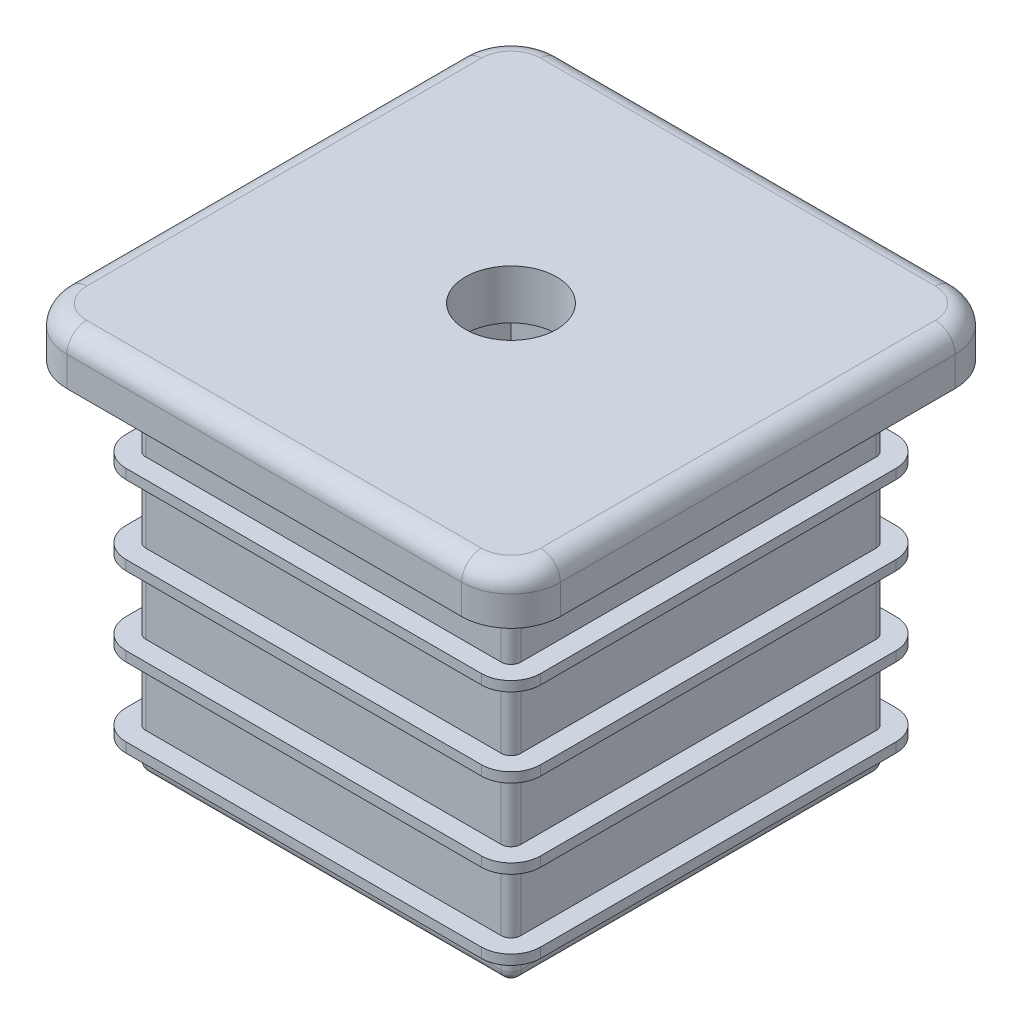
ISO-10303-21;
HEADER;
FILE_DESCRIPTION(('STEP AP214'),'2;1');
FILE_NAME('part.step','',(''),(''),'','','');
FILE_SCHEMA(('AUTOMOTIVE_DESIGN { 1 0 10303 214 1 1 1 1 }'));
ENDSEC;
DATA;
#1=APPLICATION_CONTEXT('core data for automotive mechanical design processes');
#2=APPLICATION_PROTOCOL_DEFINITION('international standard','automotive_design',2000,#1);
#3=PRODUCT_CONTEXT('',#1,'mechanical');
#4=PRODUCT('Part','Part','',(#3));
#5=PRODUCT_RELATED_PRODUCT_CATEGORY('part','',(#4));
#6=PRODUCT_DEFINITION_FORMATION('','',#4);
#7=PRODUCT_DEFINITION_CONTEXT('part definition',#1,'design');
#8=PRODUCT_DEFINITION('design','',#6,#7);
#9=PRODUCT_DEFINITION_SHAPE('','',#8);
#10=(LENGTH_UNIT() NAMED_UNIT(*) SI_UNIT(.MILLI.,.METRE.));
#11=(NAMED_UNIT(*) PLANE_ANGLE_UNIT() SI_UNIT($,.RADIAN.));
#12=(NAMED_UNIT(*) SI_UNIT($,.STERADIAN.) SOLID_ANGLE_UNIT());
#13=UNCERTAINTY_MEASURE_WITH_UNIT(LENGTH_MEASURE(1.E-05),#10,'distance_accuracy_value','');
#14=(GEOMETRIC_REPRESENTATION_CONTEXT(3) GLOBAL_UNCERTAINTY_ASSIGNED_CONTEXT((#13)) GLOBAL_UNIT_ASSIGNED_CONTEXT((#10,
#11,#12)) REPRESENTATION_CONTEXT('',''));
#15=CARTESIAN_POINT('',(0.,0.,0.));
#16=DIRECTION('',(0.,0.,1.));
#17=DIRECTION('',(1.,0.,0.));
#18=AXIS2_PLACEMENT_3D('',#15,#16,#17);
#19=CARTESIAN_POINT('',(9.5,-18.,9.5));
#20=DIRECTION('',(-1.,0.,0.));
#21=DIRECTION('',(0.,0.,1.));
#22=AXIS2_PLACEMENT_3D('',#19,#20,#21);
#23=PLANE('',#22);
#24=DIRECTION('',(0.,0.,1.));
#25=VECTOR('',#24,1.);
#26=CARTESIAN_POINT('',(9.50000000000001,-16.,-9.));
#27=LINE('',#26,#25);
#28=CARTESIAN_POINT('',(9.50000000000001,-16.,-9.));
#29=VERTEX_POINT('',#28);
#30=CARTESIAN_POINT('',(9.5,-16.,9.));
#31=VERTEX_POINT('',#30);
#32=EDGE_CURVE('E661',#29,#31,#27,.T.);
#33=ORIENTED_EDGE('',*,*,#32,.F.);
#34=DIRECTION('',(0.,1.,0.));
#35=VECTOR('',#34,1.);
#36=CARTESIAN_POINT('',(9.50000000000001,-18.,-9.));
#37=LINE('',#36,#35);
#38=CARTESIAN_POINT('',(9.50000000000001,-12.5,-9.));
#39=VERTEX_POINT('',#38);
#40=EDGE_CURVE('E1188',#29,#39,#37,.T.);
#41=ORIENTED_EDGE('',*,*,#40,.T.);
#42=DIRECTION('',(0.,0.,1.));
#43=VECTOR('',#42,1.);
#44=CARTESIAN_POINT('',(9.50000000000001,-12.5,-9.));
#45=LINE('',#44,#43);
#46=CARTESIAN_POINT('',(9.5,-12.5,9.));
#47=VERTEX_POINT('',#46);
#48=EDGE_CURVE('E742',#39,#47,#45,.T.);
#49=ORIENTED_EDGE('',*,*,#48,.T.);
#50=DIRECTION('',(0.,1.,0.));
#51=VECTOR('',#50,1.);
#52=CARTESIAN_POINT('',(9.5,-18.,9.));
#53=LINE('',#52,#51);
#54=EDGE_CURVE('E1438',#47,#31,#53,.F.);
#55=ORIENTED_EDGE('',*,*,#54,.T.);
#56=EDGE_LOOP('',(#33,#41,#49,#55));
#57=FACE_BOUND('',#56,.T.);
#58=ADVANCED_FACE('F58',(#57),#23,.F.);
#59=CARTESIAN_POINT('',(-9.5,-18.,9.5));
#60=DIRECTION('',(0.,0.,-1.));
#61=DIRECTION('',(-1.,0.,0.));
#62=AXIS2_PLACEMENT_3D('',#59,#60,#61);
#63=PLANE('',#62);
#64=DIRECTION('',(-1.,0.,0.));
#65=VECTOR('',#64,1.);
#66=CARTESIAN_POINT('',(9.,-16.,9.5));
#67=LINE('',#66,#65);
#68=CARTESIAN_POINT('',(9.,-16.,9.5));
#69=VERTEX_POINT('',#68);
#70=CARTESIAN_POINT('',(-9.,-16.,9.5));
#71=VERTEX_POINT('',#70);
#72=EDGE_CURVE('E665',#69,#71,#67,.T.);
#73=ORIENTED_EDGE('',*,*,#72,.F.);
#74=DIRECTION('',(0.,1.,0.));
#75=VECTOR('',#74,1.);
#76=CARTESIAN_POINT('',(9.,-18.,9.5));
#77=LINE('',#76,#75);
#78=CARTESIAN_POINT('',(9.,-12.5,9.5));
#79=VERTEX_POINT('',#78);
#80=EDGE_CURVE('E1175',#69,#79,#77,.T.);
#81=ORIENTED_EDGE('',*,*,#80,.T.);
#82=DIRECTION('',(-1.,0.,0.));
#83=VECTOR('',#82,1.);
#84=CARTESIAN_POINT('',(9.,-12.5,9.5));
#85=LINE('',#84,#83);
#86=CARTESIAN_POINT('',(-9.,-12.5,9.5));
#87=VERTEX_POINT('',#86);
#88=EDGE_CURVE('E748',#79,#87,#85,.T.);
#89=ORIENTED_EDGE('',*,*,#88,.T.);
#90=DIRECTION('',(0.,1.,0.));
#91=VECTOR('',#90,1.);
#92=CARTESIAN_POINT('',(-9.,-18.,9.5));
#93=LINE('',#92,#91);
#94=EDGE_CURVE('E1404',#87,#71,#93,.F.);
#95=ORIENTED_EDGE('',*,*,#94,.T.);
#96=EDGE_LOOP('',(#73,#81,#89,#95));
#97=FACE_BOUND('',#96,.T.);
#98=ADVANCED_FACE('F1287',(#97),#63,.F.);
#99=CARTESIAN_POINT('',(9.,-18.,9.));
#100=DIRECTION('',(0.,1.,0.));
#101=DIRECTION('',(0.,0.,1.));
#102=AXIS2_PLACEMENT_3D('',#99,#100,#101);
#103=CYLINDRICAL_SURFACE('',#102,0.5);
#104=ORIENTED_EDGE('',*,*,#80,.F.);
#105=CARTESIAN_POINT('',(9.,-16.,9.));
#106=DIRECTION('',(0.,-1.,0.));
#107=DIRECTION('',(0.,0.,-1.));
#108=AXIS2_PLACEMENT_3D('',#105,#106,#107);
#109=CIRCLE('',#108,0.5);
#110=EDGE_CURVE('E663',#31,#69,#109,.T.);
#111=ORIENTED_EDGE('',*,*,#110,.F.);
#112=ORIENTED_EDGE('',*,*,#54,.F.);
#113=CARTESIAN_POINT('',(9.,-12.5,9.));
#114=DIRECTION('',(0.,-1.,0.));
#115=DIRECTION('',(0.,0.,-1.));
#116=AXIS2_PLACEMENT_3D('',#113,#114,#115);
#117=CIRCLE('',#116,0.5);
#118=EDGE_CURVE('E745',#47,#79,#117,.T.);
#119=ORIENTED_EDGE('',*,*,#118,.T.);
#120=EDGE_LOOP('',(#104,#111,#112,#119));
#121=FACE_BOUND('',#120,.T.);
#122=ADVANCED_FACE('F1293',(#121),#103,.T.);
#123=CARTESIAN_POINT('',(-9.5,-18.,9.5));
#124=DIRECTION('',(1.,0.,0.));
#125=DIRECTION('',(0.,0.,-1.));
#126=AXIS2_PLACEMENT_3D('',#123,#124,#125);
#127=PLANE('',#126);
#128=DIRECTION('',(0.,0.,-1.));
#129=VECTOR('',#128,1.);
#130=CARTESIAN_POINT('',(-9.5,-16.,9.));
#131=LINE('',#130,#129);
#132=CARTESIAN_POINT('',(-9.5,-16.,9.));
#133=VERTEX_POINT('',#132);
#134=CARTESIAN_POINT('',(-9.49999999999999,-16.,-9.));
#135=VERTEX_POINT('',#134);
#136=EDGE_CURVE('E653',#133,#135,#131,.T.);
#137=ORIENTED_EDGE('',*,*,#136,.F.);
#138=DIRECTION('',(0.,1.,0.));
#139=VECTOR('',#138,1.);
#140=CARTESIAN_POINT('',(-9.5,-18.,9.));
#141=LINE('',#140,#139);
#142=CARTESIAN_POINT('',(-9.5,-12.5,9.));
#143=VERTEX_POINT('',#142);
#144=EDGE_CURVE('E1171',#133,#143,#141,.T.);
#145=ORIENTED_EDGE('',*,*,#144,.T.);
#146=DIRECTION('',(0.,0.,-1.));
#147=VECTOR('',#146,1.);
#148=CARTESIAN_POINT('',(-9.5,-12.5,9.));
#149=LINE('',#148,#147);
#150=CARTESIAN_POINT('',(-9.49999999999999,-12.5,-9.));
#151=VERTEX_POINT('',#150);
#152=EDGE_CURVE('E729',#143,#151,#149,.T.);
#153=ORIENTED_EDGE('',*,*,#152,.T.);
#154=DIRECTION('',(0.,1.,0.));
#155=VECTOR('',#154,1.);
#156=CARTESIAN_POINT('',(-9.49999999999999,-18.,-9.));
#157=LINE('',#156,#155);
#158=EDGE_CURVE('E1474',#151,#135,#157,.F.);
#159=ORIENTED_EDGE('',*,*,#158,.T.);
#160=EDGE_LOOP('',(#137,#145,#153,#159));
#161=FACE_BOUND('',#160,.T.);
#162=ADVANCED_FACE('F1392',(#161),#127,.F.);
#163=CARTESIAN_POINT('',(-9.,-18.,9.));
#164=DIRECTION('',(0.,1.,0.));
#165=DIRECTION('',(0.,0.,1.));
#166=AXIS2_PLACEMENT_3D('',#163,#164,#165);
#167=CYLINDRICAL_SURFACE('',#166,0.5);
#168=ORIENTED_EDGE('',*,*,#144,.F.);
#169=CARTESIAN_POINT('',(-9.,-16.,9.));
#170=DIRECTION('',(0.,-1.,0.));
#171=DIRECTION('',(0.,0.,-1.));
#172=AXIS2_PLACEMENT_3D('',#169,#170,#171);
#173=CIRCLE('',#172,0.5);
#174=EDGE_CURVE('E651',#71,#133,#173,.T.);
#175=ORIENTED_EDGE('',*,*,#174,.F.);
#176=ORIENTED_EDGE('',*,*,#94,.F.);
#177=CARTESIAN_POINT('',(-9.,-12.5,9.));
#178=DIRECTION('',(0.,-1.,0.));
#179=DIRECTION('',(0.,0.,-1.));
#180=AXIS2_PLACEMENT_3D('',#177,#178,#179);
#181=CIRCLE('',#180,0.5);
#182=EDGE_CURVE('E726',#87,#143,#181,.T.);
#183=ORIENTED_EDGE('',*,*,#182,.T.);
#184=EDGE_LOOP('',(#168,#175,#176,#183));
#185=FACE_BOUND('',#184,.T.);
#186=ADVANCED_FACE('F1402',(#185),#167,.T.);
#187=CARTESIAN_POINT('',(-9.49999999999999,-18.,-9.5));
#188=DIRECTION('',(0.,0.,1.));
#189=DIRECTION('',(1.,0.,0.));
#190=AXIS2_PLACEMENT_3D('',#187,#188,#189);
#191=PLANE('',#190);
#192=DIRECTION('',(1.,0.,0.));
#193=VECTOR('',#192,1.);
#194=CARTESIAN_POINT('',(-8.99999999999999,-16.,-9.5));
#195=LINE('',#194,#193);
#196=CARTESIAN_POINT('',(-8.99999999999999,-16.,-9.5));
#197=VERTEX_POINT('',#196);
#198=CARTESIAN_POINT('',(9.00000000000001,-16.,-9.5));
#199=VERTEX_POINT('',#198);
#200=EDGE_CURVE('E657',#197,#199,#195,.T.);
#201=ORIENTED_EDGE('',*,*,#200,.F.);
#202=DIRECTION('',(0.,1.,0.));
#203=VECTOR('',#202,1.);
#204=CARTESIAN_POINT('',(-8.99999999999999,-18.,-9.5));
#205=LINE('',#204,#203);
#206=CARTESIAN_POINT('',(-8.99999999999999,-12.5,-9.5));
#207=VERTEX_POINT('',#206);
#208=EDGE_CURVE('E1184',#197,#207,#205,.T.);
#209=ORIENTED_EDGE('',*,*,#208,.T.);
#210=DIRECTION('',(1.,0.,0.));
#211=VECTOR('',#210,1.);
#212=CARTESIAN_POINT('',(-8.99999999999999,-12.5,-9.5));
#213=LINE('',#212,#211);
#214=CARTESIAN_POINT('',(9.00000000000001,-12.5,-9.5));
#215=VERTEX_POINT('',#214);
#216=EDGE_CURVE('E736',#207,#215,#213,.T.);
#217=ORIENTED_EDGE('',*,*,#216,.T.);
#218=DIRECTION('',(0.,1.,0.));
#219=VECTOR('',#218,1.);
#220=CARTESIAN_POINT('',(9.00000000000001,-18.,-9.5));
#221=LINE('',#220,#219);
#222=EDGE_CURVE('E627',#215,#199,#221,.F.);
#223=ORIENTED_EDGE('',*,*,#222,.T.);
#224=EDGE_LOOP('',(#201,#209,#217,#223));
#225=FACE_BOUND('',#224,.T.);
#226=ADVANCED_FACE('F1485',(#225),#191,.F.);
#227=CARTESIAN_POINT('',(-8.99999999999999,-18.,-9.));
#228=DIRECTION('',(0.,1.,0.));
#229=DIRECTION('',(0.,0.,1.));
#230=AXIS2_PLACEMENT_3D('',#227,#228,#229);
#231=CYLINDRICAL_SURFACE('',#230,0.5);
#232=ORIENTED_EDGE('',*,*,#208,.F.);
#233=CARTESIAN_POINT('',(-8.99999999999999,-16.,-9.));
#234=DIRECTION('',(0.,-1.,0.));
#235=DIRECTION('',(0.,0.,-1.));
#236=AXIS2_PLACEMENT_3D('',#233,#234,#235);
#237=CIRCLE('',#236,0.5);
#238=EDGE_CURVE('E655',#135,#197,#237,.T.);
#239=ORIENTED_EDGE('',*,*,#238,.F.);
#240=ORIENTED_EDGE('',*,*,#158,.F.);
#241=CARTESIAN_POINT('',(-8.99999999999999,-12.5,-9.));
#242=DIRECTION('',(0.,-1.,0.));
#243=DIRECTION('',(0.,0.,-1.));
#244=AXIS2_PLACEMENT_3D('',#241,#242,#243);
#245=CIRCLE('',#244,0.5);
#246=EDGE_CURVE('E733',#151,#207,#245,.T.);
#247=ORIENTED_EDGE('',*,*,#246,.T.);
#248=EDGE_LOOP('',(#232,#239,#240,#247));
#249=FACE_BOUND('',#248,.T.);
#250=ADVANCED_FACE('F1478',(#249),#231,.T.);
#251=CARTESIAN_POINT('',(9.00000000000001,-18.,-9.));
#252=DIRECTION('',(0.,1.,0.));
#253=DIRECTION('',(0.,0.,1.));
#254=AXIS2_PLACEMENT_3D('',#251,#252,#253);
#255=CYLINDRICAL_SURFACE('',#254,0.5);
#256=ORIENTED_EDGE('',*,*,#40,.F.);
#257=CARTESIAN_POINT('',(9.00000000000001,-16.,-9.));
#258=DIRECTION('',(0.,-1.,0.));
#259=DIRECTION('',(0.,0.,-1.));
#260=AXIS2_PLACEMENT_3D('',#257,#258,#259);
#261=CIRCLE('',#260,0.5);
#262=EDGE_CURVE('E659',#199,#29,#261,.T.);
#263=ORIENTED_EDGE('',*,*,#262,.F.);
#264=ORIENTED_EDGE('',*,*,#222,.F.);
#265=CARTESIAN_POINT('',(9.00000000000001,-12.5,-9.));
#266=DIRECTION('',(0.,-1.,0.));
#267=DIRECTION('',(0.,0.,-1.));
#268=AXIS2_PLACEMENT_3D('',#265,#266,#267);
#269=CIRCLE('',#268,0.5);
#270=EDGE_CURVE('E739',#215,#39,#269,.T.);
#271=ORIENTED_EDGE('',*,*,#270,.T.);
#272=EDGE_LOOP('',(#256,#263,#264,#271));
#273=FACE_BOUND('',#272,.T.);
#274=ADVANCED_FACE('F1511',(#273),#255,.T.);
#275=CARTESIAN_POINT('',(9.50000000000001,-12.,-9.));
#276=VERTEX_POINT('',#275);
#277=CARTESIAN_POINT('',(9.50000000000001,-8.5,-9.));
#278=VERTEX_POINT('',#277);
#279=EDGE_CURVE('E1311',#276,#278,#37,.T.);
#280=ORIENTED_EDGE('',*,*,#279,.F.);
#281=CARTESIAN_POINT('',(9.00000000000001,-12.,-9.));
#282=DIRECTION('',(0.,-1.,0.));
#283=DIRECTION('',(0.,0.,-1.));
#284=AXIS2_PLACEMENT_3D('',#281,#282,#283);
#285=CIRCLE('',#284,0.5);
#286=CARTESIAN_POINT('',(9.00000000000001,-12.,-9.5));
#287=VERTEX_POINT('',#286);
#288=EDGE_CURVE('E763',#287,#276,#285,.T.);
#289=ORIENTED_EDGE('',*,*,#288,.F.);
#290=CARTESIAN_POINT('',(9.00000000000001,-8.5,-9.5));
#291=VERTEX_POINT('',#290);
#292=EDGE_CURVE('E1327',#291,#287,#221,.F.);
#293=ORIENTED_EDGE('',*,*,#292,.F.);
#294=CARTESIAN_POINT('',(9.00000000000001,-8.5,-9.));
#295=DIRECTION('',(0.,-1.,0.));
#296=DIRECTION('',(0.,0.,-1.));
#297=AXIS2_PLACEMENT_3D('',#294,#295,#296);
#298=CIRCLE('',#297,0.5);
#299=EDGE_CURVE('E844',#291,#278,#298,.T.);
#300=ORIENTED_EDGE('',*,*,#299,.T.);
#301=EDGE_LOOP('',(#280,#289,#293,#300));
#302=FACE_BOUND('',#301,.T.);
#303=ADVANCED_FACE('F1317',(#302),#255,.T.);
#304=CARTESIAN_POINT('',(-8.99999999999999,-12.,-9.5));
#305=VERTEX_POINT('',#304);
#306=CARTESIAN_POINT('',(-8.99999999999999,-8.5,-9.5));
#307=VERTEX_POINT('',#306);
#308=EDGE_CURVE('E1326',#305,#307,#205,.T.);
#309=ORIENTED_EDGE('',*,*,#308,.F.);
#310=CARTESIAN_POINT('',(-8.99999999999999,-12.,-9.));
#311=DIRECTION('',(0.,-1.,0.));
#312=DIRECTION('',(0.,0.,-1.));
#313=AXIS2_PLACEMENT_3D('',#310,#311,#312);
#314=CIRCLE('',#313,0.5);
#315=CARTESIAN_POINT('',(-9.49999999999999,-12.,-9.));
#316=VERTEX_POINT('',#315);
#317=EDGE_CURVE('E757',#316,#305,#314,.T.);
#318=ORIENTED_EDGE('',*,*,#317,.F.);
#319=CARTESIAN_POINT('',(-9.49999999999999,-8.5,-9.));
#320=VERTEX_POINT('',#319);
#321=EDGE_CURVE('E1473',#320,#316,#157,.F.);
#322=ORIENTED_EDGE('',*,*,#321,.F.);
#323=CARTESIAN_POINT('',(-8.99999999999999,-8.5,-9.));
#324=DIRECTION('',(0.,-1.,0.));
#325=DIRECTION('',(0.,0.,-1.));
#326=AXIS2_PLACEMENT_3D('',#323,#324,#325);
#327=CIRCLE('',#326,0.5);
#328=EDGE_CURVE('E838',#320,#307,#327,.T.);
#329=ORIENTED_EDGE('',*,*,#328,.T.);
#330=EDGE_LOOP('',(#309,#318,#322,#329));
#331=FACE_BOUND('',#330,.T.);
#332=ADVANCED_FACE('F1329',(#331),#231,.T.);
#333=DIRECTION('',(1.,0.,0.));
#334=VECTOR('',#333,1.);
#335=CARTESIAN_POINT('',(-8.99999999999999,-12.,-9.5));
#336=LINE('',#335,#334);
#337=EDGE_CURVE('E760',#305,#287,#336,.T.);
#338=ORIENTED_EDGE('',*,*,#337,.F.);
#339=ORIENTED_EDGE('',*,*,#308,.T.);
#340=DIRECTION('',(1.,0.,0.));
#341=VECTOR('',#340,1.);
#342=CARTESIAN_POINT('',(-8.99999999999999,-8.5,-9.5));
#343=LINE('',#342,#341);
#344=EDGE_CURVE('E841',#307,#291,#343,.T.);
#345=ORIENTED_EDGE('',*,*,#344,.T.);
#346=ORIENTED_EDGE('',*,*,#292,.T.);
#347=EDGE_LOOP('',(#338,#339,#345,#346));
#348=FACE_BOUND('',#347,.T.);
#349=ADVANCED_FACE('F1325',(#348),#191,.F.);
#350=CARTESIAN_POINT('',(-9.5,-12.,9.));
#351=VERTEX_POINT('',#350);
#352=CARTESIAN_POINT('',(-9.5,-8.5,9.));
#353=VERTEX_POINT('',#352);
#354=EDGE_CURVE('E1382',#351,#353,#141,.T.);
#355=ORIENTED_EDGE('',*,*,#354,.F.);
#356=CARTESIAN_POINT('',(-9.,-12.,9.));
#357=DIRECTION('',(0.,-1.,0.));
#358=DIRECTION('',(0.,0.,-1.));
#359=AXIS2_PLACEMENT_3D('',#356,#357,#358);
#360=CIRCLE('',#359,0.5);
#361=CARTESIAN_POINT('',(-9.,-12.,9.5));
#362=VERTEX_POINT('',#361);
#363=EDGE_CURVE('E725',#362,#351,#360,.T.);
#364=ORIENTED_EDGE('',*,*,#363,.F.);
#365=CARTESIAN_POINT('',(-9.,-8.5,9.5));
#366=VERTEX_POINT('',#365);
#367=EDGE_CURVE('E1406',#366,#362,#93,.F.);
#368=ORIENTED_EDGE('',*,*,#367,.F.);
#369=CARTESIAN_POINT('',(-9.,-8.5,9.));
#370=DIRECTION('',(0.,-1.,0.));
#371=DIRECTION('',(0.,0.,-1.));
#372=AXIS2_PLACEMENT_3D('',#369,#370,#371);
#373=CIRCLE('',#372,0.5);
#374=EDGE_CURVE('E832',#366,#353,#373,.T.);
#375=ORIENTED_EDGE('',*,*,#374,.T.);
#376=EDGE_LOOP('',(#355,#364,#368,#375));
#377=FACE_BOUND('',#376,.T.);
#378=ADVANCED_FACE('F1503',(#377),#167,.T.);
#379=DIRECTION('',(0.,0.,-1.));
#380=VECTOR('',#379,1.);
#381=CARTESIAN_POINT('',(-9.5,-12.,9.));
#382=LINE('',#381,#380);
#383=EDGE_CURVE('E754',#351,#316,#382,.T.);
#384=ORIENTED_EDGE('',*,*,#383,.F.);
#385=ORIENTED_EDGE('',*,*,#354,.T.);
#386=DIRECTION('',(0.,0.,-1.));
#387=VECTOR('',#386,1.);
#388=CARTESIAN_POINT('',(-9.5,-8.5,9.));
#389=LINE('',#388,#387);
#390=EDGE_CURVE('E835',#353,#320,#389,.T.);
#391=ORIENTED_EDGE('',*,*,#390,.T.);
#392=ORIENTED_EDGE('',*,*,#321,.T.);
#393=EDGE_LOOP('',(#384,#385,#391,#392));
#394=FACE_BOUND('',#393,.T.);
#395=ADVANCED_FACE('F1616',(#394),#127,.F.);
#396=CARTESIAN_POINT('',(9.,-12.,9.5));
#397=VERTEX_POINT('',#396);
#398=CARTESIAN_POINT('',(9.,-8.5,9.5));
#399=VERTEX_POINT('',#398);
#400=EDGE_CURVE('E1638',#397,#399,#77,.T.);
#401=ORIENTED_EDGE('',*,*,#400,.F.);
#402=CARTESIAN_POINT('',(9.,-12.,9.));
#403=DIRECTION('',(0.,-1.,0.));
#404=DIRECTION('',(0.,0.,-1.));
#405=AXIS2_PLACEMENT_3D('',#402,#403,#404);
#406=CIRCLE('',#405,0.5);
#407=CARTESIAN_POINT('',(9.5,-12.,9.));
#408=VERTEX_POINT('',#407);
#409=EDGE_CURVE('E769',#408,#397,#406,.T.);
#410=ORIENTED_EDGE('',*,*,#409,.F.);
#411=CARTESIAN_POINT('',(9.5,-8.5,9.));
#412=VERTEX_POINT('',#411);
#413=EDGE_CURVE('E1313',#412,#408,#53,.F.);
#414=ORIENTED_EDGE('',*,*,#413,.F.);
#415=CARTESIAN_POINT('',(9.,-8.5,9.));
#416=DIRECTION('',(0.,-1.,0.));
#417=DIRECTION('',(0.,0.,-1.));
#418=AXIS2_PLACEMENT_3D('',#415,#416,#417);
#419=CIRCLE('',#418,0.5);
#420=EDGE_CURVE('E849',#412,#399,#419,.T.);
#421=ORIENTED_EDGE('',*,*,#420,.T.);
#422=EDGE_LOOP('',(#401,#410,#414,#421));
#423=FACE_BOUND('',#422,.T.);
#424=ADVANCED_FACE('F1308',(#423),#103,.T.);
#425=DIRECTION('',(-1.,0.,0.));
#426=VECTOR('',#425,1.);
#427=CARTESIAN_POINT('',(9.,-12.,9.5));
#428=LINE('',#427,#426);
#429=EDGE_CURVE('E730',#397,#362,#428,.T.);
#430=ORIENTED_EDGE('',*,*,#429,.F.);
#431=ORIENTED_EDGE('',*,*,#400,.T.);
#432=DIRECTION('',(-1.,0.,0.));
#433=VECTOR('',#432,1.);
#434=CARTESIAN_POINT('',(9.,-8.5,9.5));
#435=LINE('',#434,#433);
#436=EDGE_CURVE('E852',#399,#366,#435,.T.);
#437=ORIENTED_EDGE('',*,*,#436,.T.);
#438=ORIENTED_EDGE('',*,*,#367,.T.);
#439=EDGE_LOOP('',(#430,#431,#437,#438));
#440=FACE_BOUND('',#439,.T.);
#441=ADVANCED_FACE('F1296',(#440),#63,.F.);
#442=DIRECTION('',(0.,0.,1.));
#443=VECTOR('',#442,1.);
#444=CARTESIAN_POINT('',(9.50000000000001,-12.,-9.));
#445=LINE('',#444,#443);
#446=EDGE_CURVE('E766',#276,#408,#445,.T.);
#447=ORIENTED_EDGE('',*,*,#446,.F.);
#448=ORIENTED_EDGE('',*,*,#279,.T.);
#449=DIRECTION('',(0.,0.,1.));
#450=VECTOR('',#449,1.);
#451=CARTESIAN_POINT('',(9.50000000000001,-8.5,-9.));
#452=LINE('',#451,#450);
#453=EDGE_CURVE('E847',#278,#412,#452,.T.);
#454=ORIENTED_EDGE('',*,*,#453,.T.);
#455=ORIENTED_EDGE('',*,*,#413,.T.);
#456=EDGE_LOOP('',(#447,#448,#454,#455));
#457=FACE_BOUND('',#456,.T.);
#458=ADVANCED_FACE('F1289',(#457),#23,.F.);
#459=DIRECTION('',(0.,0.,1.));
#460=VECTOR('',#459,1.);
#461=CARTESIAN_POINT('',(9.50000000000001,-8.,-9.));
#462=LINE('',#461,#460);
#463=CARTESIAN_POINT('',(9.50000000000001,-8.,-9.));
#464=VERTEX_POINT('',#463);
#465=CARTESIAN_POINT('',(9.5,-8.,9.));
#466=VERTEX_POINT('',#465);
#467=EDGE_CURVE('E864',#464,#466,#462,.T.);
#468=ORIENTED_EDGE('',*,*,#467,.F.);
#469=CARTESIAN_POINT('',(9.50000000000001,-4.5,-9.));
#470=VERTEX_POINT('',#469);
#471=EDGE_CURVE('E1321',#464,#470,#37,.T.);
#472=ORIENTED_EDGE('',*,*,#471,.T.);
#473=DIRECTION('',(0.,0.,1.));
#474=VECTOR('',#473,1.);
#475=CARTESIAN_POINT('',(9.50000000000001,-4.5,-9.));
#476=LINE('',#475,#474);
#477=CARTESIAN_POINT('',(9.5,-4.5,9.));
#478=VERTEX_POINT('',#477);
#479=EDGE_CURVE('E942',#470,#478,#476,.T.);
#480=ORIENTED_EDGE('',*,*,#479,.T.);
#481=EDGE_CURVE('E1193',#478,#466,#53,.F.);
#482=ORIENTED_EDGE('',*,*,#481,.T.);
#483=EDGE_LOOP('',(#468,#472,#480,#482));
#484=FACE_BOUND('',#483,.T.);
#485=ADVANCED_FACE('F1300',(#484),#23,.F.);
#486=DIRECTION('',(-1.,0.,0.));
#487=VECTOR('',#486,1.);
#488=CARTESIAN_POINT('',(9.,-8.,9.5));
#489=LINE('',#488,#487);
#490=CARTESIAN_POINT('',(9.,-8.,9.5));
#491=VERTEX_POINT('',#490);
#492=CARTESIAN_POINT('',(-9.,-8.,9.5));
#493=VERTEX_POINT('',#492);
#494=EDGE_CURVE('E836',#491,#493,#489,.T.);
#495=ORIENTED_EDGE('',*,*,#494,.F.);
#496=CARTESIAN_POINT('',(9.,-4.5,9.5));
#497=VERTEX_POINT('',#496);
#498=EDGE_CURVE('E1461',#491,#497,#77,.T.);
#499=ORIENTED_EDGE('',*,*,#498,.T.);
#500=DIRECTION('',(-1.,0.,0.));
#501=VECTOR('',#500,1.);
#502=CARTESIAN_POINT('',(9.,-4.5,9.5));
#503=LINE('',#502,#501);
#504=CARTESIAN_POINT('',(-9.,-4.5,9.5));
#505=VERTEX_POINT('',#504);
#506=EDGE_CURVE('E947',#497,#505,#503,.T.);
#507=ORIENTED_EDGE('',*,*,#506,.T.);
#508=EDGE_CURVE('E1177',#505,#493,#93,.F.);
#509=ORIENTED_EDGE('',*,*,#508,.T.);
#510=EDGE_LOOP('',(#495,#499,#507,#509));
#511=FACE_BOUND('',#510,.T.);
#512=ADVANCED_FACE('F1306',(#511),#63,.F.);
#513=DIRECTION('',(0.,0.,-1.));
#514=VECTOR('',#513,1.);
#515=CARTESIAN_POINT('',(-9.5,-8.,9.));
#516=LINE('',#515,#514);
#517=CARTESIAN_POINT('',(-9.5,-8.,9.));
#518=VERTEX_POINT('',#517);
#519=CARTESIAN_POINT('',(-9.49999999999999,-8.,-9.));
#520=VERTEX_POINT('',#519);
#521=EDGE_CURVE('E856',#518,#520,#516,.T.);
#522=ORIENTED_EDGE('',*,*,#521,.F.);
#523=CARTESIAN_POINT('',(-9.5,-4.5,9.));
#524=VERTEX_POINT('',#523);
#525=EDGE_CURVE('E1381',#518,#524,#141,.T.);
#526=ORIENTED_EDGE('',*,*,#525,.T.);
#527=DIRECTION('',(0.,0.,-1.));
#528=VECTOR('',#527,1.);
#529=CARTESIAN_POINT('',(-9.5,-4.5,9.));
#530=LINE('',#529,#528);
#531=CARTESIAN_POINT('',(-9.49999999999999,-4.5,-9.));
#532=VERTEX_POINT('',#531);
#533=EDGE_CURVE('E930',#524,#532,#530,.T.);
#534=ORIENTED_EDGE('',*,*,#533,.T.);
#535=EDGE_CURVE('E1166',#532,#520,#157,.F.);
#536=ORIENTED_EDGE('',*,*,#535,.T.);
#537=EDGE_LOOP('',(#522,#526,#534,#536));
#538=FACE_BOUND('',#537,.T.);
#539=ADVANCED_FACE('F1469',(#538),#127,.F.);
#540=DIRECTION('',(1.,0.,0.));
#541=VECTOR('',#540,1.);
#542=CARTESIAN_POINT('',(-8.99999999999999,-8.,-9.5));
#543=LINE('',#542,#541);
#544=CARTESIAN_POINT('',(-8.99999999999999,-8.,-9.5));
#545=VERTEX_POINT('',#544);
#546=CARTESIAN_POINT('',(9.00000000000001,-8.,-9.5));
#547=VERTEX_POINT('',#546);
#548=EDGE_CURVE('E860',#545,#547,#543,.T.);
#549=ORIENTED_EDGE('',*,*,#548,.F.);
#550=CARTESIAN_POINT('',(-8.99999999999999,-4.5,-9.5));
#551=VERTEX_POINT('',#550);
#552=EDGE_CURVE('E1334',#545,#551,#205,.T.);
#553=ORIENTED_EDGE('',*,*,#552,.T.);
#554=DIRECTION('',(1.,0.,0.));
#555=VECTOR('',#554,1.);
#556=CARTESIAN_POINT('',(-8.99999999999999,-4.5,-9.5));
#557=LINE('',#556,#555);
#558=CARTESIAN_POINT('',(9.00000000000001,-4.5,-9.5));
#559=VERTEX_POINT('',#558);
#560=EDGE_CURVE('E936',#551,#559,#557,.T.);
#561=ORIENTED_EDGE('',*,*,#560,.T.);
#562=EDGE_CURVE('E1181',#559,#547,#221,.F.);
#563=ORIENTED_EDGE('',*,*,#562,.T.);
#564=EDGE_LOOP('',(#549,#553,#561,#563));
#565=FACE_BOUND('',#564,.T.);
#566=ADVANCED_FACE('F1489',(#565),#191,.F.);
#567=ORIENTED_EDGE('',*,*,#525,.F.);
#568=CARTESIAN_POINT('',(-9.,-8.,9.));
#569=DIRECTION('',(0.,-1.,0.));
#570=DIRECTION('',(0.,0.,-1.));
#571=AXIS2_PLACEMENT_3D('',#568,#569,#570);
#572=CIRCLE('',#571,0.5);
#573=EDGE_CURVE('E831',#493,#518,#572,.T.);
#574=ORIENTED_EDGE('',*,*,#573,.F.);
#575=ORIENTED_EDGE('',*,*,#508,.F.);
#576=CARTESIAN_POINT('',(-9.,-4.5,9.));
#577=DIRECTION('',(0.,-1.,0.));
#578=DIRECTION('',(0.,0.,-1.));
#579=AXIS2_PLACEMENT_3D('',#576,#577,#578);
#580=CIRCLE('',#579,0.5);
#581=EDGE_CURVE('E927',#505,#524,#580,.T.);
#582=ORIENTED_EDGE('',*,*,#581,.T.);
#583=EDGE_LOOP('',(#567,#574,#575,#582));
#584=FACE_BOUND('',#583,.T.);
#585=ADVANCED_FACE('F1464',(#584),#167,.T.);
#586=ORIENTED_EDGE('',*,*,#552,.F.);
#587=CARTESIAN_POINT('',(-8.99999999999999,-8.,-9.));
#588=DIRECTION('',(0.,-1.,0.));
#589=DIRECTION('',(0.,0.,-1.));
#590=AXIS2_PLACEMENT_3D('',#587,#588,#589);
#591=CIRCLE('',#590,0.5);
#592=EDGE_CURVE('E858',#520,#545,#591,.T.);
#593=ORIENTED_EDGE('',*,*,#592,.F.);
#594=ORIENTED_EDGE('',*,*,#535,.F.);
#595=CARTESIAN_POINT('',(-8.99999999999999,-4.5,-9.));
#596=DIRECTION('',(0.,-1.,0.));
#597=DIRECTION('',(0.,0.,-1.));
#598=AXIS2_PLACEMENT_3D('',#595,#596,#597);
#599=CIRCLE('',#598,0.5);
#600=EDGE_CURVE('E933',#532,#551,#599,.T.);
#601=ORIENTED_EDGE('',*,*,#600,.T.);
#602=EDGE_LOOP('',(#586,#593,#594,#601));
#603=FACE_BOUND('',#602,.T.);
#604=ADVANCED_FACE('F1494',(#603),#231,.T.);
#605=ORIENTED_EDGE('',*,*,#498,.F.);
#606=CARTESIAN_POINT('',(9.,-8.,9.));
#607=DIRECTION('',(0.,-1.,0.));
#608=DIRECTION('',(0.,0.,-1.));
#609=AXIS2_PLACEMENT_3D('',#606,#607,#608);
#610=CIRCLE('',#609,0.5);
#611=EDGE_CURVE('E866',#466,#491,#610,.T.);
#612=ORIENTED_EDGE('',*,*,#611,.F.);
#613=ORIENTED_EDGE('',*,*,#481,.F.);
#614=CARTESIAN_POINT('',(9.,-4.5,9.));
#615=DIRECTION('',(0.,-1.,0.));
#616=DIRECTION('',(0.,0.,-1.));
#617=AXIS2_PLACEMENT_3D('',#614,#615,#616);
#618=CIRCLE('',#617,0.5);
#619=EDGE_CURVE('E944',#478,#497,#618,.T.);
#620=ORIENTED_EDGE('',*,*,#619,.T.);
#621=EDGE_LOOP('',(#605,#612,#613,#620));
#622=FACE_BOUND('',#621,.T.);
#623=ADVANCED_FACE('F1450',(#622),#103,.T.);
#624=ORIENTED_EDGE('',*,*,#471,.F.);
#625=CARTESIAN_POINT('',(9.00000000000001,-8.,-9.));
#626=DIRECTION('',(0.,-1.,0.));
#627=DIRECTION('',(0.,0.,-1.));
#628=AXIS2_PLACEMENT_3D('',#625,#626,#627);
#629=CIRCLE('',#628,0.5);
#630=EDGE_CURVE('E862',#547,#464,#629,.T.);
#631=ORIENTED_EDGE('',*,*,#630,.F.);
#632=ORIENTED_EDGE('',*,*,#562,.F.);
#633=CARTESIAN_POINT('',(9.00000000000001,-4.5,-9.));
#634=DIRECTION('',(0.,-1.,0.));
#635=DIRECTION('',(0.,0.,-1.));
#636=AXIS2_PLACEMENT_3D('',#633,#634,#635);
#637=CIRCLE('',#636,0.5);
#638=EDGE_CURVE('E939',#559,#470,#637,.T.);
#639=ORIENTED_EDGE('',*,*,#638,.T.);
#640=EDGE_LOOP('',(#624,#631,#632,#639));
#641=FACE_BOUND('',#640,.T.);
#642=ADVANCED_FACE('F1493',(#641),#255,.T.);
#643=CARTESIAN_POINT('',(-9.,-4.5,9.));
#644=DIRECTION('',(0.,-1.,0.));
#645=DIRECTION('',(0.,0.,-1.));
#646=AXIS2_PLACEMENT_3D('',#643,#644,#645);
#647=PLANE('',#646);
#648=CARTESIAN_POINT('',(-9.,-4.5,9.));
#649=DIRECTION('',(0.,-1.,0.));
#650=DIRECTION('',(0.,0.,-1.));
#651=AXIS2_PLACEMENT_3D('',#648,#649,#650);
#652=CIRCLE('',#651,1.5);
#653=CARTESIAN_POINT('',(-9.,-4.5,10.5));
#654=VERTEX_POINT('',#653);
#655=CARTESIAN_POINT('',(-10.5,-4.5,9.));
#656=VERTEX_POINT('',#655);
#657=EDGE_CURVE('E964',#654,#656,#652,.T.);
#658=ORIENTED_EDGE('',*,*,#657,.T.);
#659=DIRECTION('',(0.,0.,-1.));
#660=VECTOR('',#659,1.);
#661=CARTESIAN_POINT('',(-10.5,-4.5,9.));
#662=LINE('',#661,#660);
#663=CARTESIAN_POINT('',(-10.5,-4.5,-9.));
#664=VERTEX_POINT('',#663);
#665=EDGE_CURVE('E967',#656,#664,#662,.T.);
#666=ORIENTED_EDGE('',*,*,#665,.T.);
#667=CARTESIAN_POINT('',(-8.99999999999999,-4.5,-9.));
#668=DIRECTION('',(0.,-1.,0.));
#669=DIRECTION('',(0.,0.,-1.));
#670=AXIS2_PLACEMENT_3D('',#667,#668,#669);
#671=CIRCLE('',#670,1.5);
#672=CARTESIAN_POINT('',(-8.99999999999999,-4.5,-10.5));
#673=VERTEX_POINT('',#672);
#674=EDGE_CURVE('E970',#664,#673,#671,.T.);
#675=ORIENTED_EDGE('',*,*,#674,.T.);
#676=DIRECTION('',(1.,0.,0.));
#677=VECTOR('',#676,1.);
#678=CARTESIAN_POINT('',(-8.99999999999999,-4.5,-10.5));
#679=LINE('',#678,#677);
#680=CARTESIAN_POINT('',(9.00000000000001,-4.5,-10.5));
#681=VERTEX_POINT('',#680);
#682=EDGE_CURVE('E972',#673,#681,#679,.T.);
#683=ORIENTED_EDGE('',*,*,#682,.T.);
#684=CARTESIAN_POINT('',(9.00000000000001,-4.5,-9.));
#685=DIRECTION('',(0.,-1.,0.));
#686=DIRECTION('',(0.,0.,-1.));
#687=AXIS2_PLACEMENT_3D('',#684,#685,#686);
#688=CIRCLE('',#687,1.5);
#689=CARTESIAN_POINT('',(10.5,-4.5,-9.));
#690=VERTEX_POINT('',#689);
#691=EDGE_CURVE('E974',#681,#690,#688,.T.);
#692=ORIENTED_EDGE('',*,*,#691,.T.);
#693=DIRECTION('',(0.,0.,1.));
#694=VECTOR('',#693,1.);
#695=CARTESIAN_POINT('',(10.5,-4.5,-9.));
#696=LINE('',#695,#694);
#697=CARTESIAN_POINT('',(10.5,-4.5,9.));
#698=VERTEX_POINT('',#697);
#699=EDGE_CURVE('E976',#690,#698,#696,.T.);
#700=ORIENTED_EDGE('',*,*,#699,.T.);
#701=CARTESIAN_POINT('',(9.,-4.5,9.));
#702=DIRECTION('',(0.,-1.,0.));
#703=DIRECTION('',(0.,0.,-1.));
#704=AXIS2_PLACEMENT_3D('',#701,#702,#703);
#705=CIRCLE('',#704,1.5);
#706=CARTESIAN_POINT('',(9.,-4.5,10.5));
#707=VERTEX_POINT('',#706);
#708=EDGE_CURVE('E978',#698,#707,#705,.T.);
#709=ORIENTED_EDGE('',*,*,#708,.T.);
#710=DIRECTION('',(-1.,0.,0.));
#711=VECTOR('',#710,1.);
#712=CARTESIAN_POINT('',(9.,-4.5,10.5));
#713=LINE('',#712,#711);
#714=EDGE_CURVE('E980',#707,#654,#713,.T.);
#715=ORIENTED_EDGE('',*,*,#714,.T.);
#716=EDGE_LOOP('',(#658,#666,#675,#683,#692,#700,#709,#715));
#717=FACE_BOUND('',#716,.T.);
#718=ORIENTED_EDGE('',*,*,#533,.F.);
#719=ORIENTED_EDGE('',*,*,#581,.F.);
#720=ORIENTED_EDGE('',*,*,#506,.F.);
#721=ORIENTED_EDGE('',*,*,#619,.F.);
#722=ORIENTED_EDGE('',*,*,#479,.F.);
#723=ORIENTED_EDGE('',*,*,#638,.F.);
#724=ORIENTED_EDGE('',*,*,#560,.F.);
#725=ORIENTED_EDGE('',*,*,#600,.F.);
#726=EDGE_LOOP('',(#718,#719,#720,#721,#722,#723,#724,#725));
#727=FACE_BOUND('',#726,.T.);
#728=ADVANCED_FACE('F1454',(#717,#727),#647,.T.);
#729=CARTESIAN_POINT('',(-9.,-4.,9.));
#730=DIRECTION('',(0.,-1.,0.));
#731=DIRECTION('',(0.,0.,-1.));
#732=AXIS2_PLACEMENT_3D('',#729,#730,#731);
#733=PLANE('',#732);
#734=CARTESIAN_POINT('',(-9.,-4.,9.));
#735=DIRECTION('',(0.,-1.,0.));
#736=DIRECTION('',(0.,0.,-1.));
#737=AXIS2_PLACEMENT_3D('',#734,#735,#736);
#738=CIRCLE('',#737,1.5);
#739=CARTESIAN_POINT('',(-9.,-4.,10.5));
#740=VERTEX_POINT('',#739);
#741=CARTESIAN_POINT('',(-10.5,-4.,9.));
#742=VERTEX_POINT('',#741);
#743=EDGE_CURVE('E949',#740,#742,#738,.T.);
#744=ORIENTED_EDGE('',*,*,#743,.F.);
#745=DIRECTION('',(-1.,0.,0.));
#746=VECTOR('',#745,1.);
#747=CARTESIAN_POINT('',(9.,-4.,10.5));
#748=LINE('',#747,#746);
#749=CARTESIAN_POINT('',(9.,-4.,10.5));
#750=VERTEX_POINT('',#749);
#751=EDGE_CURVE('E968',#750,#740,#748,.T.);
#752=ORIENTED_EDGE('',*,*,#751,.F.);
#753=CARTESIAN_POINT('',(9.,-4.,9.));
#754=DIRECTION('',(0.,-1.,0.));
#755=DIRECTION('',(0.,0.,-1.));
#756=AXIS2_PLACEMENT_3D('',#753,#754,#755);
#757=CIRCLE('',#756,1.5);
#758=CARTESIAN_POINT('',(10.5,-4.,9.));
#759=VERTEX_POINT('',#758);
#760=EDGE_CURVE('E995',#759,#750,#757,.T.);
#761=ORIENTED_EDGE('',*,*,#760,.F.);
#762=DIRECTION('',(0.,0.,1.));
#763=VECTOR('',#762,1.);
#764=CARTESIAN_POINT('',(10.5,-4.,-9.));
#765=LINE('',#764,#763);
#766=CARTESIAN_POINT('',(10.5,-4.,-9.));
#767=VERTEX_POINT('',#766);
#768=EDGE_CURVE('E993',#767,#759,#765,.T.);
#769=ORIENTED_EDGE('',*,*,#768,.F.);
#770=CARTESIAN_POINT('',(9.00000000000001,-4.,-9.));
#771=DIRECTION('',(0.,-1.,0.));
#772=DIRECTION('',(0.,0.,-1.));
#773=AXIS2_PLACEMENT_3D('',#770,#771,#772);
#774=CIRCLE('',#773,1.5);
#775=CARTESIAN_POINT('',(9.00000000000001,-4.,-10.5));
#776=VERTEX_POINT('',#775);
#777=EDGE_CURVE('E991',#776,#767,#774,.T.);
#778=ORIENTED_EDGE('',*,*,#777,.F.);
#779=DIRECTION('',(1.,0.,0.));
#780=VECTOR('',#779,1.);
#781=CARTESIAN_POINT('',(-8.99999999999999,-4.,-10.5));
#782=LINE('',#781,#780);
#783=CARTESIAN_POINT('',(-8.99999999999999,-4.,-10.5));
#784=VERTEX_POINT('',#783);
#785=EDGE_CURVE('E989',#784,#776,#782,.T.);
#786=ORIENTED_EDGE('',*,*,#785,.F.);
#787=CARTESIAN_POINT('',(-8.99999999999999,-4.,-9.));
#788=DIRECTION('',(0.,-1.,0.));
#789=DIRECTION('',(0.,0.,-1.));
#790=AXIS2_PLACEMENT_3D('',#787,#788,#789);
#791=CIRCLE('',#790,1.5);
#792=CARTESIAN_POINT('',(-10.5,-4.,-9.));
#793=VERTEX_POINT('',#792);
#794=EDGE_CURVE('E987',#793,#784,#791,.T.);
#795=ORIENTED_EDGE('',*,*,#794,.F.);
#796=DIRECTION('',(0.,0.,-1.));
#797=VECTOR('',#796,1.);
#798=CARTESIAN_POINT('',(-10.5,-4.,9.));
#799=LINE('',#798,#797);
#800=EDGE_CURVE('E985',#742,#793,#799,.T.);
#801=ORIENTED_EDGE('',*,*,#800,.F.);
#802=EDGE_LOOP('',(#744,#752,#761,#769,#778,#786,#795,#801));
#803=FACE_BOUND('',#802,.T.);
#804=CARTESIAN_POINT('',(-9.,-4.,9.));
#805=DIRECTION('',(0.,-1.,0.));
#806=DIRECTION('',(0.,0.,-1.));
#807=AXIS2_PLACEMENT_3D('',#804,#805,#806);
#808=CIRCLE('',#807,0.5);
#809=CARTESIAN_POINT('',(-9.,-4.,9.5));
#810=VERTEX_POINT('',#809);
#811=CARTESIAN_POINT('',(-9.5,-4.,9.));
#812=VERTEX_POINT('',#811);
#813=EDGE_CURVE('E926',#810,#812,#808,.T.);
#814=ORIENTED_EDGE('',*,*,#813,.T.);
#815=DIRECTION('',(0.,0.,-1.));
#816=VECTOR('',#815,1.);
#817=CARTESIAN_POINT('',(-9.5,-4.,9.));
#818=LINE('',#817,#816);
#819=CARTESIAN_POINT('',(-9.49999999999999,-4.,-9.));
#820=VERTEX_POINT('',#819);
#821=EDGE_CURVE('E951',#812,#820,#818,.T.);
#822=ORIENTED_EDGE('',*,*,#821,.T.);
#823=CARTESIAN_POINT('',(-8.99999999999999,-4.,-9.));
#824=DIRECTION('',(0.,-1.,0.));
#825=DIRECTION('',(0.,0.,-1.));
#826=AXIS2_PLACEMENT_3D('',#823,#824,#825);
#827=CIRCLE('',#826,0.5);
#828=CARTESIAN_POINT('',(-8.99999999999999,-4.,-9.5));
#829=VERTEX_POINT('',#828);
#830=EDGE_CURVE('E953',#820,#829,#827,.T.);
#831=ORIENTED_EDGE('',*,*,#830,.T.);
#832=DIRECTION('',(1.,0.,0.));
#833=VECTOR('',#832,1.);
#834=CARTESIAN_POINT('',(-8.99999999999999,-4.,-9.5));
#835=LINE('',#834,#833);
#836=CARTESIAN_POINT('',(9.00000000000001,-4.,-9.5));
#837=VERTEX_POINT('',#836);
#838=EDGE_CURVE('E955',#829,#837,#835,.T.);
#839=ORIENTED_EDGE('',*,*,#838,.T.);
#840=CARTESIAN_POINT('',(9.00000000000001,-4.,-9.));
#841=DIRECTION('',(0.,-1.,0.));
#842=DIRECTION('',(0.,0.,-1.));
#843=AXIS2_PLACEMENT_3D('',#840,#841,#842);
#844=CIRCLE('',#843,0.5);
#845=CARTESIAN_POINT('',(9.50000000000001,-4.,-9.));
#846=VERTEX_POINT('',#845);
#847=EDGE_CURVE('E957',#837,#846,#844,.T.);
#848=ORIENTED_EDGE('',*,*,#847,.T.);
#849=DIRECTION('',(0.,0.,1.));
#850=VECTOR('',#849,1.);
#851=CARTESIAN_POINT('',(9.50000000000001,-4.,-9.));
#852=LINE('',#851,#850);
#853=CARTESIAN_POINT('',(9.5,-4.,9.));
#854=VERTEX_POINT('',#853);
#855=EDGE_CURVE('E959',#846,#854,#852,.T.);
#856=ORIENTED_EDGE('',*,*,#855,.T.);
#857=CARTESIAN_POINT('',(9.,-4.,9.));
#858=DIRECTION('',(0.,-1.,0.));
#859=DIRECTION('',(0.,0.,-1.));
#860=AXIS2_PLACEMENT_3D('',#857,#858,#859);
#861=CIRCLE('',#860,0.5);
#862=CARTESIAN_POINT('',(9.,-4.,9.5));
#863=VERTEX_POINT('',#862);
#864=EDGE_CURVE('E961',#854,#863,#861,.T.);
#865=ORIENTED_EDGE('',*,*,#864,.T.);
#866=DIRECTION('',(-1.,0.,0.));
#867=VECTOR('',#866,1.);
#868=CARTESIAN_POINT('',(9.,-4.,9.5));
#869=LINE('',#868,#867);
#870=EDGE_CURVE('E931',#863,#810,#869,.T.);
#871=ORIENTED_EDGE('',*,*,#870,.T.);
#872=EDGE_LOOP('',(#814,#822,#831,#839,#848,#856,#865,#871));
#873=FACE_BOUND('',#872,.T.);
#874=ADVANCED_FACE('F1360',(#803,#873),#733,.F.);
#875=CARTESIAN_POINT('',(-9.,-4.5,9.));
#876=DIRECTION('',(0.,1.,0.));
#877=DIRECTION('',(0.,0.,1.));
#878=AXIS2_PLACEMENT_3D('',#875,#876,#877);
#879=CYLINDRICAL_SURFACE('',#878,1.5);
#880=ORIENTED_EDGE('',*,*,#743,.T.);
#881=DIRECTION('',(0.,1.,0.));
#882=VECTOR('',#881,1.);
#883=CARTESIAN_POINT('',(-10.5,-4.5,9.));
#884=LINE('',#883,#882);
#885=EDGE_CURVE('E1018',#656,#742,#884,.T.);
#886=ORIENTED_EDGE('',*,*,#885,.F.);
#887=ORIENTED_EDGE('',*,*,#657,.F.);
#888=DIRECTION('',(0.,1.,0.));
#889=VECTOR('',#888,1.);
#890=CARTESIAN_POINT('',(-9.,-4.5,10.5));
#891=LINE('',#890,#889);
#892=EDGE_CURVE('E982',#654,#740,#891,.T.);
#893=ORIENTED_EDGE('',*,*,#892,.T.);
#894=EDGE_LOOP('',(#880,#886,#887,#893));
#895=FACE_BOUND('',#894,.T.);
#896=ADVANCED_FACE('F1544',(#895),#879,.T.);
#897=CARTESIAN_POINT('',(-10.5,-4.5,9.));
#898=DIRECTION('',(1.,0.,0.));
#899=DIRECTION('',(0.,0.,-1.));
#900=AXIS2_PLACEMENT_3D('',#897,#898,#899);
#901=PLANE('',#900);
#902=ORIENTED_EDGE('',*,*,#800,.T.);
#903=DIRECTION('',(0.,1.,0.));
#904=VECTOR('',#903,1.);
#905=CARTESIAN_POINT('',(-10.5,-4.5,-9.));
#906=LINE('',#905,#904);
#907=EDGE_CURVE('E1015',#664,#793,#906,.T.);
#908=ORIENTED_EDGE('',*,*,#907,.F.);
#909=ORIENTED_EDGE('',*,*,#665,.F.);
#910=ORIENTED_EDGE('',*,*,#885,.T.);
#911=EDGE_LOOP('',(#902,#908,#909,#910));
#912=FACE_BOUND('',#911,.T.);
#913=ADVANCED_FACE('F1575',(#912),#901,.F.);
#914=CARTESIAN_POINT('',(-8.99999999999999,-4.5,-9.));
#915=DIRECTION('',(0.,1.,0.));
#916=DIRECTION('',(0.,0.,1.));
#917=AXIS2_PLACEMENT_3D('',#914,#915,#916);
#918=CYLINDRICAL_SURFACE('',#917,1.5);
#919=ORIENTED_EDGE('',*,*,#794,.T.);
#920=DIRECTION('',(0.,1.,0.));
#921=VECTOR('',#920,1.);
#922=CARTESIAN_POINT('',(-8.99999999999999,-4.5,-10.5));
#923=LINE('',#922,#921);
#924=EDGE_CURVE('E1012',#673,#784,#923,.T.);
#925=ORIENTED_EDGE('',*,*,#924,.F.);
#926=ORIENTED_EDGE('',*,*,#674,.F.);
#927=ORIENTED_EDGE('',*,*,#907,.T.);
#928=EDGE_LOOP('',(#919,#925,#926,#927));
#929=FACE_BOUND('',#928,.T.);
#930=ADVANCED_FACE('F1571',(#929),#918,.T.);
#931=CARTESIAN_POINT('',(-8.99999999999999,-4.5,-10.5));
#932=DIRECTION('',(0.,0.,1.));
#933=DIRECTION('',(1.,0.,0.));
#934=AXIS2_PLACEMENT_3D('',#931,#932,#933);
#935=PLANE('',#934);
#936=ORIENTED_EDGE('',*,*,#785,.T.);
#937=DIRECTION('',(0.,1.,0.));
#938=VECTOR('',#937,1.);
#939=CARTESIAN_POINT('',(9.00000000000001,-4.5,-10.5));
#940=LINE('',#939,#938);
#941=EDGE_CURVE('E1009',#681,#776,#940,.T.);
#942=ORIENTED_EDGE('',*,*,#941,.F.);
#943=ORIENTED_EDGE('',*,*,#682,.F.);
#944=ORIENTED_EDGE('',*,*,#924,.T.);
#945=EDGE_LOOP('',(#936,#942,#943,#944));
#946=FACE_BOUND('',#945,.T.);
#947=ADVANCED_FACE('F1567',(#946),#935,.F.);
#948=CARTESIAN_POINT('',(9.00000000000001,-4.5,-9.));
#949=DIRECTION('',(0.,1.,0.));
#950=DIRECTION('',(0.,0.,1.));
#951=AXIS2_PLACEMENT_3D('',#948,#949,#950);
#952=CYLINDRICAL_SURFACE('',#951,1.5);
#953=ORIENTED_EDGE('',*,*,#777,.T.);
#954=DIRECTION('',(0.,1.,0.));
#955=VECTOR('',#954,1.);
#956=CARTESIAN_POINT('',(10.5,-4.5,-9.));
#957=LINE('',#956,#955);
#958=EDGE_CURVE('E1006',#690,#767,#957,.T.);
#959=ORIENTED_EDGE('',*,*,#958,.F.);
#960=ORIENTED_EDGE('',*,*,#691,.F.);
#961=ORIENTED_EDGE('',*,*,#941,.T.);
#962=EDGE_LOOP('',(#953,#959,#960,#961));
#963=FACE_BOUND('',#962,.T.);
#964=ADVANCED_FACE('F1563',(#963),#952,.T.);
#965=CARTESIAN_POINT('',(10.5,-4.5,-9.));
#966=DIRECTION('',(-1.,0.,0.));
#967=DIRECTION('',(0.,0.,1.));
#968=AXIS2_PLACEMENT_3D('',#965,#966,#967);
#969=PLANE('',#968);
#970=ORIENTED_EDGE('',*,*,#768,.T.);
#971=DIRECTION('',(0.,1.,0.));
#972=VECTOR('',#971,1.);
#973=CARTESIAN_POINT('',(10.5,-4.5,9.));
#974=LINE('',#973,#972);
#975=EDGE_CURVE('E1003',#698,#759,#974,.T.);
#976=ORIENTED_EDGE('',*,*,#975,.F.);
#977=ORIENTED_EDGE('',*,*,#699,.F.);
#978=ORIENTED_EDGE('',*,*,#958,.T.);
#979=EDGE_LOOP('',(#970,#976,#977,#978));
#980=FACE_BOUND('',#979,.T.);
#981=ADVANCED_FACE('F1559',(#980),#969,.F.);
#982=CARTESIAN_POINT('',(9.,-4.5,9.));
#983=DIRECTION('',(0.,1.,0.));
#984=DIRECTION('',(0.,0.,1.));
#985=AXIS2_PLACEMENT_3D('',#982,#983,#984);
#986=CYLINDRICAL_SURFACE('',#985,1.5);
#987=ORIENTED_EDGE('',*,*,#760,.T.);
#988=DIRECTION('',(0.,1.,0.));
#989=VECTOR('',#988,1.);
#990=CARTESIAN_POINT('',(9.,-4.5,10.5));
#991=LINE('',#990,#989);
#992=EDGE_CURVE('E1000',#707,#750,#991,.T.);
#993=ORIENTED_EDGE('',*,*,#992,.F.);
#994=ORIENTED_EDGE('',*,*,#708,.F.);
#995=ORIENTED_EDGE('',*,*,#975,.T.);
#996=EDGE_LOOP('',(#987,#993,#994,#995));
#997=FACE_BOUND('',#996,.T.);
#998=ADVANCED_FACE('F1555',(#997),#986,.T.);
#999=CARTESIAN_POINT('',(9.,-4.5,10.5));
#1000=DIRECTION('',(0.,0.,-1.));
#1001=DIRECTION('',(-1.,0.,0.));
#1002=AXIS2_PLACEMENT_3D('',#999,#1000,#1001);
#1003=PLANE('',#1002);
#1004=ORIENTED_EDGE('',*,*,#751,.T.);
#1005=ORIENTED_EDGE('',*,*,#892,.F.);
#1006=ORIENTED_EDGE('',*,*,#714,.F.);
#1007=ORIENTED_EDGE('',*,*,#992,.T.);
#1008=EDGE_LOOP('',(#1004,#1005,#1006,#1007));
#1009=FACE_BOUND('',#1008,.T.);
#1010=ADVANCED_FACE('F1551',(#1009),#1003,.F.);
#1011=CARTESIAN_POINT('',(-10.,2.5,10.));
#1012=DIRECTION('',(0.,1.,0.));
#1013=DIRECTION('',(0.,0.,1.));
#1014=AXIS2_PLACEMENT_3D('',#1011,#1012,#1013);
#1015=PLANE('',#1014);
#1016=CARTESIAN_POINT('',(0.,2.5,0.));
#1017=DIRECTION('',(0.,1.,0.));
#1018=DIRECTION('',(0.,0.,1.));
#1019=AXIS2_PLACEMENT_3D('',#1016,#1017,#1018);
#1020=CIRCLE('',#1019,2.31);
#1021=CARTESIAN_POINT('',(0.,2.5,2.31));
#1022=VERTEX_POINT('',#1021);
#1023=EDGE_CURVE('E1265',#1022,#1022,#1020,.T.);
#1024=ORIENTED_EDGE('',*,*,#1023,.F.);
#1025=EDGE_LOOP('',(#1024));
#1026=FACE_BOUND('',#1025,.T.);
#1027=DIRECTION('',(0.,0.,1.));
#1028=VECTOR('',#1027,1.);
#1029=CARTESIAN_POINT('',(-11.5,2.5,9.99999999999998));
#1030=LINE('',#1029,#1028);
#1031=CARTESIAN_POINT('',(-11.5,2.5,-9.99999999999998));
#1032=VERTEX_POINT('',#1031);
#1033=CARTESIAN_POINT('',(-11.5,2.5,9.99999999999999));
#1034=VERTEX_POINT('',#1033);
#1035=EDGE_CURVE('E1119',#1032,#1034,#1030,.T.);
#1036=ORIENTED_EDGE('',*,*,#1035,.T.);
#1037=CARTESIAN_POINT('',(-10.,2.5,10.));
#1038=DIRECTION('',(0.,1.,0.));
#1039=DIRECTION('',(0.,0.,1.));
#1040=AXIS2_PLACEMENT_3D('',#1037,#1038,#1039);
#1041=CIRCLE('',#1040,1.5);
#1042=CARTESIAN_POINT('',(-9.99999999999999,2.5,11.5));
#1043=VERTEX_POINT('',#1042);
#1044=EDGE_CURVE('E1121',#1034,#1043,#1041,.T.);
#1045=ORIENTED_EDGE('',*,*,#1044,.T.);
#1046=DIRECTION('',(1.,0.,0.));
#1047=VECTOR('',#1046,1.);
#1048=CARTESIAN_POINT('',(9.99999999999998,2.5,11.5));
#1049=LINE('',#1048,#1047);
#1050=CARTESIAN_POINT('',(9.99999999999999,2.5,11.5));
#1051=VERTEX_POINT('',#1050);
#1052=EDGE_CURVE('E1107',#1043,#1051,#1049,.T.);
#1053=ORIENTED_EDGE('',*,*,#1052,.T.);
#1054=CARTESIAN_POINT('',(10.,2.5,10.));
#1055=DIRECTION('',(0.,1.,0.));
#1056=DIRECTION('',(0.,0.,1.));
#1057=AXIS2_PLACEMENT_3D('',#1054,#1055,#1056);
#1058=CIRCLE('',#1057,1.5);
#1059=CARTESIAN_POINT('',(11.5,2.5,9.99999999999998));
#1060=VERTEX_POINT('',#1059);
#1061=EDGE_CURVE('E1109',#1051,#1060,#1058,.T.);
#1062=ORIENTED_EDGE('',*,*,#1061,.T.);
#1063=DIRECTION('',(0.,0.,-1.));
#1064=VECTOR('',#1063,1.);
#1065=CARTESIAN_POINT('',(11.5,2.5,-9.99999999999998));
#1066=LINE('',#1065,#1064);
#1067=CARTESIAN_POINT('',(11.5,2.5,-9.99999999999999));
#1068=VERTEX_POINT('',#1067);
#1069=EDGE_CURVE('E1111',#1060,#1068,#1066,.T.);
#1070=ORIENTED_EDGE('',*,*,#1069,.T.);
#1071=CARTESIAN_POINT('',(9.99999999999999,2.5,-10.));
#1072=DIRECTION('',(0.,1.,0.));
#1073=DIRECTION('',(0.,0.,1.));
#1074=AXIS2_PLACEMENT_3D('',#1071,#1072,#1073);
#1075=CIRCLE('',#1074,1.5);
#1076=CARTESIAN_POINT('',(9.99999999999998,2.5,-11.5));
#1077=VERTEX_POINT('',#1076);
#1078=EDGE_CURVE('E1113',#1068,#1077,#1075,.T.);
#1079=ORIENTED_EDGE('',*,*,#1078,.T.);
#1080=DIRECTION('',(-1.,0.,0.));
#1081=VECTOR('',#1080,1.);
#1082=CARTESIAN_POINT('',(-9.99999999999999,2.5,-11.5));
#1083=LINE('',#1082,#1081);
#1084=CARTESIAN_POINT('',(-10.,2.5,-11.5));
#1085=VERTEX_POINT('',#1084);
#1086=EDGE_CURVE('E1115',#1077,#1085,#1083,.T.);
#1087=ORIENTED_EDGE('',*,*,#1086,.T.);
#1088=CARTESIAN_POINT('',(-10.,2.5,-10.));
#1089=DIRECTION('',(0.,1.,0.));
#1090=DIRECTION('',(0.,0.,1.));
#1091=AXIS2_PLACEMENT_3D('',#1088,#1089,#1090);
#1092=CIRCLE('',#1091,1.5);
#1093=EDGE_CURVE('E1117',#1085,#1032,#1092,.T.);
#1094=ORIENTED_EDGE('',*,*,#1093,.T.);
#1095=EDGE_LOOP('',(#1036,#1045,#1053,#1062,#1070,#1079,#1087,#1094));
#1096=FACE_BOUND('',#1095,.T.);
#1097=ADVANCED_FACE('F1554',(#1026,#1096),#1015,.T.);
#1098=CARTESIAN_POINT('',(-10.,1.5,11.5));
#1099=DIRECTION('',(-1.,0.,0.));
#1100=DIRECTION('',(0.,0.,1.));
#1101=AXIS2_PLACEMENT_3D('',#1098,#1099,#1100);
#1102=CYLINDRICAL_SURFACE('',#1101,1.);
#1103=CARTESIAN_POINT('',(9.99999999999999,1.5,11.5));
#1104=DIRECTION('',(-1.,0.,0.));
#1105=DIRECTION('',(0.,0.,1.));
#1106=AXIS2_PLACEMENT_3D('',#1103,#1104,#1105);
#1107=CIRCLE('',#1106,1.);
#1108=CARTESIAN_POINT('',(9.99999999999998,1.5,12.5));
#1109=VERTEX_POINT('',#1108);
#1110=EDGE_CURVE('E1145',#1109,#1051,#1107,.T.);
#1111=ORIENTED_EDGE('',*,*,#1110,.T.);
#1112=ORIENTED_EDGE('',*,*,#1052,.F.);
#1113=CARTESIAN_POINT('',(-9.99999999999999,1.5,11.5));
#1114=DIRECTION('',(-1.,0.,0.));
#1115=DIRECTION('',(0.,-1.,0.));
#1116=AXIS2_PLACEMENT_3D('',#1113,#1114,#1115);
#1117=CIRCLE('',#1116,1.);
#1118=CARTESIAN_POINT('',(-9.99999999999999,1.5,12.5));
#1119=VERTEX_POINT('',#1118);
#1120=EDGE_CURVE('E1065',#1119,#1043,#1117,.T.);
#1121=ORIENTED_EDGE('',*,*,#1120,.F.);
#1122=DIRECTION('',(1.,0.,0.));
#1123=VECTOR('',#1122,1.);
#1124=CARTESIAN_POINT('',(-9.99999999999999,1.5,12.5));
#1125=LINE('',#1124,#1123);
#1126=EDGE_CURVE('E1139',#1109,#1119,#1125,.F.);
#1127=ORIENTED_EDGE('',*,*,#1126,.F.);
#1128=EDGE_LOOP('',(#1111,#1112,#1121,#1127));
#1129=FACE_BOUND('',#1128,.T.);
#1130=ADVANCED_FACE('F2074',(#1129),#1102,.T.);
#1131=CARTESIAN_POINT('',(10.,1.5,10.));
#1132=DIRECTION('',(0.,1.,0.));
#1133=DIRECTION('',(0.,0.,1.));
#1134=AXIS2_PLACEMENT_3D('',#1131,#1132,#1133);
#1135=TOROIDAL_SURFACE('',#1134,1.5,1.);
#1136=CARTESIAN_POINT('',(11.5,1.5,9.99999999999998));
#1137=DIRECTION('',(0.,0.,1.));
#1138=DIRECTION('',(1.,0.,0.));
#1139=AXIS2_PLACEMENT_3D('',#1136,#1137,#1138);
#1140=CIRCLE('',#1139,1.);
#1141=CARTESIAN_POINT('',(12.5,1.5,9.99999999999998));
#1142=VERTEX_POINT('',#1141);
#1143=EDGE_CURVE('E1151',#1142,#1060,#1140,.T.);
#1144=ORIENTED_EDGE('',*,*,#1143,.T.);
#1145=ORIENTED_EDGE('',*,*,#1061,.F.);
#1146=ORIENTED_EDGE('',*,*,#1110,.F.);
#1147=CARTESIAN_POINT('',(10.,1.5,10.));
#1148=DIRECTION('',(0.,1.,0.));
#1149=DIRECTION('',(0.,0.,1.));
#1150=AXIS2_PLACEMENT_3D('',#1147,#1148,#1149);
#1151=CIRCLE('',#1150,2.5);
#1152=EDGE_CURVE('E1137',#1142,#1109,#1151,.F.);
#1153=ORIENTED_EDGE('',*,*,#1152,.F.);
#1154=EDGE_LOOP('',(#1144,#1145,#1146,#1153));
#1155=FACE_BOUND('',#1154,.T.);
#1156=ADVANCED_FACE('F2078',(#1155),#1135,.T.);
#1157=CARTESIAN_POINT('',(11.5,1.5,9.99999999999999));
#1158=DIRECTION('',(0.,0.,1.));
#1159=DIRECTION('',(1.,0.,0.));
#1160=AXIS2_PLACEMENT_3D('',#1157,#1158,#1159);
#1161=CYLINDRICAL_SURFACE('',#1160,1.);
#1162=CARTESIAN_POINT('',(11.5,1.5,-9.99999999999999));
#1163=DIRECTION('',(0.,0.,1.));
#1164=DIRECTION('',(1.,0.,0.));
#1165=AXIS2_PLACEMENT_3D('',#1162,#1163,#1164);
#1166=CIRCLE('',#1165,1.);
#1167=CARTESIAN_POINT('',(12.5,1.5,-9.99999999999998));
#1168=VERTEX_POINT('',#1167);
#1169=EDGE_CURVE('E1157',#1168,#1068,#1166,.T.);
#1170=ORIENTED_EDGE('',*,*,#1169,.T.);
#1171=ORIENTED_EDGE('',*,*,#1069,.F.);
#1172=ORIENTED_EDGE('',*,*,#1143,.F.);
#1173=DIRECTION('',(0.,0.,-1.));
#1174=VECTOR('',#1173,1.);
#1175=CARTESIAN_POINT('',(12.5,1.5,9.99999999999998));
#1176=LINE('',#1175,#1174);
#1177=EDGE_CURVE('E1135',#1168,#1142,#1176,.F.);
#1178=ORIENTED_EDGE('',*,*,#1177,.F.);
#1179=EDGE_LOOP('',(#1170,#1171,#1172,#1178));
#1180=FACE_BOUND('',#1179,.T.);
#1181=ADVANCED_FACE('F2098',(#1180),#1161,.T.);
#1182=CARTESIAN_POINT('',(9.99999999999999,1.5,-10.));
#1183=DIRECTION('',(0.,1.,0.));
#1184=DIRECTION('',(0.,0.,1.));
#1185=AXIS2_PLACEMENT_3D('',#1182,#1183,#1184);
#1186=TOROIDAL_SURFACE('',#1185,1.5,1.);
#1187=ORIENTED_EDGE('',*,*,#1169,.F.);
#1188=CARTESIAN_POINT('',(9.99999999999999,1.5,-10.));
#1189=DIRECTION('',(0.,1.,0.));
#1190=DIRECTION('',(0.,0.,1.));
#1191=AXIS2_PLACEMENT_3D('',#1188,#1189,#1190);
#1192=CIRCLE('',#1191,2.5);
#1193=CARTESIAN_POINT('',(9.99999999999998,1.5,-12.5));
#1194=VERTEX_POINT('',#1193);
#1195=EDGE_CURVE('E1133',#1194,#1168,#1192,.F.);
#1196=ORIENTED_EDGE('',*,*,#1195,.F.);
#1197=CARTESIAN_POINT('',(9.99999999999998,1.5,-11.5));
#1198=DIRECTION('',(-1.,0.,0.));
#1199=DIRECTION('',(0.,0.,1.));
#1200=AXIS2_PLACEMENT_3D('',#1197,#1198,#1199);
#1201=CIRCLE('',#1200,1.);
#1202=EDGE_CURVE('E1070',#1077,#1194,#1201,.T.);
#1203=ORIENTED_EDGE('',*,*,#1202,.F.);
#1204=ORIENTED_EDGE('',*,*,#1078,.F.);
#1205=EDGE_LOOP('',(#1187,#1196,#1203,#1204));
#1206=FACE_BOUND('',#1205,.T.);
#1207=ADVANCED_FACE('F2118',(#1206),#1186,.T.);
#1208=CARTESIAN_POINT('',(-10.,1.5,-11.5));
#1209=DIRECTION('',(1.,0.,0.));
#1210=DIRECTION('',(0.,0.,-1.));
#1211=AXIS2_PLACEMENT_3D('',#1208,#1209,#1210);
#1212=CYLINDRICAL_SURFACE('',#1211,1.);
#1213=ORIENTED_EDGE('',*,*,#1202,.T.);
#1214=DIRECTION('',(-1.,0.,0.));
#1215=VECTOR('',#1214,1.);
#1216=CARTESIAN_POINT('',(9.99999999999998,1.5,-12.5));
#1217=LINE('',#1216,#1215);
#1218=CARTESIAN_POINT('',(-9.99999999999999,1.5,-12.5));
#1219=VERTEX_POINT('',#1218);
#1220=EDGE_CURVE('E1131',#1219,#1194,#1217,.F.);
#1221=ORIENTED_EDGE('',*,*,#1220,.F.);
#1222=CARTESIAN_POINT('',(-10.,1.5,-11.5));
#1223=DIRECTION('',(-1.,0.,0.));
#1224=DIRECTION('',(0.,0.,1.));
#1225=AXIS2_PLACEMENT_3D('',#1222,#1223,#1224);
#1226=CIRCLE('',#1225,1.);
#1227=EDGE_CURVE('E1154',#1085,#1219,#1226,.T.);
#1228=ORIENTED_EDGE('',*,*,#1227,.F.);
#1229=ORIENTED_EDGE('',*,*,#1086,.F.);
#1230=EDGE_LOOP('',(#1213,#1221,#1228,#1229));
#1231=FACE_BOUND('',#1230,.T.);
#1232=ADVANCED_FACE('F2108',(#1231),#1212,.T.);
#1233=CARTESIAN_POINT('',(-10.,1.5,-10.));
#1234=DIRECTION('',(0.,1.,0.));
#1235=DIRECTION('',(0.,0.,1.));
#1236=AXIS2_PLACEMENT_3D('',#1233,#1234,#1235);
#1237=TOROIDAL_SURFACE('',#1236,1.5,1.);
#1238=ORIENTED_EDGE('',*,*,#1227,.T.);
#1239=CARTESIAN_POINT('',(-10.,1.5,-10.));
#1240=DIRECTION('',(0.,1.,0.));
#1241=DIRECTION('',(0.,0.,1.));
#1242=AXIS2_PLACEMENT_3D('',#1239,#1240,#1241);
#1243=CIRCLE('',#1242,2.5);
#1244=CARTESIAN_POINT('',(-12.5,1.5,-9.99999999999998));
#1245=VERTEX_POINT('',#1244);
#1246=EDGE_CURVE('E1129',#1245,#1219,#1243,.F.);
#1247=ORIENTED_EDGE('',*,*,#1246,.F.);
#1248=CARTESIAN_POINT('',(-11.5,1.5,-9.99999999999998));
#1249=DIRECTION('',(0.,0.,1.));
#1250=DIRECTION('',(1.,0.,0.));
#1251=AXIS2_PLACEMENT_3D('',#1248,#1249,#1250);
#1252=CIRCLE('',#1251,1.);
#1253=EDGE_CURVE('E1148',#1032,#1245,#1252,.T.);
#1254=ORIENTED_EDGE('',*,*,#1253,.F.);
#1255=ORIENTED_EDGE('',*,*,#1093,.F.);
#1256=EDGE_LOOP('',(#1238,#1247,#1254,#1255));
#1257=FACE_BOUND('',#1256,.T.);
#1258=ADVANCED_FACE('F2088',(#1257),#1237,.T.);
#1259=CARTESIAN_POINT('',(-11.5,1.5,10.));
#1260=DIRECTION('',(0.,0.,-1.));
#1261=DIRECTION('',(-1.,0.,0.));
#1262=AXIS2_PLACEMENT_3D('',#1259,#1260,#1261);
#1263=CYLINDRICAL_SURFACE('',#1262,1.);
#1264=ORIENTED_EDGE('',*,*,#1253,.T.);
#1265=DIRECTION('',(0.,0.,1.));
#1266=VECTOR('',#1265,1.);
#1267=CARTESIAN_POINT('',(-12.5,1.5,-9.99999999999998));
#1268=LINE('',#1267,#1266);
#1269=CARTESIAN_POINT('',(-12.5,1.5,9.99999999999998));
#1270=VERTEX_POINT('',#1269);
#1271=EDGE_CURVE('E1127',#1270,#1245,#1268,.F.);
#1272=ORIENTED_EDGE('',*,*,#1271,.F.);
#1273=CARTESIAN_POINT('',(-11.5,1.5,9.99999999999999));
#1274=DIRECTION('',(0.,0.,1.));
#1275=DIRECTION('',(1.,0.,0.));
#1276=AXIS2_PLACEMENT_3D('',#1273,#1274,#1275);
#1277=CIRCLE('',#1276,1.);
#1278=EDGE_CURVE('E1143',#1034,#1270,#1277,.T.);
#1279=ORIENTED_EDGE('',*,*,#1278,.F.);
#1280=ORIENTED_EDGE('',*,*,#1035,.F.);
#1281=EDGE_LOOP('',(#1264,#1272,#1279,#1280));
#1282=FACE_BOUND('',#1281,.T.);
#1283=ADVANCED_FACE('F2065',(#1282),#1263,.T.);
#1284=CARTESIAN_POINT('',(-10.,1.5,10.));
#1285=DIRECTION('',(0.,1.,0.));
#1286=DIRECTION('',(0.,0.,1.));
#1287=AXIS2_PLACEMENT_3D('',#1284,#1285,#1286);
#1288=TOROIDAL_SURFACE('',#1287,1.5,1.);
#1289=ORIENTED_EDGE('',*,*,#1278,.T.);
#1290=CARTESIAN_POINT('',(-10.,1.5,10.));
#1291=DIRECTION('',(0.,1.,0.));
#1292=DIRECTION('',(0.,0.,1.));
#1293=AXIS2_PLACEMENT_3D('',#1290,#1291,#1292);
#1294=CIRCLE('',#1293,2.5);
#1295=EDGE_CURVE('E1124',#1119,#1270,#1294,.F.);
#1296=ORIENTED_EDGE('',*,*,#1295,.F.);
#1297=ORIENTED_EDGE('',*,*,#1120,.T.);
#1298=ORIENTED_EDGE('',*,*,#1044,.F.);
#1299=EDGE_LOOP('',(#1289,#1296,#1297,#1298));
#1300=FACE_BOUND('',#1299,.T.);
#1301=ADVANCED_FACE('F2060',(#1300),#1288,.T.);
#1302=CARTESIAN_POINT('',(-9.99999999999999,2.5,12.5));
#1303=DIRECTION('',(0.,0.,-1.));
#1304=DIRECTION('',(-1.,0.,0.));
#1305=AXIS2_PLACEMENT_3D('',#1302,#1303,#1304);
#1306=PLANE('',#1305);
#1307=DIRECTION('',(0.,-1.,0.));
#1308=VECTOR('',#1307,1.);
#1309=CARTESIAN_POINT('',(9.99999999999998,2.5,12.5));
#1310=LINE('',#1309,#1308);
#1311=CARTESIAN_POINT('',(9.99999999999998,0.,12.5));
#1312=VERTEX_POINT('',#1311);
#1313=EDGE_CURVE('E1103',#1109,#1312,#1310,.T.);
#1314=ORIENTED_EDGE('',*,*,#1313,.F.);
#1315=ORIENTED_EDGE('',*,*,#1126,.T.);
#1316=DIRECTION('',(0.,-1.,0.));
#1317=VECTOR('',#1316,1.);
#1318=CARTESIAN_POINT('',(-9.99999999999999,2.5,12.5));
#1319=LINE('',#1318,#1317);
#1320=CARTESIAN_POINT('',(-9.99999999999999,0.,12.5));
#1321=VERTEX_POINT('',#1320);
#1322=EDGE_CURVE('E1105',#1119,#1321,#1319,.T.);
#1323=ORIENTED_EDGE('',*,*,#1322,.T.);
#1324=DIRECTION('',(1.,0.,0.));
#1325=VECTOR('',#1324,1.);
#1326=CARTESIAN_POINT('',(-9.99999999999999,0.,12.5));
#1327=LINE('',#1326,#1325);
#1328=EDGE_CURVE('E1069',#1321,#1312,#1327,.T.);
#1329=ORIENTED_EDGE('',*,*,#1328,.T.);
#1330=EDGE_LOOP('',(#1314,#1315,#1323,#1329));
#1331=FACE_BOUND('',#1330,.T.);
#1332=ADVANCED_FACE('F2064',(#1331),#1306,.F.);
#1333=CARTESIAN_POINT('',(10.,2.5,10.));
#1334=DIRECTION('',(0.,-1.,0.));
#1335=DIRECTION('',(0.,0.,-1.));
#1336=AXIS2_PLACEMENT_3D('',#1333,#1334,#1335);
#1337=CYLINDRICAL_SURFACE('',#1336,2.5);
#1338=DIRECTION('',(0.,-1.,0.));
#1339=VECTOR('',#1338,1.);
#1340=CARTESIAN_POINT('',(12.5,2.5,9.99999999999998));
#1341=LINE('',#1340,#1339);
#1342=CARTESIAN_POINT('',(12.5,0.,9.99999999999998));
#1343=VERTEX_POINT('',#1342);
#1344=EDGE_CURVE('E1101',#1142,#1343,#1341,.T.);
#1345=ORIENTED_EDGE('',*,*,#1344,.F.);
#1346=ORIENTED_EDGE('',*,*,#1152,.T.);
#1347=ORIENTED_EDGE('',*,*,#1313,.T.);
#1348=CARTESIAN_POINT('',(10.,0.,10.));
#1349=DIRECTION('',(0.,1.,0.));
#1350=DIRECTION('',(0.,0.,1.));
#1351=AXIS2_PLACEMENT_3D('',#1348,#1349,#1350);
#1352=CIRCLE('',#1351,2.5);
#1353=EDGE_CURVE('E1073',#1312,#1343,#1352,.T.);
#1354=ORIENTED_EDGE('',*,*,#1353,.T.);
#1355=EDGE_LOOP('',(#1345,#1346,#1347,#1354));
#1356=FACE_BOUND('',#1355,.T.);
#1357=ADVANCED_FACE('F2188',(#1356),#1337,.T.);
#1358=CARTESIAN_POINT('',(12.5,2.5,-9.99999999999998));
#1359=DIRECTION('',(-1.,0.,0.));
#1360=DIRECTION('',(0.,0.,1.));
#1361=AXIS2_PLACEMENT_3D('',#1358,#1359,#1360);
#1362=PLANE('',#1361);
#1363=DIRECTION('',(0.,-1.,0.));
#1364=VECTOR('',#1363,1.);
#1365=CARTESIAN_POINT('',(12.5,2.5,-9.99999999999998));
#1366=LINE('',#1365,#1364);
#1367=CARTESIAN_POINT('',(12.5,0.,-9.99999999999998));
#1368=VERTEX_POINT('',#1367);
#1369=EDGE_CURVE('E1099',#1168,#1368,#1366,.T.);
#1370=ORIENTED_EDGE('',*,*,#1369,.F.);
#1371=ORIENTED_EDGE('',*,*,#1177,.T.);
#1372=ORIENTED_EDGE('',*,*,#1344,.T.);
#1373=DIRECTION('',(0.,0.,-1.));
#1374=VECTOR('',#1373,1.);
#1375=CARTESIAN_POINT('',(12.5,0.,-9.99999999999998));
#1376=LINE('',#1375,#1374);
#1377=EDGE_CURVE('E1076',#1343,#1368,#1376,.T.);
#1378=ORIENTED_EDGE('',*,*,#1377,.T.);
#1379=EDGE_LOOP('',(#1370,#1371,#1372,#1378));
#1380=FACE_BOUND('',#1379,.T.);
#1381=ADVANCED_FACE('F2178',(#1380),#1362,.F.);
#1382=CARTESIAN_POINT('',(9.99999999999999,2.5,-10.));
#1383=DIRECTION('',(0.,-1.,0.));
#1384=DIRECTION('',(0.,0.,-1.));
#1385=AXIS2_PLACEMENT_3D('',#1382,#1383,#1384);
#1386=CYLINDRICAL_SURFACE('',#1385,2.5);
#1387=DIRECTION('',(0.,-1.,0.));
#1388=VECTOR('',#1387,1.);
#1389=CARTESIAN_POINT('',(9.99999999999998,2.5,-12.5));
#1390=LINE('',#1389,#1388);
#1391=CARTESIAN_POINT('',(9.99999999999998,0.,-12.5));
#1392=VERTEX_POINT('',#1391);
#1393=EDGE_CURVE('E1097',#1194,#1392,#1390,.T.);
#1394=ORIENTED_EDGE('',*,*,#1393,.F.);
#1395=ORIENTED_EDGE('',*,*,#1195,.T.);
#1396=ORIENTED_EDGE('',*,*,#1369,.T.);
#1397=CARTESIAN_POINT('',(9.99999999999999,0.,-10.));
#1398=DIRECTION('',(0.,1.,0.));
#1399=DIRECTION('',(0.,0.,-1.));
#1400=AXIS2_PLACEMENT_3D('',#1397,#1398,#1399);
#1401=CIRCLE('',#1400,2.5);
#1402=EDGE_CURVE('E1079',#1368,#1392,#1401,.T.);
#1403=ORIENTED_EDGE('',*,*,#1402,.T.);
#1404=EDGE_LOOP('',(#1394,#1395,#1396,#1403));
#1405=FACE_BOUND('',#1404,.T.);
#1406=ADVANCED_FACE('F2168',(#1405),#1386,.T.);
#1407=CARTESIAN_POINT('',(-9.99999999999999,2.5,-12.5));
#1408=DIRECTION('',(0.,0.,1.));
#1409=DIRECTION('',(1.,0.,0.));
#1410=AXIS2_PLACEMENT_3D('',#1407,#1408,#1409);
#1411=PLANE('',#1410);
#1412=DIRECTION('',(0.,-1.,0.));
#1413=VECTOR('',#1412,1.);
#1414=CARTESIAN_POINT('',(-9.99999999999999,2.5,-12.5));
#1415=LINE('',#1414,#1413);
#1416=CARTESIAN_POINT('',(-9.99999999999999,0.,-12.5));
#1417=VERTEX_POINT('',#1416);
#1418=EDGE_CURVE('E1095',#1219,#1417,#1415,.T.);
#1419=ORIENTED_EDGE('',*,*,#1418,.F.);
#1420=ORIENTED_EDGE('',*,*,#1220,.T.);
#1421=ORIENTED_EDGE('',*,*,#1393,.T.);
#1422=DIRECTION('',(-1.,0.,0.));
#1423=VECTOR('',#1422,1.);
#1424=CARTESIAN_POINT('',(-9.99999999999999,0.,-12.5));
#1425=LINE('',#1424,#1423);
#1426=EDGE_CURVE('E1082',#1392,#1417,#1425,.T.);
#1427=ORIENTED_EDGE('',*,*,#1426,.T.);
#1428=EDGE_LOOP('',(#1419,#1420,#1421,#1427));
#1429=FACE_BOUND('',#1428,.T.);
#1430=ADVANCED_FACE('F2158',(#1429),#1411,.F.);
#1431=CARTESIAN_POINT('',(-10.,2.5,-10.));
#1432=DIRECTION('',(0.,-1.,0.));
#1433=DIRECTION('',(0.,0.,-1.));
#1434=AXIS2_PLACEMENT_3D('',#1431,#1432,#1433);
#1435=CYLINDRICAL_SURFACE('',#1434,2.5);
#1436=DIRECTION('',(0.,-1.,0.));
#1437=VECTOR('',#1436,1.);
#1438=CARTESIAN_POINT('',(-12.5,2.5,-9.99999999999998));
#1439=LINE('',#1438,#1437);
#1440=CARTESIAN_POINT('',(-12.5,0.,-9.99999999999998));
#1441=VERTEX_POINT('',#1440);
#1442=EDGE_CURVE('E1093',#1245,#1441,#1439,.T.);
#1443=ORIENTED_EDGE('',*,*,#1442,.F.);
#1444=ORIENTED_EDGE('',*,*,#1246,.T.);
#1445=ORIENTED_EDGE('',*,*,#1418,.T.);
#1446=CARTESIAN_POINT('',(-10.,0.,-10.));
#1447=DIRECTION('',(0.,1.,0.));
#1448=DIRECTION('',(0.,0.,1.));
#1449=AXIS2_PLACEMENT_3D('',#1446,#1447,#1448);
#1450=CIRCLE('',#1449,2.5);
#1451=EDGE_CURVE('E1085',#1417,#1441,#1450,.T.);
#1452=ORIENTED_EDGE('',*,*,#1451,.T.);
#1453=EDGE_LOOP('',(#1443,#1444,#1445,#1452));
#1454=FACE_BOUND('',#1453,.T.);
#1455=ADVANCED_FACE('F2147',(#1454),#1435,.T.);
#1456=CARTESIAN_POINT('',(-12.5,2.5,-9.99999999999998));
#1457=DIRECTION('',(1.,0.,0.));
#1458=DIRECTION('',(0.,0.,-1.));
#1459=AXIS2_PLACEMENT_3D('',#1456,#1457,#1458);
#1460=PLANE('',#1459);
#1461=DIRECTION('',(0.,-1.,0.));
#1462=VECTOR('',#1461,1.);
#1463=CARTESIAN_POINT('',(-12.5,2.5,9.99999999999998));
#1464=LINE('',#1463,#1462);
#1465=CARTESIAN_POINT('',(-12.5,0.,9.99999999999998));
#1466=VERTEX_POINT('',#1465);
#1467=EDGE_CURVE('E1091',#1270,#1466,#1464,.T.);
#1468=ORIENTED_EDGE('',*,*,#1467,.F.);
#1469=ORIENTED_EDGE('',*,*,#1271,.T.);
#1470=ORIENTED_EDGE('',*,*,#1442,.T.);
#1471=DIRECTION('',(0.,0.,1.));
#1472=VECTOR('',#1471,1.);
#1473=CARTESIAN_POINT('',(-12.5,0.,-9.99999999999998));
#1474=LINE('',#1473,#1472);
#1475=EDGE_CURVE('E1088',#1441,#1466,#1474,.T.);
#1476=ORIENTED_EDGE('',*,*,#1475,.T.);
#1477=EDGE_LOOP('',(#1468,#1469,#1470,#1476));
#1478=FACE_BOUND('',#1477,.T.);
#1479=ADVANCED_FACE('F2142',(#1478),#1460,.F.);
#1480=CARTESIAN_POINT('',(-10.,2.5,10.));
#1481=DIRECTION('',(0.,-1.,0.));
#1482=DIRECTION('',(0.,0.,-1.));
#1483=AXIS2_PLACEMENT_3D('',#1480,#1481,#1482);
#1484=CYLINDRICAL_SURFACE('',#1483,2.5);
#1485=ORIENTED_EDGE('',*,*,#1322,.F.);
#1486=ORIENTED_EDGE('',*,*,#1295,.T.);
#1487=ORIENTED_EDGE('',*,*,#1467,.T.);
#1488=CARTESIAN_POINT('',(-10.,0.,10.));
#1489=DIRECTION('',(0.,1.,0.));
#1490=DIRECTION('',(0.,0.,1.));
#1491=AXIS2_PLACEMENT_3D('',#1488,#1489,#1490);
#1492=CIRCLE('',#1491,2.5);
#1493=EDGE_CURVE('E1066',#1466,#1321,#1492,.T.);
#1494=ORIENTED_EDGE('',*,*,#1493,.T.);
#1495=EDGE_LOOP('',(#1485,#1486,#1487,#1494));
#1496=FACE_BOUND('',#1495,.T.);
#1497=ADVANCED_FACE('F1532',(#1496),#1484,.T.);
#1498=CARTESIAN_POINT('',(-10.,0.,10.));
#1499=DIRECTION('',(0.,1.,0.));
#1500=DIRECTION('',(0.,0.,1.));
#1501=AXIS2_PLACEMENT_3D('',#1498,#1499,#1500);
#1502=PLANE('',#1501);
#1503=ORIENTED_EDGE('',*,*,#1493,.F.);
#1504=ORIENTED_EDGE('',*,*,#1475,.F.);
#1505=ORIENTED_EDGE('',*,*,#1451,.F.);
#1506=ORIENTED_EDGE('',*,*,#1426,.F.);
#1507=ORIENTED_EDGE('',*,*,#1402,.F.);
#1508=ORIENTED_EDGE('',*,*,#1377,.F.);
#1509=ORIENTED_EDGE('',*,*,#1353,.F.);
#1510=ORIENTED_EDGE('',*,*,#1328,.F.);
#1511=EDGE_LOOP('',(#1503,#1504,#1505,#1506,#1507,#1508,#1509,#1510));
#1512=FACE_BOUND('',#1511,.T.);
#1513=DIRECTION('',(0.,0.,1.));
#1514=VECTOR('',#1513,1.);
#1515=CARTESIAN_POINT('',(9.5,0.,9.5));
#1516=LINE('',#1515,#1514);
#1517=CARTESIAN_POINT('',(9.50000000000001,0.,-9.));
#1518=VERTEX_POINT('',#1517);
#1519=CARTESIAN_POINT('',(9.5,0.,9.));
#1520=VERTEX_POINT('',#1519);
#1521=EDGE_CURVE('E1053',#1518,#1520,#1516,.T.);
#1522=ORIENTED_EDGE('',*,*,#1521,.F.);
#1523=CARTESIAN_POINT('',(9.00000000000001,0.,-9.));
#1524=DIRECTION('',(0.,1.,0.));
#1525=DIRECTION('',(0.,0.,1.));
#1526=AXIS2_PLACEMENT_3D('',#1523,#1524,#1525);
#1527=CIRCLE('',#1526,0.5);
#1528=CARTESIAN_POINT('',(9.00000000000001,0.,-9.5));
#1529=VERTEX_POINT('',#1528);
#1530=EDGE_CURVE('E1199',#1518,#1529,#1527,.T.);
#1531=ORIENTED_EDGE('',*,*,#1530,.T.);
#1532=DIRECTION('',(1.,0.,0.));
#1533=VECTOR('',#1532,1.);
#1534=CARTESIAN_POINT('',(-9.49999999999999,0.,-9.5));
#1535=LINE('',#1534,#1533);
#1536=CARTESIAN_POINT('',(-8.99999999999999,0.,-9.5));
#1537=VERTEX_POINT('',#1536);
#1538=EDGE_CURVE('E1062',#1537,#1529,#1535,.T.);
#1539=ORIENTED_EDGE('',*,*,#1538,.F.);
#1540=CARTESIAN_POINT('',(-8.99999999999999,0.,-9.));
#1541=DIRECTION('',(0.,1.,0.));
#1542=DIRECTION('',(0.,0.,1.));
#1543=AXIS2_PLACEMENT_3D('',#1540,#1541,#1542);
#1544=CIRCLE('',#1543,0.5);
#1545=CARTESIAN_POINT('',(-9.49999999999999,0.,-9.));
#1546=VERTEX_POINT('',#1545);
#1547=EDGE_CURVE('E1195',#1537,#1546,#1544,.T.);
#1548=ORIENTED_EDGE('',*,*,#1547,.T.);
#1549=DIRECTION('',(0.,0.,-1.));
#1550=VECTOR('',#1549,1.);
#1551=CARTESIAN_POINT('',(-9.5,0.,9.5));
#1552=LINE('',#1551,#1550);
#1553=CARTESIAN_POINT('',(-9.5,0.,9.));
#1554=VERTEX_POINT('',#1553);
#1555=EDGE_CURVE('E1059',#1554,#1546,#1552,.T.);
#1556=ORIENTED_EDGE('',*,*,#1555,.F.);
#1557=CARTESIAN_POINT('',(-9.,0.,9.));
#1558=DIRECTION('',(0.,1.,0.));
#1559=DIRECTION('',(0.,0.,1.));
#1560=AXIS2_PLACEMENT_3D('',#1557,#1558,#1559);
#1561=CIRCLE('',#1560,0.5);
#1562=CARTESIAN_POINT('',(-9.,0.,9.5));
#1563=VERTEX_POINT('',#1562);
#1564=EDGE_CURVE('E1192',#1554,#1563,#1561,.T.);
#1565=ORIENTED_EDGE('',*,*,#1564,.T.);
#1566=DIRECTION('',(-1.,0.,0.));
#1567=VECTOR('',#1566,1.);
#1568=CARTESIAN_POINT('',(-9.5,0.,9.5));
#1569=LINE('',#1568,#1567);
#1570=CARTESIAN_POINT('',(9.,0.,9.5));
#1571=VERTEX_POINT('',#1570);
#1572=EDGE_CURVE('E1056',#1571,#1563,#1569,.T.);
#1573=ORIENTED_EDGE('',*,*,#1572,.F.);
#1574=CARTESIAN_POINT('',(9.,0.,9.));
#1575=DIRECTION('',(0.,1.,0.));
#1576=DIRECTION('',(0.,0.,1.));
#1577=AXIS2_PLACEMENT_3D('',#1574,#1575,#1576);
#1578=CIRCLE('',#1577,0.5);
#1579=EDGE_CURVE('E1197',#1571,#1520,#1578,.T.);
#1580=ORIENTED_EDGE('',*,*,#1579,.T.);
#1581=EDGE_LOOP('',(#1522,#1531,#1539,#1548,#1556,#1565,#1573,#1580));
#1582=FACE_BOUND('',#1581,.T.);
#1583=ADVANCED_FACE('F1352',(#1512,#1582),#1502,.F.);
#1584=EDGE_CURVE('E1183',#846,#1518,#37,.T.);
#1585=ORIENTED_EDGE('',*,*,#1584,.F.);
#1586=ORIENTED_EDGE('',*,*,#847,.F.);
#1587=EDGE_CURVE('E630',#1529,#837,#221,.F.);
#1588=ORIENTED_EDGE('',*,*,#1587,.F.);
#1589=ORIENTED_EDGE('',*,*,#1530,.F.);
#1590=EDGE_LOOP('',(#1585,#1586,#1588,#1589));
#1591=FACE_BOUND('',#1590,.T.);
#1592=ADVANCED_FACE('F1356',(#1591),#255,.T.);
#1593=EDGE_CURVE('E1180',#829,#1537,#205,.T.);
#1594=ORIENTED_EDGE('',*,*,#1593,.F.);
#1595=ORIENTED_EDGE('',*,*,#830,.F.);
#1596=EDGE_CURVE('E1162',#1546,#820,#157,.F.);
#1597=ORIENTED_EDGE('',*,*,#1596,.F.);
#1598=ORIENTED_EDGE('',*,*,#1547,.F.);
#1599=EDGE_LOOP('',(#1594,#1595,#1597,#1598));
#1600=FACE_BOUND('',#1599,.T.);
#1601=ADVANCED_FACE('F1348',(#1600),#231,.T.);
#1602=ORIENTED_EDGE('',*,*,#838,.F.);
#1603=ORIENTED_EDGE('',*,*,#1593,.T.);
#1604=ORIENTED_EDGE('',*,*,#1538,.T.);
#1605=ORIENTED_EDGE('',*,*,#1587,.T.);
#1606=EDGE_LOOP('',(#1602,#1603,#1604,#1605));
#1607=FACE_BOUND('',#1606,.T.);
#1608=ADVANCED_FACE('F1342',(#1607),#191,.F.);
#1609=EDGE_CURVE('E1165',#812,#1554,#141,.T.);
#1610=ORIENTED_EDGE('',*,*,#1609,.F.);
#1611=ORIENTED_EDGE('',*,*,#813,.F.);
#1612=EDGE_CURVE('E628',#1563,#810,#93,.F.);
#1613=ORIENTED_EDGE('',*,*,#1612,.F.);
#1614=ORIENTED_EDGE('',*,*,#1564,.F.);
#1615=EDGE_LOOP('',(#1610,#1611,#1613,#1614));
#1616=FACE_BOUND('',#1615,.T.);
#1617=ADVANCED_FACE('F1377',(#1616),#167,.T.);
#1618=ORIENTED_EDGE('',*,*,#821,.F.);
#1619=ORIENTED_EDGE('',*,*,#1609,.T.);
#1620=ORIENTED_EDGE('',*,*,#1555,.T.);
#1621=ORIENTED_EDGE('',*,*,#1596,.T.);
#1622=EDGE_LOOP('',(#1618,#1619,#1620,#1621));
#1623=FACE_BOUND('',#1622,.T.);
#1624=ADVANCED_FACE('F1380',(#1623),#127,.F.);
#1625=EDGE_CURVE('E1170',#863,#1571,#77,.T.);
#1626=ORIENTED_EDGE('',*,*,#1625,.F.);
#1627=ORIENTED_EDGE('',*,*,#864,.F.);
#1628=EDGE_CURVE('E1189',#1520,#854,#53,.F.);
#1629=ORIENTED_EDGE('',*,*,#1628,.F.);
#1630=ORIENTED_EDGE('',*,*,#1579,.F.);
#1631=EDGE_LOOP('',(#1626,#1627,#1629,#1630));
#1632=FACE_BOUND('',#1631,.T.);
#1633=ADVANCED_FACE('F1367',(#1632),#103,.T.);
#1634=ORIENTED_EDGE('',*,*,#870,.F.);
#1635=ORIENTED_EDGE('',*,*,#1625,.T.);
#1636=ORIENTED_EDGE('',*,*,#1572,.T.);
#1637=ORIENTED_EDGE('',*,*,#1612,.T.);
#1638=EDGE_LOOP('',(#1634,#1635,#1636,#1637));
#1639=FACE_BOUND('',#1638,.T.);
#1640=ADVANCED_FACE('F1372',(#1639),#63,.F.);
#1641=ORIENTED_EDGE('',*,*,#855,.F.);
#1642=ORIENTED_EDGE('',*,*,#1584,.T.);
#1643=ORIENTED_EDGE('',*,*,#1521,.T.);
#1644=ORIENTED_EDGE('',*,*,#1628,.T.);
#1645=EDGE_LOOP('',(#1641,#1642,#1643,#1644));
#1646=FACE_BOUND('',#1645,.T.);
#1647=ADVANCED_FACE('F1284',(#1646),#23,.F.);
#1648=CARTESIAN_POINT('',(-9.,-8.5,9.));
#1649=DIRECTION('',(0.,-1.,0.));
#1650=DIRECTION('',(0.,0.,-1.));
#1651=AXIS2_PLACEMENT_3D('',#1648,#1649,#1650);
#1652=PLANE('',#1651);
#1653=CARTESIAN_POINT('',(-9.,-8.5,9.));
#1654=DIRECTION('',(0.,-1.,0.));
#1655=DIRECTION('',(0.,0.,-1.));
#1656=AXIS2_PLACEMENT_3D('',#1653,#1654,#1655);
#1657=CIRCLE('',#1656,1.5);
#1658=CARTESIAN_POINT('',(-9.,-8.5,10.5));
#1659=VERTEX_POINT('',#1658);
#1660=CARTESIAN_POINT('',(-10.5,-8.5,9.));
#1661=VERTEX_POINT('',#1660);
#1662=EDGE_CURVE('E869',#1659,#1661,#1657,.T.);
#1663=ORIENTED_EDGE('',*,*,#1662,.T.);
#1664=DIRECTION('',(0.,0.,-1.));
#1665=VECTOR('',#1664,1.);
#1666=CARTESIAN_POINT('',(-10.5,-8.5,9.));
#1667=LINE('',#1666,#1665);
#1668=CARTESIAN_POINT('',(-10.5,-8.5,-9.));
#1669=VERTEX_POINT('',#1668);
#1670=EDGE_CURVE('E872',#1661,#1669,#1667,.T.);
#1671=ORIENTED_EDGE('',*,*,#1670,.T.);
#1672=CARTESIAN_POINT('',(-8.99999999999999,-8.5,-9.));
#1673=DIRECTION('',(0.,-1.,0.));
#1674=DIRECTION('',(0.,0.,-1.));
#1675=AXIS2_PLACEMENT_3D('',#1672,#1673,#1674);
#1676=CIRCLE('',#1675,1.5);
#1677=CARTESIAN_POINT('',(-8.99999999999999,-8.5,-10.5));
#1678=VERTEX_POINT('',#1677);
#1679=EDGE_CURVE('E875',#1669,#1678,#1676,.T.);
#1680=ORIENTED_EDGE('',*,*,#1679,.T.);
#1681=DIRECTION('',(1.,0.,0.));
#1682=VECTOR('',#1681,1.);
#1683=CARTESIAN_POINT('',(-8.99999999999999,-8.5,-10.5));
#1684=LINE('',#1683,#1682);
#1685=CARTESIAN_POINT('',(9.00000000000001,-8.5,-10.5));
#1686=VERTEX_POINT('',#1685);
#1687=EDGE_CURVE('E877',#1678,#1686,#1684,.T.);
#1688=ORIENTED_EDGE('',*,*,#1687,.T.);
#1689=CARTESIAN_POINT('',(9.00000000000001,-8.5,-9.));
#1690=DIRECTION('',(0.,-1.,0.));
#1691=DIRECTION('',(0.,0.,-1.));
#1692=AXIS2_PLACEMENT_3D('',#1689,#1690,#1691);
#1693=CIRCLE('',#1692,1.5);
#1694=CARTESIAN_POINT('',(10.5,-8.5,-9.));
#1695=VERTEX_POINT('',#1694);
#1696=EDGE_CURVE('E879',#1686,#1695,#1693,.T.);
#1697=ORIENTED_EDGE('',*,*,#1696,.T.);
#1698=DIRECTION('',(0.,0.,1.));
#1699=VECTOR('',#1698,1.);
#1700=CARTESIAN_POINT('',(10.5,-8.5,-9.));
#1701=LINE('',#1700,#1699);
#1702=CARTESIAN_POINT('',(10.5,-8.5,9.));
#1703=VERTEX_POINT('',#1702);
#1704=EDGE_CURVE('E881',#1695,#1703,#1701,.T.);
#1705=ORIENTED_EDGE('',*,*,#1704,.T.);
#1706=CARTESIAN_POINT('',(9.,-8.5,9.));
#1707=DIRECTION('',(0.,-1.,0.));
#1708=DIRECTION('',(0.,0.,-1.));
#1709=AXIS2_PLACEMENT_3D('',#1706,#1707,#1708);
#1710=CIRCLE('',#1709,1.5);
#1711=CARTESIAN_POINT('',(9.,-8.5,10.5));
#1712=VERTEX_POINT('',#1711);
#1713=EDGE_CURVE('E883',#1703,#1712,#1710,.T.);
#1714=ORIENTED_EDGE('',*,*,#1713,.T.);
#1715=DIRECTION('',(-1.,0.,0.));
#1716=VECTOR('',#1715,1.);
#1717=CARTESIAN_POINT('',(9.,-8.5,10.5));
#1718=LINE('',#1717,#1716);
#1719=EDGE_CURVE('E885',#1712,#1659,#1718,.T.);
#1720=ORIENTED_EDGE('',*,*,#1719,.T.);
#1721=EDGE_LOOP('',(#1663,#1671,#1680,#1688,#1697,#1705,#1714,#1720));
#1722=FACE_BOUND('',#1721,.T.);
#1723=ORIENTED_EDGE('',*,*,#390,.F.);
#1724=ORIENTED_EDGE('',*,*,#374,.F.);
#1725=ORIENTED_EDGE('',*,*,#436,.F.);
#1726=ORIENTED_EDGE('',*,*,#420,.F.);
#1727=ORIENTED_EDGE('',*,*,#453,.F.);
#1728=ORIENTED_EDGE('',*,*,#299,.F.);
#1729=ORIENTED_EDGE('',*,*,#344,.F.);
#1730=ORIENTED_EDGE('',*,*,#328,.F.);
#1731=EDGE_LOOP('',(#1723,#1724,#1725,#1726,#1727,#1728,#1729,#1730));
#1732=FACE_BOUND('',#1731,.T.);
#1733=ADVANCED_FACE('F1611',(#1722,#1732),#1652,.T.);
#1734=CARTESIAN_POINT('',(-9.,-8.,9.));
#1735=DIRECTION('',(0.,-1.,0.));
#1736=DIRECTION('',(0.,0.,-1.));
#1737=AXIS2_PLACEMENT_3D('',#1734,#1735,#1736);
#1738=PLANE('',#1737);
#1739=CARTESIAN_POINT('',(-9.,-8.,9.));
#1740=DIRECTION('',(0.,-1.,0.));
#1741=DIRECTION('',(0.,0.,-1.));
#1742=AXIS2_PLACEMENT_3D('',#1739,#1740,#1741);
#1743=CIRCLE('',#1742,1.5);
#1744=CARTESIAN_POINT('',(-9.,-8.,10.5));
#1745=VERTEX_POINT('',#1744);
#1746=CARTESIAN_POINT('',(-10.5,-8.,9.));
#1747=VERTEX_POINT('',#1746);
#1748=EDGE_CURVE('E854',#1745,#1747,#1743,.T.);
#1749=ORIENTED_EDGE('',*,*,#1748,.F.);
#1750=DIRECTION('',(-1.,0.,0.));
#1751=VECTOR('',#1750,1.);
#1752=CARTESIAN_POINT('',(9.,-8.,10.5));
#1753=LINE('',#1752,#1751);
#1754=CARTESIAN_POINT('',(9.,-8.,10.5));
#1755=VERTEX_POINT('',#1754);
#1756=EDGE_CURVE('E873',#1755,#1745,#1753,.T.);
#1757=ORIENTED_EDGE('',*,*,#1756,.F.);
#1758=CARTESIAN_POINT('',(9.,-8.,9.));
#1759=DIRECTION('',(0.,-1.,0.));
#1760=DIRECTION('',(0.,0.,-1.));
#1761=AXIS2_PLACEMENT_3D('',#1758,#1759,#1760);
#1762=CIRCLE('',#1761,1.5);
#1763=CARTESIAN_POINT('',(10.5,-8.,9.));
#1764=VERTEX_POINT('',#1763);
#1765=EDGE_CURVE('E900',#1764,#1755,#1762,.T.);
#1766=ORIENTED_EDGE('',*,*,#1765,.F.);
#1767=DIRECTION('',(0.,0.,1.));
#1768=VECTOR('',#1767,1.);
#1769=CARTESIAN_POINT('',(10.5,-8.,-9.));
#1770=LINE('',#1769,#1768);
#1771=CARTESIAN_POINT('',(10.5,-8.,-9.));
#1772=VERTEX_POINT('',#1771);
#1773=EDGE_CURVE('E898',#1772,#1764,#1770,.T.);
#1774=ORIENTED_EDGE('',*,*,#1773,.F.);
#1775=CARTESIAN_POINT('',(9.00000000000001,-8.,-9.));
#1776=DIRECTION('',(0.,-1.,0.));
#1777=DIRECTION('',(0.,0.,-1.));
#1778=AXIS2_PLACEMENT_3D('',#1775,#1776,#1777);
#1779=CIRCLE('',#1778,1.5);
#1780=CARTESIAN_POINT('',(9.00000000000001,-8.,-10.5));
#1781=VERTEX_POINT('',#1780);
#1782=EDGE_CURVE('E896',#1781,#1772,#1779,.T.);
#1783=ORIENTED_EDGE('',*,*,#1782,.F.);
#1784=DIRECTION('',(1.,0.,0.));
#1785=VECTOR('',#1784,1.);
#1786=CARTESIAN_POINT('',(-8.99999999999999,-8.,-10.5));
#1787=LINE('',#1786,#1785);
#1788=CARTESIAN_POINT('',(-8.99999999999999,-8.,-10.5));
#1789=VERTEX_POINT('',#1788);
#1790=EDGE_CURVE('E894',#1789,#1781,#1787,.T.);
#1791=ORIENTED_EDGE('',*,*,#1790,.F.);
#1792=CARTESIAN_POINT('',(-8.99999999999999,-8.,-9.));
#1793=DIRECTION('',(0.,-1.,0.));
#1794=DIRECTION('',(0.,0.,-1.));
#1795=AXIS2_PLACEMENT_3D('',#1792,#1793,#1794);
#1796=CIRCLE('',#1795,1.5);
#1797=CARTESIAN_POINT('',(-10.5,-8.,-9.));
#1798=VERTEX_POINT('',#1797);
#1799=EDGE_CURVE('E892',#1798,#1789,#1796,.T.);
#1800=ORIENTED_EDGE('',*,*,#1799,.F.);
#1801=DIRECTION('',(0.,0.,-1.));
#1802=VECTOR('',#1801,1.);
#1803=CARTESIAN_POINT('',(-10.5,-8.,9.));
#1804=LINE('',#1803,#1802);
#1805=EDGE_CURVE('E890',#1747,#1798,#1804,.T.);
#1806=ORIENTED_EDGE('',*,*,#1805,.F.);
#1807=EDGE_LOOP('',(#1749,#1757,#1766,#1774,#1783,#1791,#1800,#1806));
#1808=FACE_BOUND('',#1807,.T.);
#1809=ORIENTED_EDGE('',*,*,#573,.T.);
#1810=ORIENTED_EDGE('',*,*,#521,.T.);
#1811=ORIENTED_EDGE('',*,*,#592,.T.);
#1812=ORIENTED_EDGE('',*,*,#548,.T.);
#1813=ORIENTED_EDGE('',*,*,#630,.T.);
#1814=ORIENTED_EDGE('',*,*,#467,.T.);
#1815=ORIENTED_EDGE('',*,*,#611,.T.);
#1816=ORIENTED_EDGE('',*,*,#494,.T.);
#1817=EDGE_LOOP('',(#1809,#1810,#1811,#1812,#1813,#1814,#1815,#1816));
#1818=FACE_BOUND('',#1817,.T.);
#1819=ADVANCED_FACE('F1466',(#1808,#1818),#1738,.F.);
#1820=CARTESIAN_POINT('',(-9.,-8.5,9.));
#1821=DIRECTION('',(0.,1.,0.));
#1822=DIRECTION('',(0.,0.,1.));
#1823=AXIS2_PLACEMENT_3D('',#1820,#1821,#1822);
#1824=CYLINDRICAL_SURFACE('',#1823,1.5);
#1825=ORIENTED_EDGE('',*,*,#1748,.T.);
#1826=DIRECTION('',(0.,1.,0.));
#1827=VECTOR('',#1826,1.);
#1828=CARTESIAN_POINT('',(-10.5,-8.5,9.));
#1829=LINE('',#1828,#1827);
#1830=EDGE_CURVE('E923',#1661,#1747,#1829,.T.);
#1831=ORIENTED_EDGE('',*,*,#1830,.F.);
#1832=ORIENTED_EDGE('',*,*,#1662,.F.);
#1833=DIRECTION('',(0.,1.,0.));
#1834=VECTOR('',#1833,1.);
#1835=CARTESIAN_POINT('',(-9.,-8.5,10.5));
#1836=LINE('',#1835,#1834);
#1837=EDGE_CURVE('E887',#1659,#1745,#1836,.T.);
#1838=ORIENTED_EDGE('',*,*,#1837,.T.);
#1839=EDGE_LOOP('',(#1825,#1831,#1832,#1838));
#1840=FACE_BOUND('',#1839,.T.);
#1841=ADVANCED_FACE('F1548',(#1840),#1824,.T.);
#1842=CARTESIAN_POINT('',(-10.5,-8.5,9.));
#1843=DIRECTION('',(1.,0.,0.));
#1844=DIRECTION('',(0.,0.,-1.));
#1845=AXIS2_PLACEMENT_3D('',#1842,#1843,#1844);
#1846=PLANE('',#1845);
#1847=ORIENTED_EDGE('',*,*,#1805,.T.);
#1848=DIRECTION('',(0.,1.,0.));
#1849=VECTOR('',#1848,1.);
#1850=CARTESIAN_POINT('',(-10.5,-8.5,-9.));
#1851=LINE('',#1850,#1849);
#1852=EDGE_CURVE('E920',#1669,#1798,#1851,.T.);
#1853=ORIENTED_EDGE('',*,*,#1852,.F.);
#1854=ORIENTED_EDGE('',*,*,#1670,.F.);
#1855=ORIENTED_EDGE('',*,*,#1830,.T.);
#1856=EDGE_LOOP('',(#1847,#1853,#1854,#1855));
#1857=FACE_BOUND('',#1856,.T.);
#1858=ADVANCED_FACE('F1680',(#1857),#1846,.F.);
#1859=CARTESIAN_POINT('',(-8.99999999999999,-8.5,-9.));
#1860=DIRECTION('',(0.,1.,0.));
#1861=DIRECTION('',(0.,0.,1.));
#1862=AXIS2_PLACEMENT_3D('',#1859,#1860,#1861);
#1863=CYLINDRICAL_SURFACE('',#1862,1.5);
#1864=ORIENTED_EDGE('',*,*,#1799,.T.);
#1865=DIRECTION('',(0.,1.,0.));
#1866=VECTOR('',#1865,1.);
#1867=CARTESIAN_POINT('',(-8.99999999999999,-8.5,-10.5));
#1868=LINE('',#1867,#1866);
#1869=EDGE_CURVE('E917',#1678,#1789,#1868,.T.);
#1870=ORIENTED_EDGE('',*,*,#1869,.F.);
#1871=ORIENTED_EDGE('',*,*,#1679,.F.);
#1872=ORIENTED_EDGE('',*,*,#1852,.T.);
#1873=EDGE_LOOP('',(#1864,#1870,#1871,#1872));
#1874=FACE_BOUND('',#1873,.T.);
#1875=ADVANCED_FACE('F1677',(#1874),#1863,.T.);
#1876=CARTESIAN_POINT('',(-8.99999999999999,-8.5,-10.5));
#1877=DIRECTION('',(0.,0.,1.));
#1878=DIRECTION('',(1.,0.,0.));
#1879=AXIS2_PLACEMENT_3D('',#1876,#1877,#1878);
#1880=PLANE('',#1879);
#1881=ORIENTED_EDGE('',*,*,#1790,.T.);
#1882=DIRECTION('',(0.,1.,0.));
#1883=VECTOR('',#1882,1.);
#1884=CARTESIAN_POINT('',(9.00000000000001,-8.5,-10.5));
#1885=LINE('',#1884,#1883);
#1886=EDGE_CURVE('E914',#1686,#1781,#1885,.T.);
#1887=ORIENTED_EDGE('',*,*,#1886,.F.);
#1888=ORIENTED_EDGE('',*,*,#1687,.F.);
#1889=ORIENTED_EDGE('',*,*,#1869,.T.);
#1890=EDGE_LOOP('',(#1881,#1887,#1888,#1889));
#1891=FACE_BOUND('',#1890,.T.);
#1892=ADVANCED_FACE('F1673',(#1891),#1880,.F.);
#1893=CARTESIAN_POINT('',(9.00000000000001,-8.5,-9.));
#1894=DIRECTION('',(0.,1.,0.));
#1895=DIRECTION('',(0.,0.,1.));
#1896=AXIS2_PLACEMENT_3D('',#1893,#1894,#1895);
#1897=CYLINDRICAL_SURFACE('',#1896,1.5);
#1898=ORIENTED_EDGE('',*,*,#1782,.T.);
#1899=DIRECTION('',(0.,1.,0.));
#1900=VECTOR('',#1899,1.);
#1901=CARTESIAN_POINT('',(10.5,-8.5,-9.));
#1902=LINE('',#1901,#1900);
#1903=EDGE_CURVE('E911',#1695,#1772,#1902,.T.);
#1904=ORIENTED_EDGE('',*,*,#1903,.F.);
#1905=ORIENTED_EDGE('',*,*,#1696,.F.);
#1906=ORIENTED_EDGE('',*,*,#1886,.T.);
#1907=EDGE_LOOP('',(#1898,#1904,#1905,#1906));
#1908=FACE_BOUND('',#1907,.T.);
#1909=ADVANCED_FACE('F1669',(#1908),#1897,.T.);
#1910=CARTESIAN_POINT('',(10.5,-8.5,-9.));
#1911=DIRECTION('',(-1.,0.,0.));
#1912=DIRECTION('',(0.,0.,1.));
#1913=AXIS2_PLACEMENT_3D('',#1910,#1911,#1912);
#1914=PLANE('',#1913);
#1915=ORIENTED_EDGE('',*,*,#1773,.T.);
#1916=DIRECTION('',(0.,1.,0.));
#1917=VECTOR('',#1916,1.);
#1918=CARTESIAN_POINT('',(10.5,-8.5,9.));
#1919=LINE('',#1918,#1917);
#1920=EDGE_CURVE('E908',#1703,#1764,#1919,.T.);
#1921=ORIENTED_EDGE('',*,*,#1920,.F.);
#1922=ORIENTED_EDGE('',*,*,#1704,.F.);
#1923=ORIENTED_EDGE('',*,*,#1903,.T.);
#1924=EDGE_LOOP('',(#1915,#1921,#1922,#1923));
#1925=FACE_BOUND('',#1924,.T.);
#1926=ADVANCED_FACE('F1665',(#1925),#1914,.F.);
#1927=CARTESIAN_POINT('',(9.,-8.5,9.));
#1928=DIRECTION('',(0.,1.,0.));
#1929=DIRECTION('',(0.,0.,1.));
#1930=AXIS2_PLACEMENT_3D('',#1927,#1928,#1929);
#1931=CYLINDRICAL_SURFACE('',#1930,1.5);
#1932=ORIENTED_EDGE('',*,*,#1765,.T.);
#1933=DIRECTION('',(0.,1.,0.));
#1934=VECTOR('',#1933,1.);
#1935=CARTESIAN_POINT('',(9.,-8.5,10.5));
#1936=LINE('',#1935,#1934);
#1937=EDGE_CURVE('E905',#1712,#1755,#1936,.T.);
#1938=ORIENTED_EDGE('',*,*,#1937,.F.);
#1939=ORIENTED_EDGE('',*,*,#1713,.F.);
#1940=ORIENTED_EDGE('',*,*,#1920,.T.);
#1941=EDGE_LOOP('',(#1932,#1938,#1939,#1940));
#1942=FACE_BOUND('',#1941,.T.);
#1943=ADVANCED_FACE('F1661',(#1942),#1931,.T.);
#1944=CARTESIAN_POINT('',(9.,-8.5,10.5));
#1945=DIRECTION('',(0.,0.,-1.));
#1946=DIRECTION('',(-1.,0.,0.));
#1947=AXIS2_PLACEMENT_3D('',#1944,#1945,#1946);
#1948=PLANE('',#1947);
#1949=ORIENTED_EDGE('',*,*,#1756,.T.);
#1950=ORIENTED_EDGE('',*,*,#1837,.F.);
#1951=ORIENTED_EDGE('',*,*,#1719,.F.);
#1952=ORIENTED_EDGE('',*,*,#1937,.T.);
#1953=EDGE_LOOP('',(#1949,#1950,#1951,#1952));
#1954=FACE_BOUND('',#1953,.T.);
#1955=ADVANCED_FACE('F1658',(#1954),#1948,.F.);
#1956=CARTESIAN_POINT('',(-9.,-12.5,9.));
#1957=DIRECTION('',(0.,-1.,0.));
#1958=DIRECTION('',(0.,0.,-1.));
#1959=AXIS2_PLACEMENT_3D('',#1956,#1957,#1958);
#1960=PLANE('',#1959);
#1961=CARTESIAN_POINT('',(-9.,-12.5,9.));
#1962=DIRECTION('',(0.,-1.,0.));
#1963=DIRECTION('',(0.,0.,-1.));
#1964=AXIS2_PLACEMENT_3D('',#1961,#1962,#1963);
#1965=CIRCLE('',#1964,1.5);
#1966=CARTESIAN_POINT('',(-9.,-12.5,10.5));
#1967=VERTEX_POINT('',#1966);
#1968=CARTESIAN_POINT('',(-10.5,-12.5,9.));
#1969=VERTEX_POINT('',#1968);
#1970=EDGE_CURVE('E774',#1967,#1969,#1965,.T.);
#1971=ORIENTED_EDGE('',*,*,#1970,.T.);
#1972=DIRECTION('',(0.,0.,-1.));
#1973=VECTOR('',#1972,1.);
#1974=CARTESIAN_POINT('',(-10.5,-12.5,9.));
#1975=LINE('',#1974,#1973);
#1976=CARTESIAN_POINT('',(-10.5,-12.5,-9.));
#1977=VERTEX_POINT('',#1976);
#1978=EDGE_CURVE('E777',#1969,#1977,#1975,.T.);
#1979=ORIENTED_EDGE('',*,*,#1978,.T.);
#1980=CARTESIAN_POINT('',(-8.99999999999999,-12.5,-9.));
#1981=DIRECTION('',(0.,-1.,0.));
#1982=DIRECTION('',(0.,0.,-1.));
#1983=AXIS2_PLACEMENT_3D('',#1980,#1981,#1982);
#1984=CIRCLE('',#1983,1.5);
#1985=CARTESIAN_POINT('',(-8.99999999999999,-12.5,-10.5));
#1986=VERTEX_POINT('',#1985);
#1987=EDGE_CURVE('E780',#1977,#1986,#1984,.T.);
#1988=ORIENTED_EDGE('',*,*,#1987,.T.);
#1989=DIRECTION('',(1.,0.,0.));
#1990=VECTOR('',#1989,1.);
#1991=CARTESIAN_POINT('',(-8.99999999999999,-12.5,-10.5));
#1992=LINE('',#1991,#1990);
#1993=CARTESIAN_POINT('',(9.00000000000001,-12.5,-10.5));
#1994=VERTEX_POINT('',#1993);
#1995=EDGE_CURVE('E782',#1986,#1994,#1992,.T.);
#1996=ORIENTED_EDGE('',*,*,#1995,.T.);
#1997=CARTESIAN_POINT('',(9.00000000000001,-12.5,-9.));
#1998=DIRECTION('',(0.,-1.,0.));
#1999=DIRECTION('',(0.,0.,-1.));
#2000=AXIS2_PLACEMENT_3D('',#1997,#1998,#1999);
#2001=CIRCLE('',#2000,1.5);
#2002=CARTESIAN_POINT('',(10.5,-12.5,-9.));
#2003=VERTEX_POINT('',#2002);
#2004=EDGE_CURVE('E784',#1994,#2003,#2001,.T.);
#2005=ORIENTED_EDGE('',*,*,#2004,.T.);
#2006=DIRECTION('',(0.,0.,1.));
#2007=VECTOR('',#2006,1.);
#2008=CARTESIAN_POINT('',(10.5,-12.5,-9.));
#2009=LINE('',#2008,#2007);
#2010=CARTESIAN_POINT('',(10.5,-12.5,9.));
#2011=VERTEX_POINT('',#2010);
#2012=EDGE_CURVE('E786',#2003,#2011,#2009,.T.);
#2013=ORIENTED_EDGE('',*,*,#2012,.T.);
#2014=CARTESIAN_POINT('',(9.,-12.5,9.));
#2015=DIRECTION('',(0.,-1.,0.));
#2016=DIRECTION('',(0.,0.,-1.));
#2017=AXIS2_PLACEMENT_3D('',#2014,#2015,#2016);
#2018=CIRCLE('',#2017,1.5);
#2019=CARTESIAN_POINT('',(9.,-12.5,10.5));
#2020=VERTEX_POINT('',#2019);
#2021=EDGE_CURVE('E788',#2011,#2020,#2018,.T.);
#2022=ORIENTED_EDGE('',*,*,#2021,.T.);
#2023=DIRECTION('',(-1.,0.,0.));
#2024=VECTOR('',#2023,1.);
#2025=CARTESIAN_POINT('',(9.,-12.5,10.5));
#2026=LINE('',#2025,#2024);
#2027=EDGE_CURVE('E790',#2020,#1967,#2026,.T.);
#2028=ORIENTED_EDGE('',*,*,#2027,.T.);
#2029=EDGE_LOOP('',(#1971,#1979,#1988,#1996,#2005,#2013,#2022,#2028));
#2030=FACE_BOUND('',#2029,.T.);
#2031=ORIENTED_EDGE('',*,*,#152,.F.);
#2032=ORIENTED_EDGE('',*,*,#182,.F.);
#2033=ORIENTED_EDGE('',*,*,#88,.F.);
#2034=ORIENTED_EDGE('',*,*,#118,.F.);
#2035=ORIENTED_EDGE('',*,*,#48,.F.);
#2036=ORIENTED_EDGE('',*,*,#270,.F.);
#2037=ORIENTED_EDGE('',*,*,#216,.F.);
#2038=ORIENTED_EDGE('',*,*,#246,.F.);
#2039=EDGE_LOOP('',(#2031,#2032,#2033,#2034,#2035,#2036,#2037,#2038));
#2040=FACE_BOUND('',#2039,.T.);
#2041=ADVANCED_FACE('F1398',(#2030,#2040),#1960,.T.);
#2042=CARTESIAN_POINT('',(-9.,-12.,9.));
#2043=DIRECTION('',(0.,-1.,0.));
#2044=DIRECTION('',(0.,0.,-1.));
#2045=AXIS2_PLACEMENT_3D('',#2042,#2043,#2044);
#2046=PLANE('',#2045);
#2047=CARTESIAN_POINT('',(-9.,-12.,9.));
#2048=DIRECTION('',(0.,-1.,0.));
#2049=DIRECTION('',(0.,0.,-1.));
#2050=AXIS2_PLACEMENT_3D('',#2047,#2048,#2049);
#2051=CIRCLE('',#2050,1.5);
#2052=CARTESIAN_POINT('',(-9.,-12.,10.5));
#2053=VERTEX_POINT('',#2052);
#2054=CARTESIAN_POINT('',(-10.5,-12.,9.));
#2055=VERTEX_POINT('',#2054);
#2056=EDGE_CURVE('E751',#2053,#2055,#2051,.T.);
#2057=ORIENTED_EDGE('',*,*,#2056,.F.);
#2058=DIRECTION('',(-1.,0.,0.));
#2059=VECTOR('',#2058,1.);
#2060=CARTESIAN_POINT('',(9.,-12.,10.5));
#2061=LINE('',#2060,#2059);
#2062=CARTESIAN_POINT('',(9.,-12.,10.5));
#2063=VERTEX_POINT('',#2062);
#2064=EDGE_CURVE('E778',#2063,#2053,#2061,.T.);
#2065=ORIENTED_EDGE('',*,*,#2064,.F.);
#2066=CARTESIAN_POINT('',(9.,-12.,9.));
#2067=DIRECTION('',(0.,-1.,0.));
#2068=DIRECTION('',(0.,0.,-1.));
#2069=AXIS2_PLACEMENT_3D('',#2066,#2067,#2068);
#2070=CIRCLE('',#2069,1.5);
#2071=CARTESIAN_POINT('',(10.5,-12.,9.));
#2072=VERTEX_POINT('',#2071);
#2073=EDGE_CURVE('E805',#2072,#2063,#2070,.T.);
#2074=ORIENTED_EDGE('',*,*,#2073,.F.);
#2075=DIRECTION('',(0.,0.,1.));
#2076=VECTOR('',#2075,1.);
#2077=CARTESIAN_POINT('',(10.5,-12.,-9.));
#2078=LINE('',#2077,#2076);
#2079=CARTESIAN_POINT('',(10.5,-12.,-9.));
#2080=VERTEX_POINT('',#2079);
#2081=EDGE_CURVE('E803',#2080,#2072,#2078,.T.);
#2082=ORIENTED_EDGE('',*,*,#2081,.F.);
#2083=CARTESIAN_POINT('',(9.00000000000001,-12.,-9.));
#2084=DIRECTION('',(0.,-1.,0.));
#2085=DIRECTION('',(0.,0.,-1.));
#2086=AXIS2_PLACEMENT_3D('',#2083,#2084,#2085);
#2087=CIRCLE('',#2086,1.5);
#2088=CARTESIAN_POINT('',(9.00000000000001,-12.,-10.5));
#2089=VERTEX_POINT('',#2088);
#2090=EDGE_CURVE('E801',#2089,#2080,#2087,.T.);
#2091=ORIENTED_EDGE('',*,*,#2090,.F.);
#2092=DIRECTION('',(1.,0.,0.));
#2093=VECTOR('',#2092,1.);
#2094=CARTESIAN_POINT('',(-8.99999999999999,-12.,-10.5));
#2095=LINE('',#2094,#2093);
#2096=CARTESIAN_POINT('',(-8.99999999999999,-12.,-10.5));
#2097=VERTEX_POINT('',#2096);
#2098=EDGE_CURVE('E799',#2097,#2089,#2095,.T.);
#2099=ORIENTED_EDGE('',*,*,#2098,.F.);
#2100=CARTESIAN_POINT('',(-8.99999999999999,-12.,-9.));
#2101=DIRECTION('',(0.,-1.,0.));
#2102=DIRECTION('',(0.,0.,-1.));
#2103=AXIS2_PLACEMENT_3D('',#2100,#2101,#2102);
#2104=CIRCLE('',#2103,1.5);
#2105=CARTESIAN_POINT('',(-10.5,-12.,-9.));
#2106=VERTEX_POINT('',#2105);
#2107=EDGE_CURVE('E797',#2106,#2097,#2104,.T.);
#2108=ORIENTED_EDGE('',*,*,#2107,.F.);
#2109=DIRECTION('',(0.,0.,-1.));
#2110=VECTOR('',#2109,1.);
#2111=CARTESIAN_POINT('',(-10.5,-12.,9.));
#2112=LINE('',#2111,#2110);
#2113=EDGE_CURVE('E795',#2055,#2106,#2112,.T.);
#2114=ORIENTED_EDGE('',*,*,#2113,.F.);
#2115=EDGE_LOOP('',(#2057,#2065,#2074,#2082,#2091,#2099,#2108,#2114));
#2116=FACE_BOUND('',#2115,.T.);
#2117=ORIENTED_EDGE('',*,*,#363,.T.);
#2118=ORIENTED_EDGE('',*,*,#383,.T.);
#2119=ORIENTED_EDGE('',*,*,#317,.T.);
#2120=ORIENTED_EDGE('',*,*,#337,.T.);
#2121=ORIENTED_EDGE('',*,*,#288,.T.);
#2122=ORIENTED_EDGE('',*,*,#446,.T.);
#2123=ORIENTED_EDGE('',*,*,#409,.T.);
#2124=ORIENTED_EDGE('',*,*,#429,.T.);
#2125=EDGE_LOOP('',(#2117,#2118,#2119,#2120,#2121,#2122,#2123,#2124));
#2126=FACE_BOUND('',#2125,.T.);
#2127=ADVANCED_FACE('F1322',(#2116,#2126),#2046,.F.);
#2128=CARTESIAN_POINT('',(-9.,-12.5,9.));
#2129=DIRECTION('',(0.,1.,0.));
#2130=DIRECTION('',(0.,0.,1.));
#2131=AXIS2_PLACEMENT_3D('',#2128,#2129,#2130);
#2132=CYLINDRICAL_SURFACE('',#2131,1.5);
#2133=ORIENTED_EDGE('',*,*,#2056,.T.);
#2134=DIRECTION('',(0.,1.,0.));
#2135=VECTOR('',#2134,1.);
#2136=CARTESIAN_POINT('',(-10.5,-12.5,9.));
#2137=LINE('',#2136,#2135);
#2138=EDGE_CURVE('E828',#1969,#2055,#2137,.T.);
#2139=ORIENTED_EDGE('',*,*,#2138,.F.);
#2140=ORIENTED_EDGE('',*,*,#1970,.F.);
#2141=DIRECTION('',(0.,1.,0.));
#2142=VECTOR('',#2141,1.);
#2143=CARTESIAN_POINT('',(-9.,-12.5,10.5));
#2144=LINE('',#2143,#2142);
#2145=EDGE_CURVE('E792',#1967,#2053,#2144,.T.);
#2146=ORIENTED_EDGE('',*,*,#2145,.T.);
#2147=EDGE_LOOP('',(#2133,#2139,#2140,#2146));
#2148=FACE_BOUND('',#2147,.T.);
#2149=ADVANCED_FACE('F1655',(#2148),#2132,.T.);
#2150=CARTESIAN_POINT('',(-10.5,-12.5,9.));
#2151=DIRECTION('',(1.,0.,0.));
#2152=DIRECTION('',(0.,0.,-1.));
#2153=AXIS2_PLACEMENT_3D('',#2150,#2151,#2152);
#2154=PLANE('',#2153);
#2155=ORIENTED_EDGE('',*,*,#2113,.T.);
#2156=DIRECTION('',(0.,1.,0.));
#2157=VECTOR('',#2156,1.);
#2158=CARTESIAN_POINT('',(-10.5,-12.5,-9.));
#2159=LINE('',#2158,#2157);
#2160=EDGE_CURVE('E825',#1977,#2106,#2159,.T.);
#2161=ORIENTED_EDGE('',*,*,#2160,.F.);
#2162=ORIENTED_EDGE('',*,*,#1978,.F.);
#2163=ORIENTED_EDGE('',*,*,#2138,.T.);
#2164=EDGE_LOOP('',(#2155,#2161,#2162,#2163));
#2165=FACE_BOUND('',#2164,.T.);
#2166=ADVANCED_FACE('F2395',(#2165),#2154,.F.);
#2167=CARTESIAN_POINT('',(-8.99999999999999,-12.5,-9.));
#2168=DIRECTION('',(0.,1.,0.));
#2169=DIRECTION('',(0.,0.,1.));
#2170=AXIS2_PLACEMENT_3D('',#2167,#2168,#2169);
#2171=CYLINDRICAL_SURFACE('',#2170,1.5);
#2172=ORIENTED_EDGE('',*,*,#2107,.T.);
#2173=DIRECTION('',(0.,1.,0.));
#2174=VECTOR('',#2173,1.);
#2175=CARTESIAN_POINT('',(-8.99999999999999,-12.5,-10.5));
#2176=LINE('',#2175,#2174);
#2177=EDGE_CURVE('E822',#1986,#2097,#2176,.T.);
#2178=ORIENTED_EDGE('',*,*,#2177,.F.);
#2179=ORIENTED_EDGE('',*,*,#1987,.F.);
#2180=ORIENTED_EDGE('',*,*,#2160,.T.);
#2181=EDGE_LOOP('',(#2172,#2178,#2179,#2180));
#2182=FACE_BOUND('',#2181,.T.);
#2183=ADVANCED_FACE('F2386',(#2182),#2171,.T.);
#2184=CARTESIAN_POINT('',(-8.99999999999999,-12.5,-10.5));
#2185=DIRECTION('',(0.,0.,1.));
#2186=DIRECTION('',(1.,0.,0.));
#2187=AXIS2_PLACEMENT_3D('',#2184,#2185,#2186);
#2188=PLANE('',#2187);
#2189=ORIENTED_EDGE('',*,*,#2098,.T.);
#2190=DIRECTION('',(0.,1.,0.));
#2191=VECTOR('',#2190,1.);
#2192=CARTESIAN_POINT('',(9.00000000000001,-12.5,-10.5));
#2193=LINE('',#2192,#2191);
#2194=EDGE_CURVE('E819',#1994,#2089,#2193,.T.);
#2195=ORIENTED_EDGE('',*,*,#2194,.F.);
#2196=ORIENTED_EDGE('',*,*,#1995,.F.);
#2197=ORIENTED_EDGE('',*,*,#2177,.T.);
#2198=EDGE_LOOP('',(#2189,#2195,#2196,#2197));
#2199=FACE_BOUND('',#2198,.T.);
#2200=ADVANCED_FACE('F2377',(#2199),#2188,.F.);
#2201=CARTESIAN_POINT('',(9.00000000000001,-12.5,-9.));
#2202=DIRECTION('',(0.,1.,0.));
#2203=DIRECTION('',(0.,0.,1.));
#2204=AXIS2_PLACEMENT_3D('',#2201,#2202,#2203);
#2205=CYLINDRICAL_SURFACE('',#2204,1.5);
#2206=ORIENTED_EDGE('',*,*,#2090,.T.);
#2207=DIRECTION('',(0.,1.,0.));
#2208=VECTOR('',#2207,1.);
#2209=CARTESIAN_POINT('',(10.5,-12.5,-9.));
#2210=LINE('',#2209,#2208);
#2211=EDGE_CURVE('E816',#2003,#2080,#2210,.T.);
#2212=ORIENTED_EDGE('',*,*,#2211,.F.);
#2213=ORIENTED_EDGE('',*,*,#2004,.F.);
#2214=ORIENTED_EDGE('',*,*,#2194,.T.);
#2215=EDGE_LOOP('',(#2206,#2212,#2213,#2214));
#2216=FACE_BOUND('',#2215,.T.);
#2217=ADVANCED_FACE('F2368',(#2216),#2205,.T.);
#2218=CARTESIAN_POINT('',(10.5,-12.5,-9.));
#2219=DIRECTION('',(-1.,0.,0.));
#2220=DIRECTION('',(0.,0.,1.));
#2221=AXIS2_PLACEMENT_3D('',#2218,#2219,#2220);
#2222=PLANE('',#2221);
#2223=ORIENTED_EDGE('',*,*,#2081,.T.);
#2224=DIRECTION('',(0.,1.,0.));
#2225=VECTOR('',#2224,1.);
#2226=CARTESIAN_POINT('',(10.5,-12.5,9.));
#2227=LINE('',#2226,#2225);
#2228=EDGE_CURVE('E813',#2011,#2072,#2227,.T.);
#2229=ORIENTED_EDGE('',*,*,#2228,.F.);
#2230=ORIENTED_EDGE('',*,*,#2012,.F.);
#2231=ORIENTED_EDGE('',*,*,#2211,.T.);
#2232=EDGE_LOOP('',(#2223,#2229,#2230,#2231));
#2233=FACE_BOUND('',#2232,.T.);
#2234=ADVANCED_FACE('F2359',(#2233),#2222,.F.);
#2235=CARTESIAN_POINT('',(9.,-12.5,9.));
#2236=DIRECTION('',(0.,1.,0.));
#2237=DIRECTION('',(0.,0.,1.));
#2238=AXIS2_PLACEMENT_3D('',#2235,#2236,#2237);
#2239=CYLINDRICAL_SURFACE('',#2238,1.5);
#2240=ORIENTED_EDGE('',*,*,#2073,.T.);
#2241=DIRECTION('',(0.,1.,0.));
#2242=VECTOR('',#2241,1.);
#2243=CARTESIAN_POINT('',(9.,-12.5,10.5));
#2244=LINE('',#2243,#2242);
#2245=EDGE_CURVE('E810',#2020,#2063,#2244,.T.);
#2246=ORIENTED_EDGE('',*,*,#2245,.F.);
#2247=ORIENTED_EDGE('',*,*,#2021,.F.);
#2248=ORIENTED_EDGE('',*,*,#2228,.T.);
#2249=EDGE_LOOP('',(#2240,#2246,#2247,#2248));
#2250=FACE_BOUND('',#2249,.T.);
#2251=ADVANCED_FACE('F2350',(#2250),#2239,.T.);
#2252=CARTESIAN_POINT('',(9.,-12.5,10.5));
#2253=DIRECTION('',(0.,0.,-1.));
#2254=DIRECTION('',(-1.,0.,0.));
#2255=AXIS2_PLACEMENT_3D('',#2252,#2253,#2254);
#2256=PLANE('',#2255);
#2257=ORIENTED_EDGE('',*,*,#2064,.T.);
#2258=ORIENTED_EDGE('',*,*,#2145,.F.);
#2259=ORIENTED_EDGE('',*,*,#2027,.F.);
#2260=ORIENTED_EDGE('',*,*,#2245,.T.);
#2261=EDGE_LOOP('',(#2257,#2258,#2259,#2260));
#2262=FACE_BOUND('',#2261,.T.);
#2263=ADVANCED_FACE('F2342',(#2262),#2256,.F.);
#2264=CARTESIAN_POINT('',(-9.,-16.5,9.));
#2265=DIRECTION('',(0.,-1.,0.));
#2266=DIRECTION('',(0.,0.,-1.));
#2267=AXIS2_PLACEMENT_3D('',#2264,#2265,#2266);
#2268=PLANE('',#2267);
#2269=CARTESIAN_POINT('',(-9.,-16.5,9.));
#2270=DIRECTION('',(0.,-1.,0.));
#2271=DIRECTION('',(0.,0.,-1.));
#2272=AXIS2_PLACEMENT_3D('',#2269,#2270,#2271);
#2273=CIRCLE('',#2272,1.5);
#2274=CARTESIAN_POINT('',(-9.,-16.5,10.5));
#2275=VERTEX_POINT('',#2274);
#2276=CARTESIAN_POINT('',(-10.5,-16.5,9.));
#2277=VERTEX_POINT('',#2276);
#2278=EDGE_CURVE('E668',#2275,#2277,#2273,.T.);
#2279=ORIENTED_EDGE('',*,*,#2278,.T.);
#2280=DIRECTION('',(0.,0.,-1.));
#2281=VECTOR('',#2280,1.);
#2282=CARTESIAN_POINT('',(-10.5,-16.5,9.));
#2283=LINE('',#2282,#2281);
#2284=CARTESIAN_POINT('',(-10.5,-16.5,-9.));
#2285=VERTEX_POINT('',#2284);
#2286=EDGE_CURVE('E671',#2277,#2285,#2283,.T.);
#2287=ORIENTED_EDGE('',*,*,#2286,.T.);
#2288=CARTESIAN_POINT('',(-8.99999999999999,-16.5,-9.));
#2289=DIRECTION('',(0.,-1.,0.));
#2290=DIRECTION('',(0.,0.,-1.));
#2291=AXIS2_PLACEMENT_3D('',#2288,#2289,#2290);
#2292=CIRCLE('',#2291,1.5);
#2293=CARTESIAN_POINT('',(-8.99999999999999,-16.5,-10.5));
#2294=VERTEX_POINT('',#2293);
#2295=EDGE_CURVE('E674',#2285,#2294,#2292,.T.);
#2296=ORIENTED_EDGE('',*,*,#2295,.T.);
#2297=DIRECTION('',(1.,0.,0.));
#2298=VECTOR('',#2297,1.);
#2299=CARTESIAN_POINT('',(-8.99999999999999,-16.5,-10.5));
#2300=LINE('',#2299,#2298);
#2301=CARTESIAN_POINT('',(9.00000000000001,-16.5,-10.5));
#2302=VERTEX_POINT('',#2301);
#2303=EDGE_CURVE('E676',#2294,#2302,#2300,.T.);
#2304=ORIENTED_EDGE('',*,*,#2303,.T.);
#2305=CARTESIAN_POINT('',(9.00000000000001,-16.5,-9.));
#2306=DIRECTION('',(0.,-1.,0.));
#2307=DIRECTION('',(0.,0.,-1.));
#2308=AXIS2_PLACEMENT_3D('',#2305,#2306,#2307);
#2309=CIRCLE('',#2308,1.5);
#2310=CARTESIAN_POINT('',(10.5,-16.5,-9.));
#2311=VERTEX_POINT('',#2310);
#2312=EDGE_CURVE('E678',#2302,#2311,#2309,.T.);
#2313=ORIENTED_EDGE('',*,*,#2312,.T.);
#2314=DIRECTION('',(0.,0.,1.));
#2315=VECTOR('',#2314,1.);
#2316=CARTESIAN_POINT('',(10.5,-16.5,-9.));
#2317=LINE('',#2316,#2315);
#2318=CARTESIAN_POINT('',(10.5,-16.5,9.));
#2319=VERTEX_POINT('',#2318);
#2320=EDGE_CURVE('E680',#2311,#2319,#2317,.T.);
#2321=ORIENTED_EDGE('',*,*,#2320,.T.);
#2322=CARTESIAN_POINT('',(9.,-16.5,9.));
#2323=DIRECTION('',(0.,-1.,0.));
#2324=DIRECTION('',(0.,0.,-1.));
#2325=AXIS2_PLACEMENT_3D('',#2322,#2323,#2324);
#2326=CIRCLE('',#2325,1.5);
#2327=CARTESIAN_POINT('',(9.,-16.5,10.5));
#2328=VERTEX_POINT('',#2327);
#2329=EDGE_CURVE('E682',#2319,#2328,#2326,.T.);
#2330=ORIENTED_EDGE('',*,*,#2329,.T.);
#2331=DIRECTION('',(-1.,0.,0.));
#2332=VECTOR('',#2331,1.);
#2333=CARTESIAN_POINT('',(9.,-16.5,10.5));
#2334=LINE('',#2333,#2332);
#2335=EDGE_CURVE('E684',#2328,#2275,#2334,.T.);
#2336=ORIENTED_EDGE('',*,*,#2335,.T.);
#2337=EDGE_LOOP('',(#2279,#2287,#2296,#2304,#2313,#2321,#2330,#2336));
#2338=FACE_BOUND('',#2337,.T.);
#2339=DIRECTION('',(0.,0.,-1.));
#2340=VECTOR('',#2339,1.);
#2341=CARTESIAN_POINT('',(-9.5,-16.5,9.));
#2342=LINE('',#2341,#2340);
#2343=CARTESIAN_POINT('',(-9.5,-16.5,9.));
#2344=VERTEX_POINT('',#2343);
#2345=CARTESIAN_POINT('',(-9.49999999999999,-16.5,-9.));
#2346=VERTEX_POINT('',#2345);
#2347=EDGE_CURVE('E1261',#2344,#2346,#2342,.T.);
#2348=ORIENTED_EDGE('',*,*,#2347,.F.);
#2349=CARTESIAN_POINT('',(-9.,-16.5,9.));
#2350=DIRECTION('',(0.,-1.,0.));
#2351=DIRECTION('',(0.,0.,-1.));
#2352=AXIS2_PLACEMENT_3D('',#2349,#2350,#2351);
#2353=CIRCLE('',#2352,0.5);
#2354=CARTESIAN_POINT('',(-9.,-16.5,9.5));
#2355=VERTEX_POINT('',#2354);
#2356=EDGE_CURVE('E667',#2355,#2344,#2353,.T.);
#2357=ORIENTED_EDGE('',*,*,#2356,.F.);
#2358=DIRECTION('',(-1.,0.,0.));
#2359=VECTOR('',#2358,1.);
#2360=CARTESIAN_POINT('',(9.,-16.5,9.5));
#2361=LINE('',#2360,#2359);
#2362=CARTESIAN_POINT('',(9.,-16.5,9.5));
#2363=VERTEX_POINT('',#2362);
#2364=EDGE_CURVE('E648',#2363,#2355,#2361,.T.);
#2365=ORIENTED_EDGE('',*,*,#2364,.F.);
#2366=CARTESIAN_POINT('',(9.,-16.5,9.));
#2367=DIRECTION('',(0.,-1.,0.));
#2368=DIRECTION('',(0.,0.,-1.));
#2369=AXIS2_PLACEMENT_3D('',#2366,#2367,#2368);
#2370=CIRCLE('',#2369,0.5);
#2371=CARTESIAN_POINT('',(9.5,-16.5,9.));
#2372=VERTEX_POINT('',#2371);
#2373=EDGE_CURVE('E82',#2372,#2363,#2370,.T.);
#2374=ORIENTED_EDGE('',*,*,#2373,.F.);
#2375=DIRECTION('',(0.,0.,1.));
#2376=VECTOR('',#2375,1.);
#2377=CARTESIAN_POINT('',(9.50000000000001,-16.5,-9.));
#2378=LINE('',#2377,#2376);
#2379=CARTESIAN_POINT('',(9.50000000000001,-16.5,-9.));
#2380=VERTEX_POINT('',#2379);
#2381=EDGE_CURVE('E75',#2380,#2372,#2378,.T.);
#2382=ORIENTED_EDGE('',*,*,#2381,.F.);
#2383=CARTESIAN_POINT('',(9.00000000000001,-16.5,-9.));
#2384=DIRECTION('',(0.,-1.,0.));
#2385=DIRECTION('',(0.,0.,-1.));
#2386=AXIS2_PLACEMENT_3D('',#2383,#2384,#2385);
#2387=CIRCLE('',#2386,0.5);
#2388=CARTESIAN_POINT('',(9.00000000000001,-16.5,-9.5));
#2389=VERTEX_POINT('',#2388);
#2390=EDGE_CURVE('E622',#2389,#2380,#2387,.T.);
#2391=ORIENTED_EDGE('',*,*,#2390,.F.);
#2392=DIRECTION('',(1.,0.,0.));
#2393=VECTOR('',#2392,1.);
#2394=CARTESIAN_POINT('',(-8.99999999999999,-16.5,-9.5));
#2395=LINE('',#2394,#2393);
#2396=CARTESIAN_POINT('',(-8.99999999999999,-16.5,-9.5));
#2397=VERTEX_POINT('',#2396);
#2398=EDGE_CURVE('E633',#2397,#2389,#2395,.T.);
#2399=ORIENTED_EDGE('',*,*,#2398,.F.);
#2400=CARTESIAN_POINT('',(-8.99999999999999,-16.5,-9.));
#2401=DIRECTION('',(0.,-1.,0.));
#2402=DIRECTION('',(0.,0.,-1.));
#2403=AXIS2_PLACEMENT_3D('',#2400,#2401,#2402);
#2404=CIRCLE('',#2403,0.5);
#2405=EDGE_CURVE('E639',#2346,#2397,#2404,.T.);
#2406=ORIENTED_EDGE('',*,*,#2405,.F.);
#2407=EDGE_LOOP('',(#2348,#2357,#2365,#2374,#2382,#2391,#2399,#2406));
#2408=FACE_BOUND('',#2407,.T.);
#2409=ADVANCED_FACE('F642',(#2338,#2408),#2268,.T.);
#2410=CARTESIAN_POINT('',(-9.,-16.,9.));
#2411=DIRECTION('',(0.,-1.,0.));
#2412=DIRECTION('',(0.,0.,-1.));
#2413=AXIS2_PLACEMENT_3D('',#2410,#2411,#2412);
#2414=PLANE('',#2413);
#2415=CARTESIAN_POINT('',(-9.,-16.,9.));
#2416=DIRECTION('',(0.,-1.,0.));
#2417=DIRECTION('',(0.,0.,-1.));
#2418=AXIS2_PLACEMENT_3D('',#2415,#2416,#2417);
#2419=CIRCLE('',#2418,1.5);
#2420=CARTESIAN_POINT('',(-9.,-16.,10.5));
#2421=VERTEX_POINT('',#2420);
#2422=CARTESIAN_POINT('',(-10.5,-16.,9.));
#2423=VERTEX_POINT('',#2422);
#2424=EDGE_CURVE('E650',#2421,#2423,#2419,.T.);
#2425=ORIENTED_EDGE('',*,*,#2424,.F.);
#2426=DIRECTION('',(-1.,0.,0.));
#2427=VECTOR('',#2426,1.);
#2428=CARTESIAN_POINT('',(9.,-16.,10.5));
#2429=LINE('',#2428,#2427);
#2430=CARTESIAN_POINT('',(9.,-16.,10.5));
#2431=VERTEX_POINT('',#2430);
#2432=EDGE_CURVE('E672',#2431,#2421,#2429,.T.);
#2433=ORIENTED_EDGE('',*,*,#2432,.F.);
#2434=CARTESIAN_POINT('',(9.,-16.,9.));
#2435=DIRECTION('',(0.,-1.,0.));
#2436=DIRECTION('',(0.,0.,-1.));
#2437=AXIS2_PLACEMENT_3D('',#2434,#2435,#2436);
#2438=CIRCLE('',#2437,1.5);
#2439=CARTESIAN_POINT('',(10.5,-16.,9.));
#2440=VERTEX_POINT('',#2439);
#2441=EDGE_CURVE('E699',#2440,#2431,#2438,.T.);
#2442=ORIENTED_EDGE('',*,*,#2441,.F.);
#2443=DIRECTION('',(0.,0.,1.));
#2444=VECTOR('',#2443,1.);
#2445=CARTESIAN_POINT('',(10.5,-16.,-9.));
#2446=LINE('',#2445,#2444);
#2447=CARTESIAN_POINT('',(10.5,-16.,-9.));
#2448=VERTEX_POINT('',#2447);
#2449=EDGE_CURVE('E697',#2448,#2440,#2446,.T.);
#2450=ORIENTED_EDGE('',*,*,#2449,.F.);
#2451=CARTESIAN_POINT('',(9.00000000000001,-16.,-9.));
#2452=DIRECTION('',(0.,-1.,0.));
#2453=DIRECTION('',(0.,0.,-1.));
#2454=AXIS2_PLACEMENT_3D('',#2451,#2452,#2453);
#2455=CIRCLE('',#2454,1.5);
#2456=CARTESIAN_POINT('',(9.00000000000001,-16.,-10.5));
#2457=VERTEX_POINT('',#2456);
#2458=EDGE_CURVE('E695',#2457,#2448,#2455,.T.);
#2459=ORIENTED_EDGE('',*,*,#2458,.F.);
#2460=DIRECTION('',(1.,0.,0.));
#2461=VECTOR('',#2460,1.);
#2462=CARTESIAN_POINT('',(-8.99999999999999,-16.,-10.5));
#2463=LINE('',#2462,#2461);
#2464=CARTESIAN_POINT('',(-8.99999999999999,-16.,-10.5));
#2465=VERTEX_POINT('',#2464);
#2466=EDGE_CURVE('E693',#2465,#2457,#2463,.T.);
#2467=ORIENTED_EDGE('',*,*,#2466,.F.);
#2468=CARTESIAN_POINT('',(-8.99999999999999,-16.,-9.));
#2469=DIRECTION('',(0.,-1.,0.));
#2470=DIRECTION('',(0.,0.,-1.));
#2471=AXIS2_PLACEMENT_3D('',#2468,#2469,#2470);
#2472=CIRCLE('',#2471,1.5);
#2473=CARTESIAN_POINT('',(-10.5,-16.,-9.));
#2474=VERTEX_POINT('',#2473);
#2475=EDGE_CURVE('E691',#2474,#2465,#2472,.T.);
#2476=ORIENTED_EDGE('',*,*,#2475,.F.);
#2477=DIRECTION('',(0.,0.,-1.));
#2478=VECTOR('',#2477,1.);
#2479=CARTESIAN_POINT('',(-10.5,-16.,9.));
#2480=LINE('',#2479,#2478);
#2481=EDGE_CURVE('E689',#2423,#2474,#2480,.T.);
#2482=ORIENTED_EDGE('',*,*,#2481,.F.);
#2483=EDGE_LOOP('',(#2425,#2433,#2442,#2450,#2459,#2467,#2476,#2482));
#2484=FACE_BOUND('',#2483,.T.);
#2485=ORIENTED_EDGE('',*,*,#174,.T.);
#2486=ORIENTED_EDGE('',*,*,#136,.T.);
#2487=ORIENTED_EDGE('',*,*,#238,.T.);
#2488=ORIENTED_EDGE('',*,*,#200,.T.);
#2489=ORIENTED_EDGE('',*,*,#262,.T.);
#2490=ORIENTED_EDGE('',*,*,#32,.T.);
#2491=ORIENTED_EDGE('',*,*,#110,.T.);
#2492=ORIENTED_EDGE('',*,*,#72,.T.);
#2493=EDGE_LOOP('',(#2485,#2486,#2487,#2488,#2489,#2490,#2491,#2492));
#2494=FACE_BOUND('',#2493,.T.);
#2495=ADVANCED_FACE('F1481',(#2484,#2494),#2414,.F.);
#2496=CARTESIAN_POINT('',(-9.,-16.5,9.));
#2497=DIRECTION('',(0.,1.,0.));
#2498=DIRECTION('',(0.,0.,1.));
#2499=AXIS2_PLACEMENT_3D('',#2496,#2497,#2498);
#2500=CYLINDRICAL_SURFACE('',#2499,1.5);
#2501=ORIENTED_EDGE('',*,*,#2424,.T.);
#2502=DIRECTION('',(0.,1.,0.));
#2503=VECTOR('',#2502,1.);
#2504=CARTESIAN_POINT('',(-10.5,-16.5,9.));
#2505=LINE('',#2504,#2503);
#2506=EDGE_CURVE('E722',#2277,#2423,#2505,.T.);
#2507=ORIENTED_EDGE('',*,*,#2506,.F.);
#2508=ORIENTED_EDGE('',*,*,#2278,.F.);
#2509=DIRECTION('',(0.,1.,0.));
#2510=VECTOR('',#2509,1.);
#2511=CARTESIAN_POINT('',(-9.,-16.5,10.5));
#2512=LINE('',#2511,#2510);
#2513=EDGE_CURVE('E686',#2275,#2421,#2512,.T.);
#2514=ORIENTED_EDGE('',*,*,#2513,.T.);
#2515=EDGE_LOOP('',(#2501,#2507,#2508,#2514));
#2516=FACE_BOUND('',#2515,.T.);
#2517=ADVANCED_FACE('F2317',(#2516),#2500,.T.);
#2518=CARTESIAN_POINT('',(-10.5,-16.5,9.));
#2519=DIRECTION('',(1.,0.,0.));
#2520=DIRECTION('',(0.,0.,-1.));
#2521=AXIS2_PLACEMENT_3D('',#2518,#2519,#2520);
#2522=PLANE('',#2521);
#2523=ORIENTED_EDGE('',*,*,#2481,.T.);
#2524=DIRECTION('',(0.,1.,0.));
#2525=VECTOR('',#2524,1.);
#2526=CARTESIAN_POINT('',(-10.5,-16.5,-9.));
#2527=LINE('',#2526,#2525);
#2528=EDGE_CURVE('E719',#2285,#2474,#2527,.T.);
#2529=ORIENTED_EDGE('',*,*,#2528,.F.);
#2530=ORIENTED_EDGE('',*,*,#2286,.F.);
#2531=ORIENTED_EDGE('',*,*,#2506,.T.);
#2532=EDGE_LOOP('',(#2523,#2529,#2530,#2531));
#2533=FACE_BOUND('',#2532,.T.);
#2534=ADVANCED_FACE('F2308',(#2533),#2522,.F.);
#2535=CARTESIAN_POINT('',(-8.99999999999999,-16.5,-9.));
#2536=DIRECTION('',(0.,1.,0.));
#2537=DIRECTION('',(0.,0.,1.));
#2538=AXIS2_PLACEMENT_3D('',#2535,#2536,#2537);
#2539=CYLINDRICAL_SURFACE('',#2538,1.5);
#2540=ORIENTED_EDGE('',*,*,#2475,.T.);
#2541=DIRECTION('',(0.,1.,0.));
#2542=VECTOR('',#2541,1.);
#2543=CARTESIAN_POINT('',(-8.99999999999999,-16.5,-10.5));
#2544=LINE('',#2543,#2542);
#2545=EDGE_CURVE('E716',#2294,#2465,#2544,.T.);
#2546=ORIENTED_EDGE('',*,*,#2545,.F.);
#2547=ORIENTED_EDGE('',*,*,#2295,.F.);
#2548=ORIENTED_EDGE('',*,*,#2528,.T.);
#2549=EDGE_LOOP('',(#2540,#2546,#2547,#2548));
#2550=FACE_BOUND('',#2549,.T.);
#2551=ADVANCED_FACE('F2299',(#2550),#2539,.T.);
#2552=CARTESIAN_POINT('',(-8.99999999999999,-16.5,-10.5));
#2553=DIRECTION('',(0.,0.,1.));
#2554=DIRECTION('',(1.,0.,0.));
#2555=AXIS2_PLACEMENT_3D('',#2552,#2553,#2554);
#2556=PLANE('',#2555);
#2557=ORIENTED_EDGE('',*,*,#2466,.T.);
#2558=DIRECTION('',(0.,1.,0.));
#2559=VECTOR('',#2558,1.);
#2560=CARTESIAN_POINT('',(9.00000000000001,-16.5,-10.5));
#2561=LINE('',#2560,#2559);
#2562=EDGE_CURVE('E713',#2302,#2457,#2561,.T.);
#2563=ORIENTED_EDGE('',*,*,#2562,.F.);
#2564=ORIENTED_EDGE('',*,*,#2303,.F.);
#2565=ORIENTED_EDGE('',*,*,#2545,.T.);
#2566=EDGE_LOOP('',(#2557,#2563,#2564,#2565));
#2567=FACE_BOUND('',#2566,.T.);
#2568=ADVANCED_FACE('F2290',(#2567),#2556,.F.);
#2569=CARTESIAN_POINT('',(9.00000000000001,-16.5,-9.));
#2570=DIRECTION('',(0.,1.,0.));
#2571=DIRECTION('',(0.,0.,1.));
#2572=AXIS2_PLACEMENT_3D('',#2569,#2570,#2571);
#2573=CYLINDRICAL_SURFACE('',#2572,1.5);
#2574=ORIENTED_EDGE('',*,*,#2458,.T.);
#2575=DIRECTION('',(0.,1.,0.));
#2576=VECTOR('',#2575,1.);
#2577=CARTESIAN_POINT('',(10.5,-16.5,-9.));
#2578=LINE('',#2577,#2576);
#2579=EDGE_CURVE('E710',#2311,#2448,#2578,.T.);
#2580=ORIENTED_EDGE('',*,*,#2579,.F.);
#2581=ORIENTED_EDGE('',*,*,#2312,.F.);
#2582=ORIENTED_EDGE('',*,*,#2562,.T.);
#2583=EDGE_LOOP('',(#2574,#2580,#2581,#2582));
#2584=FACE_BOUND('',#2583,.T.);
#2585=ADVANCED_FACE('F2281',(#2584),#2573,.T.);
#2586=CARTESIAN_POINT('',(10.5,-16.5,-9.));
#2587=DIRECTION('',(-1.,0.,0.));
#2588=DIRECTION('',(0.,0.,1.));
#2589=AXIS2_PLACEMENT_3D('',#2586,#2587,#2588);
#2590=PLANE('',#2589);
#2591=ORIENTED_EDGE('',*,*,#2449,.T.);
#2592=DIRECTION('',(0.,1.,0.));
#2593=VECTOR('',#2592,1.);
#2594=CARTESIAN_POINT('',(10.5,-16.5,9.));
#2595=LINE('',#2594,#2593);
#2596=EDGE_CURVE('E707',#2319,#2440,#2595,.T.);
#2597=ORIENTED_EDGE('',*,*,#2596,.F.);
#2598=ORIENTED_EDGE('',*,*,#2320,.F.);
#2599=ORIENTED_EDGE('',*,*,#2579,.T.);
#2600=EDGE_LOOP('',(#2591,#2597,#2598,#2599));
#2601=FACE_BOUND('',#2600,.T.);
#2602=ADVANCED_FACE('F2272',(#2601),#2590,.F.);
#2603=CARTESIAN_POINT('',(9.,-16.5,9.));
#2604=DIRECTION('',(0.,1.,0.));
#2605=DIRECTION('',(0.,0.,1.));
#2606=AXIS2_PLACEMENT_3D('',#2603,#2604,#2605);
#2607=CYLINDRICAL_SURFACE('',#2606,1.5);
#2608=ORIENTED_EDGE('',*,*,#2441,.T.);
#2609=DIRECTION('',(0.,1.,0.));
#2610=VECTOR('',#2609,1.);
#2611=CARTESIAN_POINT('',(9.,-16.5,10.5));
#2612=LINE('',#2611,#2610);
#2613=EDGE_CURVE('E704',#2328,#2431,#2612,.T.);
#2614=ORIENTED_EDGE('',*,*,#2613,.F.);
#2615=ORIENTED_EDGE('',*,*,#2329,.F.);
#2616=ORIENTED_EDGE('',*,*,#2596,.T.);
#2617=EDGE_LOOP('',(#2608,#2614,#2615,#2616));
#2618=FACE_BOUND('',#2617,.T.);
#2619=ADVANCED_FACE('F2263',(#2618),#2607,.T.);
#2620=CARTESIAN_POINT('',(9.,-16.5,10.5));
#2621=DIRECTION('',(0.,0.,-1.));
#2622=DIRECTION('',(-1.,0.,0.));
#2623=AXIS2_PLACEMENT_3D('',#2620,#2621,#2622);
#2624=PLANE('',#2623);
#2625=ORIENTED_EDGE('',*,*,#2432,.T.);
#2626=ORIENTED_EDGE('',*,*,#2513,.F.);
#2627=ORIENTED_EDGE('',*,*,#2335,.F.);
#2628=ORIENTED_EDGE('',*,*,#2613,.T.);
#2629=EDGE_LOOP('',(#2625,#2626,#2627,#2628));
#2630=FACE_BOUND('',#2629,.T.);
#2631=ADVANCED_FACE('F2251',(#2630),#2624,.F.);
#2632=CARTESIAN_POINT('',(0.,0.,0.));
#2633=DIRECTION('',(0.,1.,0.));
#2634=DIRECTION('',(0.,0.,1.));
#2635=AXIS2_PLACEMENT_3D('',#2632,#2633,#2634);
#2636=CIRCLE('',#2635,2.31);
#2637=CARTESIAN_POINT('',(0.,0.,2.31));
#2638=VERTEX_POINT('',#2637);
#2639=EDGE_CURVE('E62',#2638,#2638,#2636,.T.);
#2640=ORIENTED_EDGE('',*,*,#2639,.T.);
#2641=EDGE_LOOP('',(#2640));
#2642=FACE_BOUND('',#2641,.T.);
#2643=DIRECTION('',(1.,0.,0.));
#2644=VECTOR('',#2643,1.);
#2645=CARTESIAN_POINT('',(-9.49999999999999,0.,-8.));
#2646=LINE('',#2645,#2644);
#2647=CARTESIAN_POINT('',(-7.99999999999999,0.,-8.));
#2648=VERTEX_POINT('',#2647);
#2649=CARTESIAN_POINT('',(8.00000000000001,0.,-8.));
#2650=VERTEX_POINT('',#2649);
#2651=EDGE_CURVE('E1025',#2648,#2650,#2646,.T.);
#2652=ORIENTED_EDGE('',*,*,#2651,.T.);
#2653=DIRECTION('',(0.,0.,1.));
#2654=VECTOR('',#2653,1.);
#2655=CARTESIAN_POINT('',(8.,0.,9.5));
#2656=LINE('',#2655,#2654);
#2657=CARTESIAN_POINT('',(8.,0.,8.));
#2658=VERTEX_POINT('',#2657);
#2659=EDGE_CURVE('E1033',#2650,#2658,#2656,.T.);
#2660=ORIENTED_EDGE('',*,*,#2659,.T.);
#2661=DIRECTION('',(-1.,0.,0.));
#2662=VECTOR('',#2661,1.);
#2663=CARTESIAN_POINT('',(-9.5,0.,8.));
#2664=LINE('',#2663,#2662);
#2665=CARTESIAN_POINT('',(-8.,0.,8.));
#2666=VERTEX_POINT('',#2665);
#2667=EDGE_CURVE('E1036',#2658,#2666,#2664,.T.);
#2668=ORIENTED_EDGE('',*,*,#2667,.T.);
#2669=DIRECTION('',(0.,0.,-1.));
#2670=VECTOR('',#2669,1.);
#2671=CARTESIAN_POINT('',(-8.,0.,9.5));
#2672=LINE('',#2671,#2670);
#2673=EDGE_CURVE('E1040',#2666,#2648,#2672,.T.);
#2674=ORIENTED_EDGE('',*,*,#2673,.T.);
#2675=EDGE_LOOP('',(#2652,#2660,#2668,#2674));
#2676=FACE_BOUND('',#2675,.T.);
#2677=ADVANCED_FACE('F1272',(#2642,#2676),#1502,.F.);
#2678=CARTESIAN_POINT('',(-8.,-18.,9.5));
#2679=DIRECTION('',(1.,0.,0.));
#2680=DIRECTION('',(0.,0.,-1.));
#2681=AXIS2_PLACEMENT_3D('',#2678,#2679,#2680);
#2682=PLANE('',#2681);
#2683=ORIENTED_EDGE('',*,*,#2673,.F.);
#2684=DIRECTION('',(0.,1.,0.));
#2685=VECTOR('',#2684,1.);
#2686=CARTESIAN_POINT('',(-8.,-18.,8.));
#2687=LINE('',#2686,#2685);
#2688=CARTESIAN_POINT('',(-8.,-18.,8.));
#2689=VERTEX_POINT('',#2688);
#2690=EDGE_CURVE('E1048',#2689,#2666,#2687,.T.);
#2691=ORIENTED_EDGE('',*,*,#2690,.F.);
#2692=DIRECTION('',(0.,0.,-1.));
#2693=VECTOR('',#2692,1.);
#2694=CARTESIAN_POINT('',(-8.,-18.,9.5));
#2695=LINE('',#2694,#2693);
#2696=CARTESIAN_POINT('',(-7.99999999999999,-18.,-8.));
#2697=VERTEX_POINT('',#2696);
#2698=EDGE_CURVE('E1027',#2689,#2697,#2695,.T.);
#2699=ORIENTED_EDGE('',*,*,#2698,.T.);
#2700=DIRECTION('',(0.,1.,0.));
#2701=VECTOR('',#2700,1.);
#2702=CARTESIAN_POINT('',(-7.99999999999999,-18.,-8.));
#2703=LINE('',#2702,#2701);
#2704=EDGE_CURVE('E1046',#2697,#2648,#2703,.T.);
#2705=ORIENTED_EDGE('',*,*,#2704,.T.);
#2706=EDGE_LOOP('',(#2683,#2691,#2699,#2705));
#2707=FACE_BOUND('',#2706,.T.);
#2708=ADVANCED_FACE('F1587',(#2707),#2682,.T.);
#2709=CARTESIAN_POINT('',(-9.49999999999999,-18.,-8.));
#2710=DIRECTION('',(0.,0.,1.));
#2711=DIRECTION('',(1.,0.,0.));
#2712=AXIS2_PLACEMENT_3D('',#2709,#2710,#2711);
#2713=PLANE('',#2712);
#2714=ORIENTED_EDGE('',*,*,#2651,.F.);
#2715=ORIENTED_EDGE('',*,*,#2704,.F.);
#2716=DIRECTION('',(1.,0.,0.));
#2717=VECTOR('',#2716,1.);
#2718=CARTESIAN_POINT('',(-9.49999999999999,-18.,-8.));
#2719=LINE('',#2718,#2717);
#2720=CARTESIAN_POINT('',(8.00000000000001,-18.,-8.));
#2721=VERTEX_POINT('',#2720);
#2722=EDGE_CURVE('E1030',#2697,#2721,#2719,.T.);
#2723=ORIENTED_EDGE('',*,*,#2722,.T.);
#2724=DIRECTION('',(0.,1.,0.));
#2725=VECTOR('',#2724,1.);
#2726=CARTESIAN_POINT('',(8.00000000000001,-18.,-8.));
#2727=LINE('',#2726,#2725);
#2728=EDGE_CURVE('E1032',#2721,#2650,#2727,.T.);
#2729=ORIENTED_EDGE('',*,*,#2728,.T.);
#2730=EDGE_LOOP('',(#2714,#2715,#2723,#2729));
#2731=FACE_BOUND('',#2730,.T.);
#2732=ADVANCED_FACE('F1583',(#2731),#2713,.T.);
#2733=CARTESIAN_POINT('',(8.,-18.,9.5));
#2734=DIRECTION('',(-1.,0.,0.));
#2735=DIRECTION('',(0.,0.,1.));
#2736=AXIS2_PLACEMENT_3D('',#2733,#2734,#2735);
#2737=PLANE('',#2736);
#2738=ORIENTED_EDGE('',*,*,#2659,.F.);
#2739=ORIENTED_EDGE('',*,*,#2728,.F.);
#2740=DIRECTION('',(0.,0.,1.));
#2741=VECTOR('',#2740,1.);
#2742=CARTESIAN_POINT('',(8.,-18.,9.5));
#2743=LINE('',#2742,#2741);
#2744=CARTESIAN_POINT('',(8.,-18.,8.));
#2745=VERTEX_POINT('',#2744);
#2746=EDGE_CURVE('E1022',#2721,#2745,#2743,.T.);
#2747=ORIENTED_EDGE('',*,*,#2746,.T.);
#2748=DIRECTION('',(0.,1.,0.));
#2749=VECTOR('',#2748,1.);
#2750=CARTESIAN_POINT('',(8.,-18.,8.));
#2751=LINE('',#2750,#2749);
#2752=EDGE_CURVE('E1050',#2745,#2658,#2751,.T.);
#2753=ORIENTED_EDGE('',*,*,#2752,.T.);
#2754=EDGE_LOOP('',(#2738,#2739,#2747,#2753));
#2755=FACE_BOUND('',#2754,.T.);
#2756=ADVANCED_FACE('F1586',(#2755),#2737,.T.);
#2757=CARTESIAN_POINT('',(-9.5,-18.,8.));
#2758=DIRECTION('',(0.,0.,-1.));
#2759=DIRECTION('',(-1.,0.,0.));
#2760=AXIS2_PLACEMENT_3D('',#2757,#2758,#2759);
#2761=PLANE('',#2760);
#2762=ORIENTED_EDGE('',*,*,#2667,.F.);
#2763=ORIENTED_EDGE('',*,*,#2752,.F.);
#2764=DIRECTION('',(-1.,0.,0.));
#2765=VECTOR('',#2764,1.);
#2766=CARTESIAN_POINT('',(-9.5,-18.,8.));
#2767=LINE('',#2766,#2765);
#2768=EDGE_CURVE('E1024',#2745,#2689,#2767,.T.);
#2769=ORIENTED_EDGE('',*,*,#2768,.T.);
#2770=ORIENTED_EDGE('',*,*,#2690,.T.);
#2771=EDGE_LOOP('',(#2762,#2763,#2769,#2770));
#2772=FACE_BOUND('',#2771,.T.);
#2773=ADVANCED_FACE('F1592',(#2772),#2761,.T.);
#2774=CARTESIAN_POINT('',(0.,-18.,0.));
#2775=DIRECTION('',(0.,-1.,0.));
#2776=DIRECTION('',(0.,0.,-1.));
#2777=AXIS2_PLACEMENT_3D('',#2774,#2775,#2776);
#2778=PLANE('',#2777);
#2779=DIRECTION('',(0.,0.,1.));
#2780=VECTOR('',#2779,1.);
#2781=CARTESIAN_POINT('',(9.,-18.,9.));
#2782=LINE('',#2781,#2780);
#2783=CARTESIAN_POINT('',(9.00000000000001,-18.,-9.));
#2784=VERTEX_POINT('',#2783);
#2785=CARTESIAN_POINT('',(9.,-18.,9.));
#2786=VERTEX_POINT('',#2785);
#2787=EDGE_CURVE('E1208',#2784,#2786,#2782,.T.);
#2788=ORIENTED_EDGE('',*,*,#2787,.T.);
#2789=DIRECTION('',(-1.,0.,0.));
#2790=VECTOR('',#2789,1.);
#2791=CARTESIAN_POINT('',(-9.,-18.,9.));
#2792=LINE('',#2791,#2790);
#2793=CARTESIAN_POINT('',(-9.,-18.,9.));
#2794=VERTEX_POINT('',#2793);
#2795=EDGE_CURVE('E1210',#2786,#2794,#2792,.T.);
#2796=ORIENTED_EDGE('',*,*,#2795,.T.);
#2797=DIRECTION('',(0.,0.,-1.));
#2798=VECTOR('',#2797,1.);
#2799=CARTESIAN_POINT('',(-8.99999999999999,-18.,-9.));
#2800=LINE('',#2799,#2798);
#2801=CARTESIAN_POINT('',(-8.99999999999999,-18.,-9.));
#2802=VERTEX_POINT('',#2801);
#2803=EDGE_CURVE('E1204',#2794,#2802,#2800,.T.);
#2804=ORIENTED_EDGE('',*,*,#2803,.T.);
#2805=DIRECTION('',(1.,0.,0.));
#2806=VECTOR('',#2805,1.);
#2807=CARTESIAN_POINT('',(9.00000000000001,-18.,-9.));
#2808=LINE('',#2807,#2806);
#2809=EDGE_CURVE('E1206',#2802,#2784,#2808,.T.);
#2810=ORIENTED_EDGE('',*,*,#2809,.T.);
#2811=EDGE_LOOP('',(#2788,#2796,#2804,#2810));
#2812=FACE_BOUND('',#2811,.T.);
#2813=ORIENTED_EDGE('',*,*,#2768,.F.);
#2814=ORIENTED_EDGE('',*,*,#2746,.F.);
#2815=ORIENTED_EDGE('',*,*,#2722,.F.);
#2816=ORIENTED_EDGE('',*,*,#2698,.F.);
#2817=EDGE_LOOP('',(#2813,#2814,#2815,#2816));
#2818=FACE_BOUND('',#2817,.T.);
#2819=ADVANCED_FACE('F1432',(#2812,#2818),#2778,.T.);
#2820=CARTESIAN_POINT('',(9.,-17.5,0.));
#2821=DIRECTION('',(0.,0.,-1.));
#2822=DIRECTION('',(-1.,0.,0.));
#2823=AXIS2_PLACEMENT_3D('',#2820,#2821,#2822);
#2824=CYLINDRICAL_SURFACE('',#2823,0.5);
#2825=CARTESIAN_POINT('',(9.00000000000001,-17.5,-9.));
#2826=DIRECTION('',(0.,0.,1.));
#2827=DIRECTION('',(1.,0.,0.));
#2828=AXIS2_PLACEMENT_3D('',#2825,#2826,#2827);
#2829=CIRCLE('',#2828,0.5);
#2830=CARTESIAN_POINT('',(9.50000000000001,-17.5,-9.));
#2831=VERTEX_POINT('',#2830);
#2832=EDGE_CURVE('E1037',#2784,#2831,#2829,.T.);
#2833=ORIENTED_EDGE('',*,*,#2832,.T.);
#2834=DIRECTION('',(0.,0.,1.));
#2835=VECTOR('',#2834,1.);
#2836=CARTESIAN_POINT('',(9.50000000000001,-17.5,-9.));
#2837=LINE('',#2836,#2835);
#2838=CARTESIAN_POINT('',(9.5,-17.5,9.));
#2839=VERTEX_POINT('',#2838);
#2840=EDGE_CURVE('E1218',#2839,#2831,#2837,.F.);
#2841=ORIENTED_EDGE('',*,*,#2840,.F.);
#2842=CARTESIAN_POINT('',(9.,-17.5,9.));
#2843=DIRECTION('',(0.,0.,1.));
#2844=DIRECTION('',(1.,0.,0.));
#2845=AXIS2_PLACEMENT_3D('',#2842,#2843,#2844);
#2846=CIRCLE('',#2845,0.5);
#2847=EDGE_CURVE('E1238',#2786,#2839,#2846,.T.);
#2848=ORIENTED_EDGE('',*,*,#2847,.F.);
#2849=ORIENTED_EDGE('',*,*,#2787,.F.);
#2850=EDGE_LOOP('',(#2833,#2841,#2848,#2849));
#2851=FACE_BOUND('',#2850,.T.);
#2852=ADVANCED_FACE('F1248',(#2851),#2824,.T.);
#2853=CARTESIAN_POINT('',(0.,-17.5,9.));
#2854=DIRECTION('',(1.,0.,0.));
#2855=DIRECTION('',(0.,0.,-1.));
#2856=AXIS2_PLACEMENT_3D('',#2853,#2854,#2855);
#2857=CYLINDRICAL_SURFACE('',#2856,0.5);
#2858=CARTESIAN_POINT('',(9.,-17.5,9.));
#2859=DIRECTION('',(-1.,0.,0.));
#2860=DIRECTION('',(0.,0.,1.));
#2861=AXIS2_PLACEMENT_3D('',#2858,#2859,#2860);
#2862=CIRCLE('',#2861,0.5);
#2863=CARTESIAN_POINT('',(9.,-17.5,9.5));
#2864=VERTEX_POINT('',#2863);
#2865=EDGE_CURVE('E1232',#2786,#2864,#2862,.T.);
#2866=ORIENTED_EDGE('',*,*,#2865,.T.);
#2867=DIRECTION('',(-1.,0.,0.));
#2868=VECTOR('',#2867,1.);
#2869=CARTESIAN_POINT('',(9.,-17.5,9.5));
#2870=LINE('',#2869,#2868);
#2871=CARTESIAN_POINT('',(-9.,-17.5,9.5));
#2872=VERTEX_POINT('',#2871);
#2873=EDGE_CURVE('E1213',#2872,#2864,#2870,.F.);
#2874=ORIENTED_EDGE('',*,*,#2873,.F.);
#2875=CARTESIAN_POINT('',(-9.,-17.5,9.));
#2876=DIRECTION('',(-1.,0.,0.));
#2877=DIRECTION('',(0.,0.,1.));
#2878=AXIS2_PLACEMENT_3D('',#2875,#2876,#2877);
#2879=CIRCLE('',#2878,0.5);
#2880=EDGE_CURVE('E1226',#2794,#2872,#2879,.T.);
#2881=ORIENTED_EDGE('',*,*,#2880,.F.);
#2882=ORIENTED_EDGE('',*,*,#2795,.F.);
#2883=EDGE_LOOP('',(#2866,#2874,#2881,#2882));
#2884=FACE_BOUND('',#2883,.T.);
#2885=ADVANCED_FACE('F1422',(#2884),#2857,.T.);
#2886=CARTESIAN_POINT('',(9.,-17.5,9.));
#2887=DIRECTION('',(0.,0.,1.));
#2888=DIRECTION('',(1.,0.,0.));
#2889=AXIS2_PLACEMENT_3D('',#2886,#2887,#2888);
#2890=SPHERICAL_SURFACE('',#2889,0.5);
#2891=ORIENTED_EDGE('',*,*,#2847,.T.);
#2892=CARTESIAN_POINT('',(9.,-17.5,9.));
#2893=DIRECTION('',(0.,1.,0.));
#2894=DIRECTION('',(0.,0.,1.));
#2895=AXIS2_PLACEMENT_3D('',#2892,#2893,#2894);
#2896=CIRCLE('',#2895,0.5);
#2897=EDGE_CURVE('E1215',#2864,#2839,#2896,.T.);
#2898=ORIENTED_EDGE('',*,*,#2897,.F.);
#2899=ORIENTED_EDGE('',*,*,#2865,.F.);
#2900=EDGE_LOOP('',(#2891,#2898,#2899));
#2901=FACE_BOUND('',#2900,.T.);
#2902=ADVANCED_FACE('F1436',(#2901),#2890,.T.);
#2903=CARTESIAN_POINT('',(-9.,-17.5,0.));
#2904=DIRECTION('',(0.,0.,1.));
#2905=DIRECTION('',(1.,0.,0.));
#2906=AXIS2_PLACEMENT_3D('',#2903,#2904,#2905);
#2907=CYLINDRICAL_SURFACE('',#2906,0.5);
#2908=CARTESIAN_POINT('',(-8.99999999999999,-17.5,-9.));
#2909=DIRECTION('',(0.,0.,1.));
#2910=DIRECTION('',(1.,0.,0.));
#2911=AXIS2_PLACEMENT_3D('',#2908,#2909,#2910);
#2912=CIRCLE('',#2911,0.5);
#2913=CARTESIAN_POINT('',(-9.49999999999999,-17.5,-9.));
#2914=VERTEX_POINT('',#2913);
#2915=EDGE_CURVE('E1229',#2914,#2802,#2912,.T.);
#2916=ORIENTED_EDGE('',*,*,#2915,.T.);
#2917=ORIENTED_EDGE('',*,*,#2803,.F.);
#2918=CARTESIAN_POINT('',(-9.,-17.5,9.));
#2919=DIRECTION('',(0.,0.,1.));
#2920=DIRECTION('',(1.,0.,0.));
#2921=AXIS2_PLACEMENT_3D('',#2918,#2919,#2920);
#2922=CIRCLE('',#2921,0.5);
#2923=CARTESIAN_POINT('',(-9.5,-17.5,9.));
#2924=VERTEX_POINT('',#2923);
#2925=EDGE_CURVE('E1021',#2924,#2794,#2922,.T.);
#2926=ORIENTED_EDGE('',*,*,#2925,.F.);
#2927=DIRECTION('',(0.,0.,-1.));
#2928=VECTOR('',#2927,1.);
#2929=CARTESIAN_POINT('',(-9.5,-17.5,9.));
#2930=LINE('',#2929,#2928);
#2931=EDGE_CURVE('E12',#2914,#2924,#2930,.F.);
#2932=ORIENTED_EDGE('',*,*,#2931,.F.);
#2933=EDGE_LOOP('',(#2916,#2917,#2926,#2932));
#2934=FACE_BOUND('',#2933,.T.);
#2935=ADVANCED_FACE('F1430',(#2934),#2907,.T.);
#2936=CARTESIAN_POINT('',(-9.,-17.5,9.));
#2937=DIRECTION('',(0.,0.,1.));
#2938=DIRECTION('',(1.,0.,0.));
#2939=AXIS2_PLACEMENT_3D('',#2936,#2937,#2938);
#2940=SPHERICAL_SURFACE('',#2939,0.5);
#2941=ORIENTED_EDGE('',*,*,#2880,.T.);
#2942=CARTESIAN_POINT('',(-9.,-17.5,9.));
#2943=DIRECTION('',(0.,1.,0.));
#2944=DIRECTION('',(0.,0.,1.));
#2945=AXIS2_PLACEMENT_3D('',#2942,#2943,#2944);
#2946=CIRCLE('',#2945,0.5);
#2947=EDGE_CURVE('E1201',#2924,#2872,#2946,.T.);
#2948=ORIENTED_EDGE('',*,*,#2947,.F.);
#2949=ORIENTED_EDGE('',*,*,#2925,.T.);
#2950=EDGE_LOOP('',(#2941,#2948,#2949));
#2951=FACE_BOUND('',#2950,.T.);
#2952=ADVANCED_FACE('F1417',(#2951),#2940,.T.);
#2953=CARTESIAN_POINT('',(0.,-17.5,-9.));
#2954=DIRECTION('',(-1.,0.,0.));
#2955=DIRECTION('',(0.,0.,1.));
#2956=AXIS2_PLACEMENT_3D('',#2953,#2954,#2955);
#2957=CYLINDRICAL_SURFACE('',#2956,0.5);
#2958=CARTESIAN_POINT('',(9.00000000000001,-17.5,-9.));
#2959=DIRECTION('',(-1.,0.,0.));
#2960=DIRECTION('',(0.,0.,1.));
#2961=AXIS2_PLACEMENT_3D('',#2958,#2959,#2960);
#2962=CIRCLE('',#2961,0.5);
#2963=CARTESIAN_POINT('',(9.00000000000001,-17.5,-9.5));
#2964=VERTEX_POINT('',#2963);
#2965=EDGE_CURVE('E1241',#2964,#2784,#2962,.T.);
#2966=ORIENTED_EDGE('',*,*,#2965,.T.);
#2967=ORIENTED_EDGE('',*,*,#2809,.F.);
#2968=CARTESIAN_POINT('',(-8.99999999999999,-17.5,-9.));
#2969=DIRECTION('',(-1.,0.,0.));
#2970=DIRECTION('',(0.,0.,1.));
#2971=AXIS2_PLACEMENT_3D('',#2968,#2969,#2970);
#2972=CIRCLE('',#2971,0.5);
#2973=CARTESIAN_POINT('',(-8.99999999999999,-17.5,-9.5));
#2974=VERTEX_POINT('',#2973);
#2975=EDGE_CURVE('E1235',#2974,#2802,#2972,.T.);
#2976=ORIENTED_EDGE('',*,*,#2975,.F.);
#2977=DIRECTION('',(1.,0.,0.));
#2978=VECTOR('',#2977,1.);
#2979=CARTESIAN_POINT('',(-8.99999999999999,-17.5,-9.5));
#2980=LINE('',#2979,#2978);
#2981=EDGE_CURVE('E1221',#2964,#2974,#2980,.F.);
#2982=ORIENTED_EDGE('',*,*,#2981,.F.);
#2983=EDGE_LOOP('',(#2966,#2967,#2976,#2982));
#2984=FACE_BOUND('',#2983,.T.);
#2985=ADVANCED_FACE('F1255',(#2984),#2957,.T.);
#2986=CARTESIAN_POINT('',(-8.99999999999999,-17.5,-9.));
#2987=DIRECTION('',(0.,0.,1.));
#2988=DIRECTION('',(1.,0.,0.));
#2989=AXIS2_PLACEMENT_3D('',#2986,#2987,#2988);
#2990=SPHERICAL_SURFACE('',#2989,0.5);
#2991=CARTESIAN_POINT('',(-8.99999999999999,-17.5,-9.));
#2992=DIRECTION('',(0.,1.,0.));
#2993=DIRECTION('',(0.,0.,1.));
#2994=AXIS2_PLACEMENT_3D('',#2991,#2992,#2993);
#2995=CIRCLE('',#2994,0.5);
#2996=EDGE_CURVE('E67',#2974,#2914,#2995,.T.);
#2997=ORIENTED_EDGE('',*,*,#2996,.F.);
#2998=ORIENTED_EDGE('',*,*,#2975,.T.);
#2999=ORIENTED_EDGE('',*,*,#2915,.F.);
#3000=EDGE_LOOP('',(#2997,#2998,#2999));
#3001=FACE_BOUND('',#3000,.T.);
#3002=ADVANCED_FACE('F1526',(#3001),#2990,.T.);
#3003=CARTESIAN_POINT('',(9.00000000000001,-17.5,-9.));
#3004=DIRECTION('',(0.,0.,1.));
#3005=DIRECTION('',(1.,0.,0.));
#3006=AXIS2_PLACEMENT_3D('',#3003,#3004,#3005);
#3007=SPHERICAL_SURFACE('',#3006,0.5);
#3008=ORIENTED_EDGE('',*,*,#2965,.F.);
#3009=CARTESIAN_POINT('',(9.00000000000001,-17.5,-9.));
#3010=DIRECTION('',(0.,1.,0.));
#3011=DIRECTION('',(0.,0.,1.));
#3012=AXIS2_PLACEMENT_3D('',#3009,#3010,#3011);
#3013=CIRCLE('',#3012,0.5);
#3014=EDGE_CURVE('E624',#2831,#2964,#3013,.T.);
#3015=ORIENTED_EDGE('',*,*,#3014,.F.);
#3016=ORIENTED_EDGE('',*,*,#2832,.F.);
#3017=EDGE_LOOP('',(#3008,#3015,#3016));
#3018=FACE_BOUND('',#3017,.T.);
#3019=ADVANCED_FACE('F60',(#3018),#3007,.T.);
#3020=ORIENTED_EDGE('',*,*,#2390,.T.);
#3021=EDGE_CURVE('E1185',#2831,#2380,#37,.T.);
#3022=ORIENTED_EDGE('',*,*,#3021,.F.);
#3023=ORIENTED_EDGE('',*,*,#3014,.T.);
#3024=EDGE_CURVE('E617',#2389,#2964,#221,.F.);
#3025=ORIENTED_EDGE('',*,*,#3024,.F.);
#3026=EDGE_LOOP('',(#3020,#3022,#3023,#3025));
#3027=FACE_BOUND('',#3026,.T.);
#3028=ADVANCED_FACE('F619',(#3027),#255,.T.);
#3029=ORIENTED_EDGE('',*,*,#2405,.T.);
#3030=EDGE_CURVE('E636',#2974,#2397,#205,.T.);
#3031=ORIENTED_EDGE('',*,*,#3030,.F.);
#3032=ORIENTED_EDGE('',*,*,#2996,.T.);
#3033=EDGE_CURVE('E1141',#2346,#2914,#157,.F.);
#3034=ORIENTED_EDGE('',*,*,#3033,.F.);
#3035=EDGE_LOOP('',(#3029,#3031,#3032,#3034));
#3036=FACE_BOUND('',#3035,.T.);
#3037=ADVANCED_FACE('F1258',(#3036),#231,.T.);
#3038=ORIENTED_EDGE('',*,*,#3030,.T.);
#3039=ORIENTED_EDGE('',*,*,#2398,.T.);
#3040=ORIENTED_EDGE('',*,*,#3024,.T.);
#3041=ORIENTED_EDGE('',*,*,#2981,.T.);
#3042=EDGE_LOOP('',(#3038,#3039,#3040,#3041));
#3043=FACE_BOUND('',#3042,.T.);
#3044=ADVANCED_FACE('F634',(#3043),#191,.F.);
#3045=ORIENTED_EDGE('',*,*,#2356,.T.);
#3046=EDGE_CURVE('E1167',#2924,#2344,#141,.T.);
#3047=ORIENTED_EDGE('',*,*,#3046,.F.);
#3048=ORIENTED_EDGE('',*,*,#2947,.T.);
#3049=EDGE_CURVE('E1174',#2355,#2872,#93,.F.);
#3050=ORIENTED_EDGE('',*,*,#3049,.F.);
#3051=EDGE_LOOP('',(#3045,#3047,#3048,#3050));
#3052=FACE_BOUND('',#3051,.T.);
#3053=ADVANCED_FACE('F1425',(#3052),#167,.T.);
#3054=ORIENTED_EDGE('',*,*,#3046,.T.);
#3055=ORIENTED_EDGE('',*,*,#2347,.T.);
#3056=ORIENTED_EDGE('',*,*,#3033,.T.);
#3057=ORIENTED_EDGE('',*,*,#2931,.T.);
#3058=EDGE_LOOP('',(#3054,#3055,#3056,#3057));
#3059=FACE_BOUND('',#3058,.T.);
#3060=ADVANCED_FACE('F1427',(#3059),#127,.F.);
#3061=ORIENTED_EDGE('',*,*,#2373,.T.);
#3062=EDGE_CURVE('E1172',#2864,#2363,#77,.T.);
#3063=ORIENTED_EDGE('',*,*,#3062,.F.);
#3064=ORIENTED_EDGE('',*,*,#2897,.T.);
#3065=EDGE_CURVE('E1187',#2372,#2839,#53,.F.);
#3066=ORIENTED_EDGE('',*,*,#3065,.F.);
#3067=EDGE_LOOP('',(#3061,#3063,#3064,#3066));
#3068=FACE_BOUND('',#3067,.T.);
#3069=ADVANCED_FACE('F1437',(#3068),#103,.T.);
#3070=ORIENTED_EDGE('',*,*,#3062,.T.);
#3071=ORIENTED_EDGE('',*,*,#2364,.T.);
#3072=ORIENTED_EDGE('',*,*,#3049,.T.);
#3073=ORIENTED_EDGE('',*,*,#2873,.T.);
#3074=EDGE_LOOP('',(#3070,#3071,#3072,#3073));
#3075=FACE_BOUND('',#3074,.T.);
#3076=ADVANCED_FACE('F1282',(#3075),#63,.F.);
#3077=ORIENTED_EDGE('',*,*,#3021,.T.);
#3078=ORIENTED_EDGE('',*,*,#2381,.T.);
#3079=ORIENTED_EDGE('',*,*,#3065,.T.);
#3080=ORIENTED_EDGE('',*,*,#2840,.T.);
#3081=EDGE_LOOP('',(#3077,#3078,#3079,#3080));
#3082=FACE_BOUND('',#3081,.T.);
#3083=ADVANCED_FACE('F1277',(#3082),#23,.F.);
#3084=CARTESIAN_POINT('',(0.,-18.,0.));
#3085=DIRECTION('',(0.,1.,0.));
#3086=DIRECTION('',(0.,0.,1.));
#3087=AXIS2_PLACEMENT_3D('',#3084,#3085,#3086);
#3088=CYLINDRICAL_SURFACE('',#3087,2.31);
#3089=ORIENTED_EDGE('',*,*,#1023,.T.);
#3090=EDGE_LOOP('',(#3089));
#3091=FACE_BOUND('',#3090,.T.);
#3092=ORIENTED_EDGE('',*,*,#2639,.F.);
#3093=EDGE_LOOP('',(#3092));
#3094=FACE_BOUND('',#3093,.T.);
#3095=ADVANCED_FACE('F1275',(#3091,#3094),#3088,.F.);
#3096=CLOSED_SHELL('',(#58,#98,#122,#162,#186,#226,#250,#274,#303,#332,#349,#378,#395,#424,#441,
#458,#485,#512,#539,#566,#585,#604,#623,#642,#728,#874,#896,#913,#930,#947,#964,#981,#998,#1010,
#1097,#1130,#1156,#1181,#1207,#1232,#1258,#1283,#1301,#1332,#1357,#1381,#1406,#1430,#1455,#1479,
#1497,#1583,#1592,#1601,#1608,#1617,#1624,#1633,#1640,#1647,#1733,#1819,#1841,#1858,#1875,#1892,
#1909,#1926,#1943,#1955,#2041,#2127,#2149,#2166,#2183,#2200,#2217,#2234,#2251,#2263,#2409,#2495,
#2517,#2534,#2551,#2568,#2585,#2602,#2619,#2631,#2677,#2708,#2732,#2756,#2773,#2819,#2852,#2885,
#2902,#2935,#2952,#2985,#3002,#3019,#3028,#3037,#3044,#3053,#3060,#3069,#3076,#3083,#3095));
#3097=MANIFOLD_SOLID_BREP('B2',#3096);
#3098=ADVANCED_BREP_SHAPE_REPRESENTATION('',(#18,#3097),#14);
#3099=SHAPE_DEFINITION_REPRESENTATION(#9,#3098);
ENDSEC;
END-ISO-10303-21;
